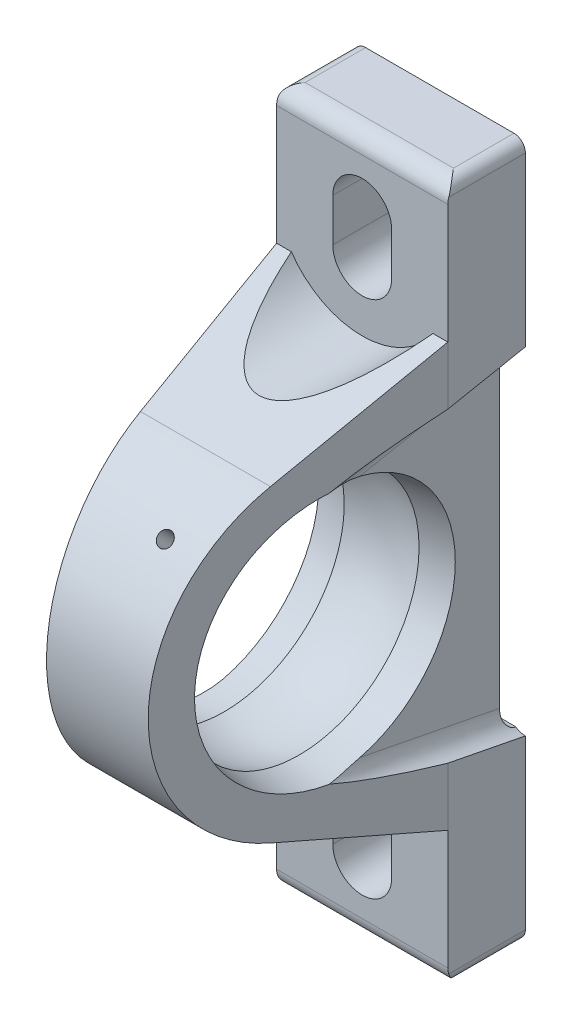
ISO-10303-21;
HEADER;
FILE_DESCRIPTION(('STEP AP214'),'2;1');
FILE_NAME('part.step','',(''),(''),'','','');
FILE_SCHEMA(('AUTOMOTIVE_DESIGN { 1 0 10303 214 1 1 1 1 }'));
ENDSEC;
DATA;
#1=APPLICATION_CONTEXT('core data for automotive mechanical design processes');
#2=APPLICATION_PROTOCOL_DEFINITION('international standard','automotive_design',2000,#1);
#3=PRODUCT_CONTEXT('',#1,'mechanical');
#4=PRODUCT('Part','Part','',(#3));
#5=PRODUCT_RELATED_PRODUCT_CATEGORY('part','',(#4));
#6=PRODUCT_DEFINITION_FORMATION('','',#4);
#7=PRODUCT_DEFINITION_CONTEXT('part definition',#1,'design');
#8=PRODUCT_DEFINITION('design','',#6,#7);
#9=PRODUCT_DEFINITION_SHAPE('','',#8);
#10=(LENGTH_UNIT() NAMED_UNIT(*) SI_UNIT(.MILLI.,.METRE.));
#11=(NAMED_UNIT(*) PLANE_ANGLE_UNIT() SI_UNIT($,.RADIAN.));
#12=(NAMED_UNIT(*) SI_UNIT($,.STERADIAN.) SOLID_ANGLE_UNIT());
#13=UNCERTAINTY_MEASURE_WITH_UNIT(LENGTH_MEASURE(1.E-05),#10,'distance_accuracy_value','');
#14=(GEOMETRIC_REPRESENTATION_CONTEXT(3) GLOBAL_UNCERTAINTY_ASSIGNED_CONTEXT((#13)) GLOBAL_UNIT_ASSIGNED_CONTEXT((#10,
#11,#12)) REPRESENTATION_CONTEXT('',''));
#15=CARTESIAN_POINT('',(0.,0.,0.));
#16=DIRECTION('',(0.,0.,1.));
#17=DIRECTION('',(1.,0.,0.));
#18=AXIS2_PLACEMENT_3D('',#15,#16,#17);
#19=CARTESIAN_POINT('',(-16.,81.7999999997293,-1.70708343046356E-10));
#20=DIRECTION('',(-1.,0.,0.));
#21=DIRECTION('',(0.,1.,0.));
#22=AXIS2_PLACEMENT_3D('',#19,#20,#21);
#23=CIRCLE('',#22,1.60000000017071);
#24=DIRECTION('',(1.,0.,0.));
#25=VECTOR('',#24,1.);
#26=SURFACE_OF_LINEAR_EXTRUSION('',#23,#25);
#27=CARTESIAN_POINT('',(-13.0737873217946,81.8,1.6));
#28=CARTESIAN_POINT('',(-13.0980271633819,81.8511252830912,1.59999911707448));
#29=CARTESIAN_POINT('',(-13.1233830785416,81.901684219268,1.59755033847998));
#30=CARTESIAN_POINT('',(-13.1759626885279,82.0013114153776,1.58807262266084));
#31=CARTESIAN_POINT('',(-13.2031841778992,82.0503813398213,1.58104901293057));
#32=CARTESIAN_POINT('',(-13.2590507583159,82.1465556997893,1.56278085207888));
#33=CARTESIAN_POINT('',(-13.2876881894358,82.1936686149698,1.55155723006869));
#34=CARTESIAN_POINT('',(-13.3461755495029,82.2859979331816,1.52515965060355));
#35=CARTESIAN_POINT('',(-13.3760258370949,82.3312137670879,1.50998451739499));
#36=CARTESIAN_POINT('',(-13.466593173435,82.4633488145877,1.45905944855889));
#37=CARTESIAN_POINT('',(-13.528645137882,82.547294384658,1.41780251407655));
#38=CARTESIAN_POINT('',(-13.6535423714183,82.706566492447,1.32167632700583));
#39=CARTESIAN_POINT('',(-13.7163889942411,82.7818752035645,1.26677963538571));
#40=CARTESIAN_POINT('',(-13.8292110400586,82.9117027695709,1.15337873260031));
#41=CARTESIAN_POINT('',(-13.8796164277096,82.9676103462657,1.09691620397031));
#42=CARTESIAN_POINT('',(-13.9511639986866,83.0459942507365,1.00454997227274));
#43=CARTESIAN_POINT('',(-13.9743252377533,83.0711974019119,0.972501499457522));
#44=CARTESIAN_POINT('',(-14.0187011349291,83.1196288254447,0.905694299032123));
#45=CARTESIAN_POINT('',(-14.0399167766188,83.1428580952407,0.870936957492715));
#46=CARTESIAN_POINT('',(-14.0853054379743,83.1933920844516,0.78830373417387));
#47=CARTESIAN_POINT('',(-14.1086144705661,83.2199879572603,0.739500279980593));
#48=CARTESIAN_POINT('',(-14.1487030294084,83.26870423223,0.63725587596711));
#49=CARTESIAN_POINT('',(-14.1654993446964,83.2908360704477,0.583827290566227));
#50=CARTESIAN_POINT('',(-14.1885164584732,83.3267315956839,0.481236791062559));
#51=CARTESIAN_POINT('',(-14.1959350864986,83.3412491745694,0.432614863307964));
#52=CARTESIAN_POINT('',(-14.2034512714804,83.3656625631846,0.333609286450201));
#53=CARTESIAN_POINT('',(-14.2035459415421,83.3755565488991,0.283224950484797));
#54=CARTESIAN_POINT('',(-14.1972009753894,83.3887284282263,0.19367089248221));
#55=CARTESIAN_POINT('',(-14.1922260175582,83.3929938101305,0.154527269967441));
#56=CARTESIAN_POINT('',(-14.1783340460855,83.398637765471,0.0767471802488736));
#57=CARTESIAN_POINT('',(-14.1694190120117,83.4000177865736,0.0381104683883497));
#58=CARTESIAN_POINT('',(-14.1587644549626,83.3999999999,0.));
#59=B_SPLINE_CURVE_WITH_KNOTS('',3,(#27,#28,#29,#30,#31,#32,#33,#34,#35,#36,#37,#38,#39,#40,#41,
#42,#43,#44,#45,#46,#47,#48,#49,#50,#51,#52,#53,#54,#55,#56,#57,#58),.UNSPECIFIED.,.F.,.F.,(4,2,
2,2,2,2,2,2,2,2,2,2,2,2,2,4),(0.,0.169626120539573,0.339055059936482,0.507650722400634,
0.676296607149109,1.01170404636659,1.34779176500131,1.62917370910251,1.76971581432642,
1.91018647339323,2.09043802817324,2.27022177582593,2.42337957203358,2.57659773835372,
2.69535946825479,2.81406159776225),.UNSPECIFIED.);
#60=CARTESIAN_POINT('',(-13.0737873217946,81.8,1.6));
#61=VERTEX_POINT('',#60);
#62=CARTESIAN_POINT('',(-14.1587644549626,83.3999999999,0.));
#63=VERTEX_POINT('',#62);
#64=EDGE_CURVE('E10',#61,#63,#59,.T.);
#65=ORIENTED_EDGE('',*,*,#64,.T.);
#66=DIRECTION('',(1.,0.,0.));
#67=VECTOR('',#66,1.);
#68=CARTESIAN_POINT('',(-16.,83.3999999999,0.));
#69=LINE('',#68,#67);
#70=CARTESIAN_POINT('',(14.1587644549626,83.3999999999,0.));
#71=VERTEX_POINT('',#70);
#72=EDGE_CURVE('E33',#63,#71,#69,.T.);
#73=ORIENTED_EDGE('',*,*,#72,.T.);
#74=CARTESIAN_POINT('',(14.1587644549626,83.3999999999,0.));
#75=CARTESIAN_POINT('',(14.1664438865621,83.4000048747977,0.0275331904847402));
#76=CARTESIAN_POINT('',(14.1732330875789,83.3992894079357,0.0553311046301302));
#77=CARTESIAN_POINT('',(14.184834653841,83.3963702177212,0.111280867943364));
#78=CARTESIAN_POINT('',(14.1896453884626,83.3941652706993,0.139432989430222));
#79=CARTESIAN_POINT('',(14.1970488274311,83.388244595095,0.195630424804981));
#80=CARTESIAN_POINT('',(14.1996599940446,83.384541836,0.223674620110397));
#81=CARTESIAN_POINT('',(14.2026216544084,83.3756294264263,0.279632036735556));
#82=CARTESIAN_POINT('',(14.2029730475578,83.3704203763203,0.307545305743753));
#83=CARTESIAN_POINT('',(14.2013963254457,83.3585109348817,0.36311769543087));
#84=CARTESIAN_POINT('',(14.1994580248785,83.3518039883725,0.390775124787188));
#85=CARTESIAN_POINT('',(14.1933743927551,83.3369966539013,0.445472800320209));
#86=CARTESIAN_POINT('',(14.1892280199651,83.3288956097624,0.472512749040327));
#87=CARTESIAN_POINT('',(14.1737102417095,83.302655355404,0.552414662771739));
#88=CARTESIAN_POINT('',(14.1592599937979,83.2825779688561,0.604063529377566));
#89=CARTESIAN_POINT('',(14.1181936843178,83.230856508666,0.719657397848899));
#90=CARTESIAN_POINT('',(14.0891281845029,83.1975875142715,0.781964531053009));
#91=CARTESIAN_POINT('',(14.0240080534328,83.12521321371,0.899212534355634));
#92=CARTESIAN_POINT('',(13.9879289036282,83.0860875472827,0.954126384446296));
#93=CARTESIAN_POINT('',(13.9200458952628,83.011967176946,1.04585613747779));
#94=CARTESIAN_POINT('',(13.889004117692,82.9779081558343,1.08401802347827));
#95=CARTESIAN_POINT('',(13.825432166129,82.9069996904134,1.15633822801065));
#96=CARTESIAN_POINT('',(13.7929012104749,82.8701487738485,1.19049440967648));
#97=CARTESIAN_POINT('',(13.7270811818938,82.7937805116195,1.25494949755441));
#98=CARTESIAN_POINT('',(13.6937915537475,82.7542611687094,1.28524546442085));
#99=CARTESIAN_POINT('',(13.6270486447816,82.6726675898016,1.34198336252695));
#100=CARTESIAN_POINT('',(13.5935953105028,82.6305924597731,1.36842393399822));
#101=CARTESIAN_POINT('',(13.4916515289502,82.4979390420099,1.44340873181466));
#102=CARTESIAN_POINT('',(13.4236585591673,82.4032782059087,1.48562818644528));
#103=CARTESIAN_POINT('',(13.2930117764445,82.2046437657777,1.5514911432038));
#104=CARTESIAN_POINT('',(13.2303376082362,82.1007091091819,1.57520860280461));
#105=CARTESIAN_POINT('',(13.1548517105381,81.9616214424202,1.59213590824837));
#106=CARTESIAN_POINT('',(13.138053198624,81.9296670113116,1.59506425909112));
#107=CARTESIAN_POINT('',(13.1052827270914,81.8652194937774,1.59899573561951));
#108=CARTESIAN_POINT('',(13.0893108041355,81.8327263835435,1.59999877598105));
#109=CARTESIAN_POINT('',(13.0737873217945,81.8000000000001,1.6));
#110=B_SPLINE_CURVE_WITH_KNOTS('',3,(#74,#75,#76,#77,#78,#79,#80,#81,#82,#83,#84,#85,#86,#87,
#88,#89,#90,#91,#92,#93,#94,#95,#96,#97,#98,#99,#100,#101,#102,#103,#104,#105,#106,#107,#108,
#109),.UNSPECIFIED.,.F.,.F.,(4,2,2,2,2,2,2,2,2,2,2,2,2,2,2,2,2,4),(0.,0.0857521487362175,
0.171574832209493,0.256669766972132,0.341730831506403,0.42717170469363,0.512652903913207,
0.683600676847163,0.911514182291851,1.14023924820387,1.31951453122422,1.49888501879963,
1.67839128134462,1.85796070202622,2.22811685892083,2.59678571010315,2.70539368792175,
2.81400647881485),.UNSPECIFIED.);
#111=CARTESIAN_POINT('',(13.0737873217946,81.8,1.6));
#112=VERTEX_POINT('',#111);
#113=EDGE_CURVE('E365',#71,#112,#110,.T.);
#114=ORIENTED_EDGE('',*,*,#113,.T.);
#115=DIRECTION('',(1.,0.,0.));
#116=VECTOR('',#115,1.);
#117=CARTESIAN_POINT('',(-16.,81.8,1.6));
#118=LINE('',#117,#116);
#119=EDGE_CURVE('E1161',#61,#112,#118,.T.);
#120=ORIENTED_EDGE('',*,*,#119,.F.);
#121=EDGE_LOOP('',(#65,#73,#114,#120));
#122=FACE_BOUND('',#121,.T.);
#123=ADVANCED_FACE('F16',(#122),#26,.T.);
#124=CARTESIAN_POINT('',(-16.,12.9871019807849,14.5));
#125=DIRECTION('',(0.,-0.939692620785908,0.342020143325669));
#126=DIRECTION('',(0.,-0.342020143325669,-0.939692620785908));
#127=AXIS2_PLACEMENT_3D('',#124,#125,#126);
#128=PLANE('',#127);
#129=CARTESIAN_POINT('',(0.,20.,33.7677789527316));
#130=CARTESIAN_POINT('',(16.,20.,33.7677789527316));
#131=CARTESIAN_POINT('',(16.,4.,-10.1918597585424));
#132=CARTESIAN_POINT('',(16.,-12.,-54.1514984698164));
#133=CARTESIAN_POINT('',(0.,-12.,-54.1514984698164));
#134=CARTESIAN_POINT('',(-16.,-12.,-54.1514984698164));
#135=CARTESIAN_POINT('',(-16.,4.,-10.1918597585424));
#136=CARTESIAN_POINT('',(-16.,20.,33.7677789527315));
#137=CARTESIAN_POINT('',(0.,20.,33.7677789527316));
#138=(BOUNDED_CURVE() B_SPLINE_CURVE(2,(#129,#130,#131,#132,#133,#134,#135,#136,#137),
.UNSPECIFIED.,.T.,.F.) B_SPLINE_CURVE_WITH_KNOTS((3,2,2,2,3),(0.,1.5707963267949,
3.14159265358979,4.71238898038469,6.28318530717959),
.UNSPECIFIED.) CURVE() GEOMETRIC_REPRESENTATION_ITEM() RATIONAL_B_SPLINE_CURVE((1.,
0.707106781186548,1.,0.707106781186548,1.,0.707106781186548,1.,0.707106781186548,1.)) REPRESENTATION_ITEM(''));
#139=CARTESIAN_POINT('',(-13.2375223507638,12.9871019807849,14.5));
#140=VERTEX_POINT('',#139);
#141=CARTESIAN_POINT('',(13.2375223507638,12.9871019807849,14.5));
#142=VERTEX_POINT('',#141);
#143=EDGE_CURVE('E339',#140,#142,#138,.T.);
#144=ORIENTED_EDGE('',*,*,#143,.T.);
#145=DIRECTION('',(1.,0.,0.));
#146=VECTOR('',#145,1.);
#147=CARTESIAN_POINT('',(-16.,12.9871019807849,14.5));
#148=LINE('',#147,#146);
#149=CARTESIAN_POINT('',(16.,12.9871019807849,14.5));
#150=VERTEX_POINT('',#149);
#151=EDGE_CURVE('E336',#142,#150,#148,.T.);
#152=ORIENTED_EDGE('',*,*,#151,.T.);
#153=DIRECTION('',(-0.122465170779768,0.339445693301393,0.932619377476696));
#154=VECTOR('',#153,1.);
#155=CARTESIAN_POINT('',(13.0956533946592,21.0372924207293,36.6177164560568));
#156=LINE('',#155,#154);
#157=CARTESIAN_POINT('',(12.1525228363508,23.6514365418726,43.800018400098));
#158=VERTEX_POINT('',#157);
#159=EDGE_CURVE('E321',#150,#158,#156,.T.);
#160=ORIENTED_EDGE('',*,*,#159,.T.);
#161=DIRECTION('',(1.,0.,0.));
#162=VECTOR('',#161,1.);
#163=CARTESIAN_POINT('',(-16.,23.6514365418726,43.800018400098));
#164=LINE('',#163,#162);
#165=CARTESIAN_POINT('',(-12.1525228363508,23.6514365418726,43.800018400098));
#166=VERTEX_POINT('',#165);
#167=EDGE_CURVE('E580',#166,#158,#164,.T.);
#168=ORIENTED_EDGE('',*,*,#167,.F.);
#169=DIRECTION('',(-0.122465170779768,-0.339445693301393,-0.932619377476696));
#170=VECTOR('',#169,1.);
#171=CARTESIAN_POINT('',(-13.3356168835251,20.3721680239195,34.7903021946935));
#172=LINE('',#171,#170);
#173=CARTESIAN_POINT('',(-16.,12.9871019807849,14.5));
#174=VERTEX_POINT('',#173);
#175=EDGE_CURVE('E318',#166,#174,#172,.T.);
#176=ORIENTED_EDGE('',*,*,#175,.T.);
#177=DIRECTION('',(1.,0.,0.));
#178=VECTOR('',#177,1.);
#179=CARTESIAN_POINT('',(-16.,12.9871019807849,14.5));
#180=LINE('',#179,#178);
#181=EDGE_CURVE('E322',#174,#140,#180,.T.);
#182=ORIENTED_EDGE('',*,*,#181,.T.);
#183=EDGE_LOOP('',(#144,#152,#160,#168,#176,#182));
#184=FACE_BOUND('',#183,.T.);
#185=ADVANCED_FACE('F355',(#184),#128,.T.);
#186=CARTESIAN_POINT('',(-16.,-12.5,0.));
#187=DIRECTION('',(0.,-1.,0.));
#188=DIRECTION('',(1.,0.,0.));
#189=AXIS2_PLACEMENT_3D('',#186,#187,#188);
#190=PLANE('',#189);
#191=DIRECTION('',(0.,0.,-1.));
#192=VECTOR('',#191,1.);
#193=CARTESIAN_POINT('',(-13.86666667,-12.5,5.65));
#194=LINE('',#193,#192);
#195=CARTESIAN_POINT('',(-13.86666667,-12.5,11.3));
#196=VERTEX_POINT('',#195);
#197=CARTESIAN_POINT('',(-13.86666667,-12.5,0.));
#198=VERTEX_POINT('',#197);
#199=EDGE_CURVE('E335',#196,#198,#194,.T.);
#200=ORIENTED_EDGE('',*,*,#199,.T.);
#201=DIRECTION('',(1.,0.,0.));
#202=VECTOR('',#201,1.);
#203=CARTESIAN_POINT('',(-16.,-12.5,0.));
#204=LINE('',#203,#202);
#205=CARTESIAN_POINT('',(13.86666667,-12.5,0.));
#206=VERTEX_POINT('',#205);
#207=EDGE_CURVE('E311',#198,#206,#204,.T.);
#208=ORIENTED_EDGE('',*,*,#207,.T.);
#209=DIRECTION('',(0.,0.,-1.));
#210=VECTOR('',#209,1.);
#211=CARTESIAN_POINT('',(13.86666667,-12.5,5.65));
#212=LINE('',#211,#210);
#213=CARTESIAN_POINT('',(13.86666667,-12.5,11.3));
#214=VERTEX_POINT('',#213);
#215=EDGE_CURVE('E735',#214,#206,#212,.T.);
#216=ORIENTED_EDGE('',*,*,#215,.F.);
#217=DIRECTION('',(1.,0.,0.));
#218=VECTOR('',#217,1.);
#219=CARTESIAN_POINT('',(-16.,-12.5,11.3));
#220=LINE('',#219,#218);
#221=EDGE_CURVE('E728',#196,#214,#220,.T.);
#222=ORIENTED_EDGE('',*,*,#221,.F.);
#223=EDGE_LOOP('',(#200,#208,#216,#222));
#224=FACE_BOUND('',#223,.T.);
#225=ADVANCED_FACE('F1022',(#224),#190,.T.);
#226=CARTESIAN_POINT('',(-16.,21.6,0.));
#227=DIRECTION('',(0.,0.,-1.));
#228=DIRECTION('',(-1.,0.,0.));
#229=AXIS2_PLACEMENT_3D('',#226,#227,#228);
#230=PLANE('',#229);
#231=CARTESIAN_POINT('',(16.,27.6399069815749,0.));
#232=CARTESIAN_POINT('',(12.75,27.6399069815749,0.));
#233=CARTESIAN_POINT('',(12.75,24.3286241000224,0.));
#234=CARTESIAN_POINT('',(12.75,21.0173412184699,0.));
#235=CARTESIAN_POINT('',(16.,21.0173412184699,0.));
#236=CARTESIAN_POINT('',(19.25,21.0173412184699,0.));
#237=CARTESIAN_POINT('',(19.25,24.3286241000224,0.));
#238=CARTESIAN_POINT('',(19.25,27.6399069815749,0.));
#239=CARTESIAN_POINT('',(16.,27.6399069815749,0.));
#240=(BOUNDED_CURVE() B_SPLINE_CURVE(2,(#231,#232,#233,#234,#235,#236,#237,#238,#239),
.UNSPECIFIED.,.T.,.F.) B_SPLINE_CURVE_WITH_KNOTS((3,2,2,2,3),(0.,1.5707963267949,
3.14159265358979,4.71238898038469,6.28318530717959),
.UNSPECIFIED.) CURVE() GEOMETRIC_REPRESENTATION_ITEM() RATIONAL_B_SPLINE_CURVE((1.,
0.707106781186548,1.,0.707106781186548,1.,0.707106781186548,1.,0.707106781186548,1.)) REPRESENTATION_ITEM(''));
#241=CARTESIAN_POINT('',(14.1587644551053,21.6,0.));
#242=VERTEX_POINT('',#241);
#243=CARTESIAN_POINT('',(16.,21.0173412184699,0.));
#244=VERTEX_POINT('',#243);
#245=EDGE_CURVE('E663',#242,#244,#240,.T.);
#246=ORIENTED_EDGE('',*,*,#245,.T.);
#247=DIRECTION('',(0.,-1.,0.));
#248=VECTOR('',#247,1.);
#249=CARTESIAN_POINT('',(16.,21.6,0.));
#250=LINE('',#249,#248);
#251=CARTESIAN_POINT('',(16.,-10.36666667,0.));
#252=VERTEX_POINT('',#251);
#253=EDGE_CURVE('E546',#244,#252,#250,.T.);
#254=ORIENTED_EDGE('',*,*,#253,.T.);
#255=CARTESIAN_POINT('',(13.86666667,-10.36666667,0.));
#256=DIRECTION('',(0.,0.,-1.));
#257=DIRECTION('',(-1.,0.,0.));
#258=AXIS2_PLACEMENT_3D('',#255,#256,#257);
#259=CIRCLE('',#258,2.13333333);
#260=EDGE_CURVE('E543',#252,#206,#259,.T.);
#261=ORIENTED_EDGE('',*,*,#260,.T.);
#262=ORIENTED_EDGE('',*,*,#207,.F.);
#263=CARTESIAN_POINT('',(-13.86666667,-10.36666667,0.));
#264=DIRECTION('',(0.,0.,-1.));
#265=DIRECTION('',(0.,1.,0.));
#266=AXIS2_PLACEMENT_3D('',#263,#264,#265);
#267=CIRCLE('',#266,2.13333333);
#268=CARTESIAN_POINT('',(-16.,-10.36666667,0.));
#269=VERTEX_POINT('',#268);
#270=EDGE_CURVE('E547',#198,#269,#267,.T.);
#271=ORIENTED_EDGE('',*,*,#270,.T.);
#272=DIRECTION('',(0.,-1.,0.));
#273=VECTOR('',#272,1.);
#274=CARTESIAN_POINT('',(-16.,21.6,0.));
#275=LINE('',#274,#273);
#276=CARTESIAN_POINT('',(-16.,21.0173412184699,0.));
#277=VERTEX_POINT('',#276);
#278=EDGE_CURVE('E565',#277,#269,#275,.T.);
#279=ORIENTED_EDGE('',*,*,#278,.F.);
#280=CARTESIAN_POINT('',(-16.,21.0173412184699,0.));
#281=CARTESIAN_POINT('',(-12.75,21.0173412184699,0.));
#282=CARTESIAN_POINT('',(-12.75,24.3286241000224,0.));
#283=CARTESIAN_POINT('',(-12.75,27.6399069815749,0.));
#284=CARTESIAN_POINT('',(-16.,27.6399069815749,0.));
#285=CARTESIAN_POINT('',(-19.25,27.6399069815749,0.));
#286=CARTESIAN_POINT('',(-19.25,24.3286241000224,0.));
#287=CARTESIAN_POINT('',(-19.25,21.0173412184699,0.));
#288=CARTESIAN_POINT('',(-16.,21.0173412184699,0.));
#289=(BOUNDED_CURVE() B_SPLINE_CURVE(2,(#280,#281,#282,#283,#284,#285,#286,#287,#288),
.UNSPECIFIED.,.T.,.F.) B_SPLINE_CURVE_WITH_KNOTS((3,2,2,2,3),(0.,1.5707963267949,
3.14159265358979,4.71238898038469,6.28318530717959),
.UNSPECIFIED.) CURVE() GEOMETRIC_REPRESENTATION_ITEM() RATIONAL_B_SPLINE_CURVE((1.,
0.707106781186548,1.,0.707106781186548,1.,0.707106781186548,1.,0.707106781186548,1.)) REPRESENTATION_ITEM(''));
#290=CARTESIAN_POINT('',(-14.1587644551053,21.6,0.));
#291=VERTEX_POINT('',#290);
#292=EDGE_CURVE('E631',#277,#291,#289,.T.);
#293=ORIENTED_EDGE('',*,*,#292,.T.);
#294=DIRECTION('',(1.,0.,0.));
#295=VECTOR('',#294,1.);
#296=CARTESIAN_POINT('',(-16.,21.6,0.));
#297=LINE('',#296,#295);
#298=EDGE_CURVE('E520',#291,#242,#297,.T.);
#299=ORIENTED_EDGE('',*,*,#298,.T.);
#300=EDGE_LOOP('',(#246,#254,#261,#262,#271,#279,#293,#299));
#301=FACE_BOUND('',#300,.T.);
#302=CARTESIAN_POINT('',(0.,8.,0.));
#303=DIRECTION('',(0.,0.,1.));
#304=DIRECTION('',(0.,1.,0.));
#305=AXIS2_PLACEMENT_3D('',#302,#303,#304);
#306=CIRCLE('',#305,5.5);
#307=CARTESIAN_POINT('',(5.5,8.,0.));
#308=VERTEX_POINT('',#307);
#309=CARTESIAN_POINT('',(-5.5,8.,0.));
#310=VERTEX_POINT('',#309);
#311=EDGE_CURVE('E518',#308,#310,#306,.T.);
#312=ORIENTED_EDGE('',*,*,#311,.T.);
#313=DIRECTION('',(0.,-1.,0.));
#314=VECTOR('',#313,1.);
#315=CARTESIAN_POINT('',(-5.5,10.8,0.));
#316=LINE('',#315,#314);
#317=CARTESIAN_POINT('',(-5.5,0.,0.));
#318=VERTEX_POINT('',#317);
#319=EDGE_CURVE('E521',#310,#318,#316,.T.);
#320=ORIENTED_EDGE('',*,*,#319,.T.);
#321=CARTESIAN_POINT('',(0.,0.,0.));
#322=DIRECTION('',(0.,0.,1.));
#323=DIRECTION('',(0.,1.,0.));
#324=AXIS2_PLACEMENT_3D('',#321,#322,#323);
#325=CIRCLE('',#324,5.5);
#326=CARTESIAN_POINT('',(5.5,0.,0.));
#327=VERTEX_POINT('',#326);
#328=EDGE_CURVE('E567',#318,#327,#325,.T.);
#329=ORIENTED_EDGE('',*,*,#328,.T.);
#330=DIRECTION('',(0.,1.,0.));
#331=VECTOR('',#330,1.);
#332=CARTESIAN_POINT('',(5.5,14.8,0.));
#333=LINE('',#332,#331);
#334=EDGE_CURVE('E224',#327,#308,#333,.T.);
#335=ORIENTED_EDGE('',*,*,#334,.T.);
#336=EDGE_LOOP('',(#312,#320,#329,#335));
#337=FACE_BOUND('',#336,.T.);
#338=ADVANCED_FACE('F918',(#301,#337),#230,.T.);
#339=CARTESIAN_POINT('',(-16.,23.2000000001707,-2.70707678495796E-10));
#340=DIRECTION('',(-1.,0.,0.));
#341=DIRECTION('',(0.,1.,0.));
#342=AXIS2_PLACEMENT_3D('',#339,#340,#341);
#343=CIRCLE('',#342,1.60000000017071);
#344=DIRECTION('',(1.,0.,0.));
#345=VECTOR('',#344,1.);
#346=SURFACE_OF_LINEAR_EXTRUSION('',#343,#345);
#347=CARTESIAN_POINT('',(13.0737873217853,23.2,1.5999999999));
#348=CARTESIAN_POINT('',(13.0980271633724,23.1488747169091,1.59999911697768));
#349=CARTESIAN_POINT('',(13.1233830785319,23.0983157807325,1.59755033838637));
#350=CARTESIAN_POINT('',(13.175962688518,22.9986885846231,1.58807262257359));
#351=CARTESIAN_POINT('',(13.2031841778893,22.9496186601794,1.58104901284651));
#352=CARTESIAN_POINT('',(13.259050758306,22.8534443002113,1.56278085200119));
#353=CARTESIAN_POINT('',(13.287688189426,22.8063313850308,1.5515572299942));
#354=CARTESIAN_POINT('',(13.3461755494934,22.7140020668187,1.5251596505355));
#355=CARTESIAN_POINT('',(13.3760258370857,22.6687862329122,1.50998451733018));
#356=CARTESIAN_POINT('',(13.466593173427,22.5366511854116,1.45905944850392));
#357=CARTESIAN_POINT('',(13.5286451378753,22.4527056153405,1.41780251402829));
#358=CARTESIAN_POINT('',(13.6535423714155,22.2934335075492,1.32167632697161));
#359=CARTESIAN_POINT('',(13.716388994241,22.2181247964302,1.26677963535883));
#360=CARTESIAN_POINT('',(13.8292110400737,22.0882972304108,1.15337873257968));
#361=CARTESIAN_POINT('',(13.8796164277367,22.0323896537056,1.09691620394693));
#362=CARTESIAN_POINT('',(13.9511639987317,21.9540057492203,1.00454997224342));
#363=CARTESIAN_POINT('',(13.9743252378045,21.9288025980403,0.972501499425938));
#364=CARTESIAN_POINT('',(14.0187011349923,21.8803711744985,0.905694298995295));
#365=CARTESIAN_POINT('',(14.039916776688,21.8571419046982,0.870936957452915));
#366=CARTESIAN_POINT('',(14.0853054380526,21.8066079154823,0.788303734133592));
#367=CARTESIAN_POINT('',(14.1086144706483,21.7800120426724,0.739500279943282));
#368=CARTESIAN_POINT('',(14.1487030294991,21.7312957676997,0.63725587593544));
#369=CARTESIAN_POINT('',(14.1654993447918,21.7091639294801,0.583827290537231));
#370=CARTESIAN_POINT('',(14.1885164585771,21.6732684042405,0.481236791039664));
#371=CARTESIAN_POINT('',(14.1959350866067,21.6587508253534,0.432614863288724));
#372=CARTESIAN_POINT('',(14.203451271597,21.6343374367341,0.333609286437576));
#373=CARTESIAN_POINT('',(14.2035459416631,21.6244434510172,0.283224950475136));
#374=CARTESIAN_POINT('',(14.197200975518,21.6112715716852,0.193670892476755));
#375=CARTESIAN_POINT('',(14.19222601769,21.6070061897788,0.154527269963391));
#376=CARTESIAN_POINT('',(14.1783340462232,21.6013622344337,0.076747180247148));
#377=CARTESIAN_POINT('',(14.169419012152,21.5999822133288,0.0381104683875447));
#378=CARTESIAN_POINT('',(14.1587644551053,21.6,0.));
#379=B_SPLINE_CURVE_WITH_KNOTS('',3,(#347,#348,#349,#350,#351,#352,#353,#354,#355,#356,#357,
#358,#359,#360,#361,#362,#363,#364,#365,#366,#367,#368,#369,#370,#371,#372,#373,#374,#375,#376,
#377,#378),.UNSPECIFIED.,.F.,.F.,(4,2,2,2,2,2,2,2,2,2,2,2,2,2,2,4),(0.,0.169626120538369,
0.339055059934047,0.507650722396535,0.676296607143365,1.0117040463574,1.34779176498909,
1.62917370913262,1.76971581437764,1.91018647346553,2.09043802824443,2.27022177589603,
2.42337957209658,2.57659773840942,2.69535946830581,2.81406159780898),.UNSPECIFIED.);
#380=CARTESIAN_POINT('',(13.0737873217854,23.1999999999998,1.5999999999));
#381=VERTEX_POINT('',#380);
#382=EDGE_CURVE('E372',#381,#242,#379,.T.);
#383=ORIENTED_EDGE('',*,*,#382,.T.);
#384=ORIENTED_EDGE('',*,*,#298,.F.);
#385=CARTESIAN_POINT('',(-14.1587644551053,21.6,0.));
#386=CARTESIAN_POINT('',(-14.1664438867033,21.599995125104,0.0275331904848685));
#387=CARTESIAN_POINT('',(-14.1732330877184,21.6007105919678,0.0553311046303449));
#388=CARTESIAN_POINT('',(-14.1848346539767,21.6036297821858,0.111280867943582));
#389=CARTESIAN_POINT('',(-14.1896453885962,21.6058347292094,0.139432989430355));
#390=CARTESIAN_POINT('',(-14.1970488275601,21.6117554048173,0.195630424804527));
#391=CARTESIAN_POINT('',(-14.1996599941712,21.615458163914,0.223674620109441));
#392=CARTESIAN_POINT('',(-14.2026216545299,21.624370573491,0.279632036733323));
#393=CARTESIAN_POINT('',(-14.2029730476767,21.6295796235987,0.307545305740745));
#394=CARTESIAN_POINT('',(-14.2013963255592,21.6414890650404,0.363117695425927));
#395=CARTESIAN_POINT('',(-14.1994580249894,21.6481960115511,0.390775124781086));
#396=CARTESIAN_POINT('',(-14.1933743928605,21.6630033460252,0.445472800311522));
#397=CARTESIAN_POINT('',(-14.1892280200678,21.6711043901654,0.472512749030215));
#398=CARTESIAN_POINT('',(-14.1737102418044,21.6973446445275,0.55241466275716));
#399=CARTESIAN_POINT('',(-14.1592599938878,21.7174220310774,0.604063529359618));
#400=CARTESIAN_POINT('',(-14.1181936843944,21.7691434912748,0.719657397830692));
#401=CARTESIAN_POINT('',(-14.0891281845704,21.8024124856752,0.78196453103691));
#402=CARTESIAN_POINT('',(-14.0240080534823,21.8747867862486,0.899212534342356));
#403=CARTESIAN_POINT('',(-13.9879289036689,21.913912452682,0.954126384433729));
#404=CARTESIAN_POINT('',(-13.9200458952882,21.9880328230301,1.04585613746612));
#405=CARTESIAN_POINT('',(-13.8890041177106,22.0220918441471,1.08401802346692));
#406=CARTESIAN_POINT('',(-13.8254321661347,22.0930003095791,1.15633822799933));
#407=CARTESIAN_POINT('',(-13.7929012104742,22.1298512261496,1.19049440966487));
#408=CARTESIAN_POINT('',(-13.7270811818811,22.2062194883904,1.25494949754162));
#409=CARTESIAN_POINT('',(-13.6937915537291,22.2457388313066,1.28524546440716));
#410=CARTESIAN_POINT('',(-13.6270486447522,22.3273324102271,1.34198336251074));
#411=CARTESIAN_POINT('',(-13.5935953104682,22.369407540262,1.3684239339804));
#412=CARTESIAN_POINT('',(-13.4916515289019,22.5020609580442,1.44340873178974));
#413=CARTESIAN_POINT('',(-13.4236585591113,22.5967217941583,1.48562818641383));
#414=CARTESIAN_POINT('',(-13.2930117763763,22.7953562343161,1.551491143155));
#415=CARTESIAN_POINT('',(-13.2303376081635,22.8992908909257,1.57520860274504));
#416=CARTESIAN_POINT('',(-13.1548517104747,23.0383785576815,1.59213590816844));
#417=CARTESIAN_POINT('',(-13.1380531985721,23.0703329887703,1.5950642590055));
#418=CARTESIAN_POINT('',(-13.1052827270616,23.1347805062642,1.59899573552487));
#419=CARTESIAN_POINT('',(-13.0893108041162,23.1672736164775,1.59999877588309));
#420=CARTESIAN_POINT('',(-13.0737873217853,23.1999999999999,1.5999999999));
#421=B_SPLINE_CURVE_WITH_KNOTS('',3,(#385,#386,#387,#388,#389,#390,#391,#392,#393,#394,#395,
#396,#397,#398,#399,#400,#401,#402,#403,#404,#405,#406,#407,#408,#409,#410,#411,#412,#413,#414,
#415,#416,#417,#418,#419,#420),.UNSPECIFIED.,.F.,.F.,(4,2,2,2,2,2,2,2,2,2,2,2,2,2,2,2,2,4),(0.,
0.0857521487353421,0.171574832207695,0.256669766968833,0.341730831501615,0.427171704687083,
0.512652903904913,0.683600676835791,0.911514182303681,1.14023924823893,1.31951453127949,
1.49888501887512,1.67839128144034,1.85796070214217,2.22811685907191,2.59678571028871,
2.70539368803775,2.81400647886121),.UNSPECIFIED.);
#422=CARTESIAN_POINT('',(-13.0737873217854,23.1999999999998,1.5999999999));
#423=VERTEX_POINT('',#422);
#424=EDGE_CURVE('E408',#291,#423,#421,.T.);
#425=ORIENTED_EDGE('',*,*,#424,.T.);
#426=DIRECTION('',(1.,0.,0.));
#427=VECTOR('',#426,1.);
#428=CARTESIAN_POINT('',(-16.,23.2,1.5999999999));
#429=LINE('',#428,#427);
#430=EDGE_CURVE('E616',#423,#381,#429,.T.);
#431=ORIENTED_EDGE('',*,*,#430,.T.);
#432=EDGE_LOOP('',(#383,#384,#425,#431));
#433=FACE_BOUND('',#432,.T.);
#434=ADVANCED_FACE('F745',(#433),#346,.T.);
#435=CARTESIAN_POINT('',(-16.,52.5,33.3));
#436=DIRECTION('',(1.,0.,0.));
#437=DIRECTION('',(0.,0.,-1.));
#438=AXIS2_PLACEMENT_3D('',#435,#436,#437);
#439=CYLINDRICAL_SURFACE('',#438,30.7);
#440=CARTESIAN_POINT('',(-9.49999999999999,52.5,64.));
#441=CARTESIAN_POINT('',(-9.5,21.8,64.));
#442=CARTESIAN_POINT('',(-13.5313131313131,21.8,33.3));
#443=CARTESIAN_POINT('',(-17.5626262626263,21.8,2.59999999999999));
#444=CARTESIAN_POINT('',(-17.5626262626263,52.5,2.59999999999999));
#445=CARTESIAN_POINT('',(-17.5626262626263,83.2,2.59999999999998));
#446=CARTESIAN_POINT('',(-13.5313131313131,83.2,33.3));
#447=CARTESIAN_POINT('',(-9.49999999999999,83.2,64.));
#448=CARTESIAN_POINT('',(-9.49999999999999,52.5,64.));
#449=(BOUNDED_CURVE() B_SPLINE_CURVE(2,(#440,#441,#442,#443,#444,#445,#446,#447,#448),
.UNSPECIFIED.,.T.,.F.) B_SPLINE_CURVE_WITH_KNOTS((3,2,2,2,3),(0.,1.5707963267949,
3.14159265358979,4.71238898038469,6.28318530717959),
.UNSPECIFIED.) CURVE() GEOMETRIC_REPRESENTATION_ITEM() RATIONAL_B_SPLINE_CURVE((1.,
0.707106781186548,1.,0.707106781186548,1.,0.707106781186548,1.,0.707106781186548,1.)) REPRESENTATION_ITEM(''));
#450=CARTESIAN_POINT('',(-12.1525228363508,81.3485634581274,43.800018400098));
#451=VERTEX_POINT('',#450);
#452=EDGE_CURVE('E583',#451,#166,#449,.T.);
#453=ORIENTED_EDGE('',*,*,#452,.T.);
#454=ORIENTED_EDGE('',*,*,#167,.T.);
#455=CARTESIAN_POINT('',(9.49999999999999,52.5,64.));
#456=CARTESIAN_POINT('',(9.49999999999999,83.2,64.));
#457=CARTESIAN_POINT('',(13.5313131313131,83.2,33.3));
#458=CARTESIAN_POINT('',(17.5626262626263,83.2,2.59999999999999));
#459=CARTESIAN_POINT('',(17.5626262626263,52.5,2.59999999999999));
#460=CARTESIAN_POINT('',(17.5626262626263,21.8,2.59999999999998));
#461=CARTESIAN_POINT('',(13.5313131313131,21.8,33.3));
#462=CARTESIAN_POINT('',(9.49999999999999,21.8,64.));
#463=CARTESIAN_POINT('',(9.49999999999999,52.5,64.));
#464=(BOUNDED_CURVE() B_SPLINE_CURVE(2,(#455,#456,#457,#458,#459,#460,#461,#462,#463),
.UNSPECIFIED.,.T.,.F.) B_SPLINE_CURVE_WITH_KNOTS((3,2,2,2,3),(0.,1.5707963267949,
3.14159265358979,4.71238898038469,6.28318530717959),
.UNSPECIFIED.) CURVE() GEOMETRIC_REPRESENTATION_ITEM() RATIONAL_B_SPLINE_CURVE((1.,
0.707106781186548,1.,0.707106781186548,1.,0.707106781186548,1.,0.707106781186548,1.)) REPRESENTATION_ITEM(''));
#465=CARTESIAN_POINT('',(12.1525228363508,81.3485634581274,43.800018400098));
#466=VERTEX_POINT('',#465);
#467=EDGE_CURVE('E584',#158,#466,#464,.T.);
#468=ORIENTED_EDGE('',*,*,#467,.T.);
#469=DIRECTION('',(1.,0.,0.));
#470=VECTOR('',#469,1.);
#471=CARTESIAN_POINT('',(-16.,81.3485634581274,43.800018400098));
#472=LINE('',#471,#470);
#473=EDGE_CURVE('E328',#451,#466,#472,.T.);
#474=ORIENTED_EDGE('',*,*,#473,.F.);
#475=EDGE_LOOP('',(#453,#454,#468,#474));
#476=FACE_BOUND('',#475,.T.);
#477=CARTESIAN_POINT('',(5.075,74.208178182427,55.008178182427));
#478=CARTESIAN_POINT('',(5.07499559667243,74.1536354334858,55.0627202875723));
#479=CARTESIAN_POINT('',(5.06847355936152,74.0987882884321,55.1171513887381));
#480=CARTESIAN_POINT('',(5.04906740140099,74.0174346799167,55.1972938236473));
#481=CARTESIAN_POINT('',(5.04097795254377,73.9904350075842,55.2237908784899));
#482=CARTESIAN_POINT('',(5.0216376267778,73.9368962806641,55.2761433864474));
#483=CARTESIAN_POINT('',(5.01038419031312,73.9103576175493,55.3019983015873));
#484=CARTESIAN_POINT('',(4.97203396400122,73.831862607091,55.3782003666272));
#485=CARTESIAN_POINT('',(4.94031536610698,73.7808943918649,55.4273155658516));
#486=CARTESIAN_POINT('',(4.86544352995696,73.6832154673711,55.5208453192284));
#487=CARTESIAN_POINT('',(4.82228978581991,73.6365049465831,55.5652596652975));
#488=CARTESIAN_POINT('',(4.74994267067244,73.5707029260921,55.6274807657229));
#489=CARTESIAN_POINT('',(4.72452930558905,73.5494610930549,55.6475049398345));
#490=CARTESIAN_POINT('',(4.67136399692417,73.5085771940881,55.6859435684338));
#491=CARTESIAN_POINT('',(4.64361433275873,73.4889336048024,55.7043595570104));
#492=CARTESIAN_POINT('',(4.55708188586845,73.432590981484,55.7570541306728));
#493=CARTESIAN_POINT('',(4.49500009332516,73.3984659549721,55.7887926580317));
#494=CARTESIAN_POINT('',(4.36390090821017,73.3382396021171,55.8446106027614));
#495=CARTESIAN_POINT('',(4.29488086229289,73.3121413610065,55.8686870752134));
#496=CARTESIAN_POINT('',(4.15184863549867,73.2687878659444,55.9085895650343));
#497=CARTESIAN_POINT('',(4.0778365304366,73.25153247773,55.92441570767));
#498=CARTESIAN_POINT('',(3.92698265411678,73.2264331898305,55.9474117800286));
#499=CARTESIAN_POINT('',(3.85014282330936,73.2185829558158,55.954587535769));
#500=CARTESIAN_POINT('',(3.69576869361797,73.2125233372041,55.9601278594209));
#501=CARTESIAN_POINT('',(3.61823439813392,73.2143139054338,55.9584924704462));
#502=CARTESIAN_POINT('',(3.46472940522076,73.227475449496,55.9464531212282));
#503=CARTESIAN_POINT('',(3.38875761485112,73.2388394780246,55.9360555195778));
#504=CARTESIAN_POINT('',(3.24048377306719,73.2707673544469,55.906762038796));
#505=CARTESIAN_POINT('',(3.16818176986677,73.291331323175,55.8878660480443));
#506=CARTESIAN_POINT('',(3.02922915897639,73.3410382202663,55.8420110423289));
#507=CARTESIAN_POINT('',(2.96258083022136,73.370184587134,55.8150487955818));
#508=CARTESIAN_POINT('',(2.86838413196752,73.4195838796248,55.7691235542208));
#509=CARTESIAN_POINT('',(2.83794338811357,73.4370002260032,55.7528984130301));
#510=CARTESIAN_POINT('',(2.77913919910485,73.4736158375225,55.718699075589));
#511=CARTESIAN_POINT('',(2.75077778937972,73.4928168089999,55.7007232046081));
#512=CARTESIAN_POINT('',(2.66916013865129,73.5528675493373,55.6443454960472));
#513=CARTESIAN_POINT('',(2.61934323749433,73.5961794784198,55.6034802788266));
#514=CARTESIAN_POINT('',(2.53042476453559,73.6879845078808,55.5162847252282));
#515=CARTESIAN_POINT('',(2.49132275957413,73.736477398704,55.4699546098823));
#516=CARTESIAN_POINT('',(2.44151639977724,73.8119912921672,55.3972907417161));
#517=CARTESIAN_POINT('',(2.42637587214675,73.8376575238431,55.3725096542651));
#518=CARTESIAN_POINT('',(2.39916556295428,73.88970001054,55.3220809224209));
#519=CARTESIAN_POINT('',(2.3870932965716,73.9160756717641,55.2964339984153));
#520=CARTESIAN_POINT('',(2.35564363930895,73.9959349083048,55.2184915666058));
#521=CARTESIAN_POINT('',(2.34094543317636,74.0502844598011,55.165065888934));
#522=CARTESIAN_POINT('',(2.33016932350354,74.1220320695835,55.0939974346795));
#523=CARTESIAN_POINT('',(2.32823251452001,74.139258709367,55.0768931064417));
#524=CARTESIAN_POINT('',(2.32564715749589,74.1737199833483,55.0425953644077));
#525=CARTESIAN_POINT('',(2.32499860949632,74.1909546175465,55.0254019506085));
#526=CARTESIAN_POINT('',(2.32500440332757,74.2627202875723,54.9536354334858));
#527=CARTESIAN_POINT('',(2.33152644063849,74.317151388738,54.8987882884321));
#528=CARTESIAN_POINT('',(2.35093259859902,74.3972938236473,54.8174346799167));
#529=CARTESIAN_POINT('',(2.35902204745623,74.4237908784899,54.7904350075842));
#530=CARTESIAN_POINT('',(2.3783623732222,74.4761433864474,54.7368962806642));
#531=CARTESIAN_POINT('',(2.38961580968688,74.5019983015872,54.7103576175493));
#532=CARTESIAN_POINT('',(2.42796603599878,74.5782003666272,54.631862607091));
#533=CARTESIAN_POINT('',(2.45968463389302,74.6273155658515,54.580894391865));
#534=CARTESIAN_POINT('',(2.53455647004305,74.7208453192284,54.4832154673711));
#535=CARTESIAN_POINT('',(2.5777102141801,74.7652596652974,54.4365049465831));
#536=CARTESIAN_POINT('',(2.65005732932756,74.8274807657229,54.3707029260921));
#537=CARTESIAN_POINT('',(2.67547069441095,74.8475049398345,54.3494610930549));
#538=CARTESIAN_POINT('',(2.72863600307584,74.8859435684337,54.3085771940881));
#539=CARTESIAN_POINT('',(2.75638566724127,74.9043595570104,54.2889336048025));
#540=CARTESIAN_POINT('',(2.84291811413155,74.9570541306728,54.232590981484));
#541=CARTESIAN_POINT('',(2.90499990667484,74.9887926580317,54.1984659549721));
#542=CARTESIAN_POINT('',(3.03609909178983,75.0446106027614,54.1382396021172));
#543=CARTESIAN_POINT('',(3.10511913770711,75.0686870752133,54.1121413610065));
#544=CARTESIAN_POINT('',(3.24815136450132,75.1085895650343,54.0687878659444));
#545=CARTESIAN_POINT('',(3.32216346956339,75.12441570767,54.05153247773));
#546=CARTESIAN_POINT('',(3.47301734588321,75.1474117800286,54.0264331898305));
#547=CARTESIAN_POINT('',(3.54985717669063,75.154587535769,54.0185829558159));
#548=CARTESIAN_POINT('',(3.70423130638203,75.1601278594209,54.0125233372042));
#549=CARTESIAN_POINT('',(3.78176560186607,75.1584924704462,54.0143139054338));
#550=CARTESIAN_POINT('',(3.93527059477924,75.1464531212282,54.027475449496));
#551=CARTESIAN_POINT('',(4.01124238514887,75.1360555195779,54.0388394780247));
#552=CARTESIAN_POINT('',(4.1595162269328,75.106762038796,54.0707673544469));
#553=CARTESIAN_POINT('',(4.23181823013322,75.0878660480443,54.091331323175));
#554=CARTESIAN_POINT('',(4.37077084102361,75.0420110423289,54.1410382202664));
#555=CARTESIAN_POINT('',(4.43741916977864,75.0150487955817,54.170184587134));
#556=CARTESIAN_POINT('',(4.53161586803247,74.9691235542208,54.2195838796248));
#557=CARTESIAN_POINT('',(4.56205661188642,74.9528984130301,54.2370002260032));
#558=CARTESIAN_POINT('',(4.62086080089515,74.918699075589,54.2736158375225));
#559=CARTESIAN_POINT('',(4.64922221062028,74.9007232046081,54.292816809));
#560=CARTESIAN_POINT('',(4.73083986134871,74.8443454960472,54.3528675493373));
#561=CARTESIAN_POINT('',(4.78065676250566,74.8034802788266,54.3961794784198));
#562=CARTESIAN_POINT('',(4.8695752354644,74.7162847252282,54.4879845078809));
#563=CARTESIAN_POINT('',(4.90867724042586,74.6699546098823,54.536477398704));
#564=CARTESIAN_POINT('',(4.95848360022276,74.5972907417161,54.6119912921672));
#565=CARTESIAN_POINT('',(4.97362412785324,74.5725096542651,54.6376575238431));
#566=CARTESIAN_POINT('',(5.00083443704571,74.5220809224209,54.68970001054));
#567=CARTESIAN_POINT('',(5.01290670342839,74.4964339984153,54.7160756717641));
#568=CARTESIAN_POINT('',(5.04435636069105,74.4184915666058,54.7959349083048));
#569=CARTESIAN_POINT('',(5.05905456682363,74.365065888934,54.8502844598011));
#570=CARTESIAN_POINT('',(5.06983067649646,74.2939974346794,54.9220320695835));
#571=CARTESIAN_POINT('',(5.07176748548,74.2768931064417,54.939258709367));
#572=CARTESIAN_POINT('',(5.07435284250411,74.2425953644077,54.9737199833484));
#573=CARTESIAN_POINT('',(5.07500139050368,74.2254019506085,54.9909546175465));
#574=CARTESIAN_POINT('',(5.075,74.208178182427,55.008178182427));
#575=B_SPLINE_CURVE_WITH_KNOTS('',3,(#477,#478,#479,#480,#481,#482,#483,#484,#485,#486,#487,
#488,#489,#490,#491,#492,#493,#494,#495,#496,#497,#498,#499,#500,#501,#502,#503,#504,#505,#506,
#507,#508,#509,#510,#511,#512,#513,#514,#515,#516,#517,#518,#519,#520,#521,#522,#523,#524,#525,
#526,#527,#528,#529,#530,#531,#532,#533,#534,#535,#536,#537,#538,#539,#540,#541,#542,#543,#544,
#545,#546,#547,#548,#549,#550,#551,#552,#553,#554,#555,#556,#557,#558,#559,#560,#561,#562,#563,
#564,#565,#566,#567,#568,#569,#570,#571,#572,#573,#574),.UNSPECIFIED.,.T.,.F.,(4,2,2,2,2,2,2,2,
2,2,2,2,2,2,2,2,2,2,2,2,2,2,2,2,2,2,2,2,2,2,2,2,2,2,2,2,2,2,2,2,2,2,2,2,2,2,2,2,4),(0.,
0.231290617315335,0.347239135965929,0.463281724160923,0.694806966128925,0.926342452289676,
1.0423345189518,1.15821470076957,1.38990133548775,1.62167691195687,1.85344896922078,
2.08506484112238,2.3166795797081,2.54812638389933,2.77957622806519,3.01111892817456,
3.12692792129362,3.24284880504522,3.47459129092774,3.70632440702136,3.82247035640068,
3.93852194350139,4.17001665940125,4.2430547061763,4.31609275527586,4.54738337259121,
4.66333189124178,4.77937447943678,5.01089972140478,5.24243520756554,5.35842727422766,
5.47430745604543,5.70599409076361,5.93776966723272,6.16954172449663,6.40115759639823,
6.63277233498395,6.86421913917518,7.09566898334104,7.32721168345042,7.44302067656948,
7.55894156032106,7.79068404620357,8.0224171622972,8.13856311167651,8.25461469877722,
8.48610941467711,8.55914746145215,8.63218551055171),.UNSPECIFIED.);
#576=CARTESIAN_POINT('',(5.075,74.208178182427,55.008178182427));
#577=VERTEX_POINT('',#576);
#578=EDGE_CURVE('E589',#577,#577,#575,.T.);
#579=ORIENTED_EDGE('',*,*,#578,.T.);
#580=EDGE_LOOP('',(#579));
#581=FACE_BOUND('',#580,.T.);
#582=ADVANCED_FACE('F740',(#476,#581),#439,.T.);
#583=CARTESIAN_POINT('',(-16.,81.3485634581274,43.800018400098));
#584=DIRECTION('',(0.,0.939692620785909,0.342020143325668));
#585=DIRECTION('',(0.,-0.342020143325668,0.939692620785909));
#586=AXIS2_PLACEMENT_3D('',#583,#584,#585);
#587=PLANE('',#586);
#588=CARTESIAN_POINT('',(0.,85.,33.7677789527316));
#589=CARTESIAN_POINT('',(-16.,85.,33.7677789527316));
#590=CARTESIAN_POINT('',(-16.,101.,-10.1918597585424));
#591=CARTESIAN_POINT('',(-16.,117.,-54.1514984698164));
#592=CARTESIAN_POINT('',(0.,117.,-54.1514984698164));
#593=CARTESIAN_POINT('',(16.,117.,-54.1514984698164));
#594=CARTESIAN_POINT('',(16.,101.,-10.1918597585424));
#595=CARTESIAN_POINT('',(16.,85.,33.7677789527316));
#596=CARTESIAN_POINT('',(0.,85.,33.7677789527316));
#597=(BOUNDED_CURVE() B_SPLINE_CURVE(2,(#588,#589,#590,#591,#592,#593,#594,#595,#596),
.UNSPECIFIED.,.T.,.F.) B_SPLINE_CURVE_WITH_KNOTS((3,2,2,2,3),(0.,1.5707963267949,
3.14159265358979,4.71238898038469,6.28318530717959),
.UNSPECIFIED.) CURVE() GEOMETRIC_REPRESENTATION_ITEM() RATIONAL_B_SPLINE_CURVE((1.,
0.707106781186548,1.,0.707106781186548,1.,0.707106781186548,1.,0.707106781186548,1.)) REPRESENTATION_ITEM(''));
#598=CARTESIAN_POINT('',(13.2375223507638,92.0128980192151,14.5));
#599=VERTEX_POINT('',#598);
#600=CARTESIAN_POINT('',(-13.2375223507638,92.0128980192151,14.5));
#601=VERTEX_POINT('',#600);
#602=EDGE_CURVE('E576',#599,#601,#597,.T.);
#603=ORIENTED_EDGE('',*,*,#602,.T.);
#604=DIRECTION('',(1.,0.,0.));
#605=VECTOR('',#604,1.);
#606=CARTESIAN_POINT('',(-16.,92.0128980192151,14.5));
#607=LINE('',#606,#605);
#608=CARTESIAN_POINT('',(-16.,92.0128980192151,14.5));
#609=VERTEX_POINT('',#608);
#610=EDGE_CURVE('E562',#609,#601,#607,.T.);
#611=ORIENTED_EDGE('',*,*,#610,.F.);
#612=DIRECTION('',(0.122465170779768,-0.339445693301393,0.932619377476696));
#613=VECTOR('',#612,1.);
#614=CARTESIAN_POINT('',(-11.4407299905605,79.3756350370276,49.2205946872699));
#615=LINE('',#614,#613);
#616=EDGE_CURVE('E331',#609,#451,#615,.T.);
#617=ORIENTED_EDGE('',*,*,#616,.T.);
#618=ORIENTED_EDGE('',*,*,#473,.T.);
#619=DIRECTION('',(0.122465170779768,0.339445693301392,-0.932619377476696));
#620=VECTOR('',#619,1.);
#621=CARTESIAN_POINT('',(11.2007665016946,78.7105106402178,51.0480089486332));
#622=LINE('',#621,#620);
#623=CARTESIAN_POINT('',(16.,92.0128980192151,14.5));
#624=VERTEX_POINT('',#623);
#625=EDGE_CURVE('E332',#466,#624,#622,.T.);
#626=ORIENTED_EDGE('',*,*,#625,.T.);
#627=DIRECTION('',(1.,0.,0.));
#628=VECTOR('',#627,1.);
#629=CARTESIAN_POINT('',(-16.,92.0128980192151,14.5));
#630=LINE('',#629,#628);
#631=EDGE_CURVE('E513',#599,#624,#630,.T.);
#632=ORIENTED_EDGE('',*,*,#631,.F.);
#633=EDGE_LOOP('',(#603,#611,#617,#618,#626,#632));
#634=FACE_BOUND('',#633,.T.);
#635=ADVANCED_FACE('F744',(#634),#587,.T.);
#636=CARTESIAN_POINT('',(-16.,-9.3,14.5));
#637=DIRECTION('',(0.,0.,1.));
#638=DIRECTION('',(0.,-1.,0.));
#639=AXIS2_PLACEMENT_3D('',#636,#637,#638);
#640=PLANE('',#639);
#641=DIRECTION('',(0.,1.,0.));
#642=VECTOR('',#641,1.);
#643=CARTESIAN_POINT('',(16.,-9.3,14.5));
#644=LINE('',#643,#642);
#645=CARTESIAN_POINT('',(16.,-9.3,14.5));
#646=VERTEX_POINT('',#645);
#647=EDGE_CURVE('E507',#646,#150,#644,.T.);
#648=ORIENTED_EDGE('',*,*,#647,.T.);
#649=ORIENTED_EDGE('',*,*,#151,.F.);
#650=CARTESIAN_POINT('',(0.,4.,14.5));
#651=DIRECTION('',(0.,0.,-1.));
#652=DIRECTION('',(1.,0.,0.));
#653=AXIS2_PLACEMENT_3D('',#650,#651,#652);
#654=CIRCLE('',#653,16.);
#655=EDGE_CURVE('E559',#140,#142,#654,.T.);
#656=ORIENTED_EDGE('',*,*,#655,.F.);
#657=ORIENTED_EDGE('',*,*,#181,.F.);
#658=DIRECTION('',(0.,1.,0.));
#659=VECTOR('',#658,1.);
#660=CARTESIAN_POINT('',(-16.,-9.3,14.5));
#661=LINE('',#660,#659);
#662=CARTESIAN_POINT('',(-16.,-9.3,14.5));
#663=VERTEX_POINT('',#662);
#664=EDGE_CURVE('E605',#663,#174,#661,.T.);
#665=ORIENTED_EDGE('',*,*,#664,.F.);
#666=DIRECTION('',(1.,0.,0.));
#667=VECTOR('',#666,1.);
#668=CARTESIAN_POINT('',(-16.,-9.3,14.5));
#669=LINE('',#668,#667);
#670=EDGE_CURVE('E502',#663,#646,#669,.T.);
#671=ORIENTED_EDGE('',*,*,#670,.T.);
#672=EDGE_LOOP('',(#648,#649,#656,#657,#665,#671));
#673=FACE_BOUND('',#672,.T.);
#674=CARTESIAN_POINT('',(0.,8.,14.5));
#675=DIRECTION('',(0.,0.,-1.));
#676=DIRECTION('',(0.,1.,0.));
#677=AXIS2_PLACEMENT_3D('',#674,#675,#676);
#678=CIRCLE('',#677,5.5);
#679=CARTESIAN_POINT('',(-5.5,8.,14.5));
#680=VERTEX_POINT('',#679);
#681=CARTESIAN_POINT('',(5.5,8.,14.5));
#682=VERTEX_POINT('',#681);
#683=EDGE_CURVE('E508',#680,#682,#678,.T.);
#684=ORIENTED_EDGE('',*,*,#683,.T.);
#685=DIRECTION('',(0.,-1.,0.));
#686=VECTOR('',#685,1.);
#687=CARTESIAN_POINT('',(5.5,-0.649999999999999,14.5));
#688=LINE('',#687,#686);
#689=CARTESIAN_POINT('',(5.5,0.,14.5));
#690=VERTEX_POINT('',#689);
#691=EDGE_CURVE('E496',#682,#690,#688,.T.);
#692=ORIENTED_EDGE('',*,*,#691,.T.);
#693=CARTESIAN_POINT('',(0.,0.,14.5));
#694=DIRECTION('',(0.,0.,-1.));
#695=DIRECTION('',(0.,1.,0.));
#696=AXIS2_PLACEMENT_3D('',#693,#694,#695);
#697=CIRCLE('',#696,5.5);
#698=CARTESIAN_POINT('',(-5.5,0.,14.5));
#699=VERTEX_POINT('',#698);
#700=EDGE_CURVE('E590',#690,#699,#697,.T.);
#701=ORIENTED_EDGE('',*,*,#700,.T.);
#702=DIRECTION('',(0.,1.,0.));
#703=VECTOR('',#702,1.);
#704=CARTESIAN_POINT('',(-5.5,-4.65,14.5));
#705=LINE('',#704,#703);
#706=EDGE_CURVE('E561',#699,#680,#705,.T.);
#707=ORIENTED_EDGE('',*,*,#706,.T.);
#708=EDGE_LOOP('',(#684,#692,#701,#707));
#709=FACE_BOUND('',#708,.T.);
#710=ADVANCED_FACE('F751',(#673,#709),#640,.T.);
#711=CARTESIAN_POINT('',(0.,4.,46.5));
#712=DIRECTION('',(0.,0.,-1.));
#713=DIRECTION('',(1.,0.,0.));
#714=AXIS2_PLACEMENT_3D('',#711,#712,#713);
#715=CIRCLE('',#714,16.);
#716=DIRECTION('',(0.,0.,1.));
#717=VECTOR('',#716,1.);
#718=SURFACE_OF_LINEAR_EXTRUSION('',#715,#717);
#719=ORIENTED_EDGE('',*,*,#143,.F.);
#720=ORIENTED_EDGE('',*,*,#655,.T.);
#721=EDGE_LOOP('',(#719,#720));
#722=FACE_BOUND('',#721,.T.);
#723=ADVANCED_FACE('F755',(#722),#718,.T.);
#724=CARTESIAN_POINT('',(-16.,92.0128980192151,14.5));
#725=DIRECTION('',(0.,0.,1.));
#726=DIRECTION('',(0.,-1.,0.));
#727=AXIS2_PLACEMENT_3D('',#724,#725,#726);
#728=PLANE('',#727);
#729=DIRECTION('',(0.,1.,0.));
#730=VECTOR('',#729,1.);
#731=CARTESIAN_POINT('',(-16.,92.0128980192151,14.5));
#732=LINE('',#731,#730);
#733=CARTESIAN_POINT('',(-16.,114.3,14.5));
#734=VERTEX_POINT('',#733);
#735=EDGE_CURVE('E552',#609,#734,#732,.T.);
#736=ORIENTED_EDGE('',*,*,#735,.F.);
#737=ORIENTED_EDGE('',*,*,#610,.T.);
#738=CARTESIAN_POINT('',(0.,101.,14.5));
#739=DIRECTION('',(0.,0.,-1.));
#740=DIRECTION('',(-1.,0.,0.));
#741=AXIS2_PLACEMENT_3D('',#738,#739,#740);
#742=CIRCLE('',#741,16.);
#743=EDGE_CURVE('E299',#599,#601,#742,.T.);
#744=ORIENTED_EDGE('',*,*,#743,.F.);
#745=ORIENTED_EDGE('',*,*,#631,.T.);
#746=DIRECTION('',(0.,1.,0.));
#747=VECTOR('',#746,1.);
#748=CARTESIAN_POINT('',(16.,92.0128980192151,14.5));
#749=LINE('',#748,#747);
#750=CARTESIAN_POINT('',(16.,114.3,14.5));
#751=VERTEX_POINT('',#750);
#752=EDGE_CURVE('E510',#624,#751,#749,.T.);
#753=ORIENTED_EDGE('',*,*,#752,.T.);
#754=DIRECTION('',(1.,0.,0.));
#755=VECTOR('',#754,1.);
#756=CARTESIAN_POINT('',(-16.,114.3,14.5));
#757=LINE('',#756,#755);
#758=EDGE_CURVE('E548',#734,#751,#757,.T.);
#759=ORIENTED_EDGE('',*,*,#758,.F.);
#760=EDGE_LOOP('',(#736,#737,#744,#745,#753,#759));
#761=FACE_BOUND('',#760,.T.);
#762=CARTESIAN_POINT('',(0.,97.,14.5));
#763=DIRECTION('',(0.,0.,-1.));
#764=DIRECTION('',(0.,-1.,0.));
#765=AXIS2_PLACEMENT_3D('',#762,#763,#764);
#766=CIRCLE('',#765,5.5);
#767=CARTESIAN_POINT('',(5.5,97.,14.5));
#768=VERTEX_POINT('',#767);
#769=CARTESIAN_POINT('',(-5.5,97.,14.5));
#770=VERTEX_POINT('',#769);
#771=EDGE_CURVE('E514',#768,#770,#766,.T.);
#772=ORIENTED_EDGE('',*,*,#771,.T.);
#773=DIRECTION('',(0.,1.,0.));
#774=VECTOR('',#773,1.);
#775=CARTESIAN_POINT('',(-5.5,94.5064490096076,14.5));
#776=LINE('',#775,#774);
#777=CARTESIAN_POINT('',(-5.5,105.,14.5));
#778=VERTEX_POINT('',#777);
#779=EDGE_CURVE('E517',#770,#778,#776,.T.);
#780=ORIENTED_EDGE('',*,*,#779,.T.);
#781=CARTESIAN_POINT('',(0.,105.,14.5));
#782=DIRECTION('',(0.,0.,-1.));
#783=DIRECTION('',(0.,-1.,0.));
#784=AXIS2_PLACEMENT_3D('',#781,#782,#783);
#785=CIRCLE('',#784,5.5);
#786=CARTESIAN_POINT('',(5.5,105.,14.5));
#787=VERTEX_POINT('',#786);
#788=EDGE_CURVE('E579',#778,#787,#785,.T.);
#789=ORIENTED_EDGE('',*,*,#788,.T.);
#790=DIRECTION('',(0.,-1.,0.));
#791=VECTOR('',#790,1.);
#792=CARTESIAN_POINT('',(5.5,98.5064490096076,14.5));
#793=LINE('',#792,#791);
#794=EDGE_CURVE('E571',#787,#768,#793,.T.);
#795=ORIENTED_EDGE('',*,*,#794,.T.);
#796=EDGE_LOOP('',(#772,#780,#789,#795));
#797=FACE_BOUND('',#796,.T.);
#798=ADVANCED_FACE('F671',(#761,#797),#728,.T.);
#799=CARTESIAN_POINT('',(0.,101.,46.5));
#800=DIRECTION('',(0.,0.,-1.));
#801=DIRECTION('',(-1.,0.,0.));
#802=AXIS2_PLACEMENT_3D('',#799,#800,#801);
#803=CIRCLE('',#802,16.);
#804=DIRECTION('',(0.,0.,1.));
#805=VECTOR('',#804,1.);
#806=SURFACE_OF_LINEAR_EXTRUSION('',#803,#805);
#807=ORIENTED_EDGE('',*,*,#602,.F.);
#808=ORIENTED_EDGE('',*,*,#743,.T.);
#809=EDGE_LOOP('',(#807,#808));
#810=FACE_BOUND('',#809,.T.);
#811=ADVANCED_FACE('F762',(#810),#806,.T.);
#812=CARTESIAN_POINT('',(-16.,117.5,11.3));
#813=DIRECTION('',(0.,1.,0.));
#814=DIRECTION('',(0.,0.,1.));
#815=AXIS2_PLACEMENT_3D('',#812,#813,#814);
#816=PLANE('',#815);
#817=DIRECTION('',(0.,0.,-1.));
#818=VECTOR('',#817,1.);
#819=CARTESIAN_POINT('',(13.86666667,117.5,5.65));
#820=LINE('',#819,#818);
#821=CARTESIAN_POINT('',(13.86666667,117.5,11.3));
#822=VERTEX_POINT('',#821);
#823=CARTESIAN_POINT('',(13.86666667,117.5,0.));
#824=VERTEX_POINT('',#823);
#825=EDGE_CURVE('E284',#822,#824,#820,.T.);
#826=ORIENTED_EDGE('',*,*,#825,.T.);
#827=DIRECTION('',(1.,0.,0.));
#828=VECTOR('',#827,1.);
#829=CARTESIAN_POINT('',(-16.,117.5,0.));
#830=LINE('',#829,#828);
#831=CARTESIAN_POINT('',(-13.86666667,117.5,0.));
#832=VERTEX_POINT('',#831);
#833=EDGE_CURVE('E290',#832,#824,#830,.T.);
#834=ORIENTED_EDGE('',*,*,#833,.F.);
#835=DIRECTION('',(0.,0.,-1.));
#836=VECTOR('',#835,1.);
#837=CARTESIAN_POINT('',(-13.86666667,117.5,5.65));
#838=LINE('',#837,#836);
#839=CARTESIAN_POINT('',(-13.86666667,117.5,11.3));
#840=VERTEX_POINT('',#839);
#841=EDGE_CURVE('E830',#840,#832,#838,.T.);
#842=ORIENTED_EDGE('',*,*,#841,.F.);
#843=DIRECTION('',(1.,0.,0.));
#844=VECTOR('',#843,1.);
#845=CARTESIAN_POINT('',(-16.,117.5,11.3));
#846=LINE('',#845,#844);
#847=EDGE_CURVE('E298',#840,#822,#846,.T.);
#848=ORIENTED_EDGE('',*,*,#847,.T.);
#849=EDGE_LOOP('',(#826,#834,#842,#848));
#850=FACE_BOUND('',#849,.T.);
#851=ADVANCED_FACE('F296',(#850),#816,.T.);
#852=CARTESIAN_POINT('',(-13.86666667,115.36666667,0.));
#853=DIRECTION('',(0.,0.,1.));
#854=DIRECTION('',(1.,0.,0.));
#855=AXIS2_PLACEMENT_3D('',#852,#853,#854);
#856=CYLINDRICAL_SURFACE('',#855,2.13333333);
#857=CARTESIAN_POINT('',(-13.86666667,117.5,11.3));
#858=CARTESIAN_POINT('',(-13.8666685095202,117.5,11.2999999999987));
#859=CARTESIAN_POINT('',(-13.8666703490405,117.499999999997,11.300000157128));
#860=CARTESIAN_POINT('',(-13.8666739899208,117.499999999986,11.3000007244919));
#861=CARTESIAN_POINT('',(-13.8666757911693,117.499999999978,11.3000011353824));
#862=CARTESIAN_POINT('',(-13.866681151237,117.499999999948,11.3000026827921));
#863=CARTESIAN_POINT('',(-13.8666846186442,117.499999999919,11.3000041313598));
#864=CARTESIAN_POINT('',(-13.8666914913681,117.49999999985,11.3000076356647));
#865=CARTESIAN_POINT('',(-13.8666948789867,117.499999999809,11.300009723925));
#866=CARTESIAN_POINT('',(-13.8667013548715,117.499999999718,11.3000142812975));
#867=CARTESIAN_POINT('',(-13.8667044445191,117.499999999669,11.3000167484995));
#868=CARTESIAN_POINT('',(-13.8667145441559,117.499999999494,11.3000254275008));
#869=CARTESIAN_POINT('',(-13.8667211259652,117.499999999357,11.3000321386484));
#870=CARTESIAN_POINT('',(-13.8667331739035,117.499999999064,11.300046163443));
#871=CARTESIAN_POINT('',(-13.8667386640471,117.499999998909,11.30005345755));
#872=CARTESIAN_POINT('',(-13.8667587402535,117.499999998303,11.3000811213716));
#873=CARTESIAN_POINT('',(-13.8667724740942,117.499999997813,11.3001020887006));
#874=CARTESIAN_POINT('',(-13.8667973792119,117.499999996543,11.3001432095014));
#875=CARTESIAN_POINT('',(-13.8668086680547,117.49999999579,11.3001632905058));
#876=CARTESIAN_POINT('',(-13.8668867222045,117.499999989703,11.3002909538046));
#877=CARTESIAN_POINT('',(-13.8669739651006,117.499999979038,11.3003845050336));
#878=CARTESIAN_POINT('',(-13.8672778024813,117.499999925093,11.3007271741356));
#879=CARTESIAN_POINT('',(-13.8674789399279,117.499999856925,11.300986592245));
#880=CARTESIAN_POINT('',(-13.8682141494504,117.499999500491,11.3019162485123));
#881=CARTESIAN_POINT('',(-13.8687635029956,117.499999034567,11.3025763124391));
#882=CARTESIAN_POINT('',(-13.8708264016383,117.499996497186,11.3050718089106));
#883=CARTESIAN_POINT('',(-13.872323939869,117.499993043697,11.3069178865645));
#884=CARTESIAN_POINT('',(-13.898214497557,117.499905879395,11.3388143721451));
#885=CARTESIAN_POINT('',(-13.922767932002,117.499402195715,11.3687587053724));
#886=CARTESIAN_POINT('',(-13.9720008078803,117.497542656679,11.4289698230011));
#887=CARTESIAN_POINT('',(-13.9966792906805,117.496178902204,11.4592370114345));
#888=CARTESIAN_POINT('',(-14.0692818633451,117.490898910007,11.5482651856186));
#889=CARTESIAN_POINT('',(-14.1171826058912,117.485788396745,11.606982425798));
#890=CARTESIAN_POINT('',(-14.2164472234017,117.471773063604,11.7288390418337));
#891=CARTESIAN_POINT('',(-14.2677892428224,117.462602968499,11.7919654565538));
#892=CARTESIAN_POINT('',(-14.3703561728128,117.440353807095,11.9183210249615));
#893=CARTESIAN_POINT('',(-14.4215781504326,117.427249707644,11.9815481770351));
#894=CARTESIAN_POINT('',(-14.5144292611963,117.399750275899,12.0964915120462));
#895=CARTESIAN_POINT('',(-14.5561610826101,117.38598741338,12.1482763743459));
#896=CARTESIAN_POINT('',(-14.6390153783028,117.355769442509,12.2513965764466));
#897=CARTESIAN_POINT('',(-14.6801387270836,117.339318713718,12.3027325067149));
#898=CARTESIAN_POINT('',(-14.801328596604,117.286358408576,12.4545750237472));
#899=CARTESIAN_POINT('',(-14.8804769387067,117.245870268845,12.5544750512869));
#900=CARTESIAN_POINT('',(-15.0142605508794,117.166236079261,12.7251310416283));
#901=CARTESIAN_POINT('',(-15.0697329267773,117.129692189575,12.7964575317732));
#902=CARTESIAN_POINT('',(-15.1785051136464,117.050335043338,12.9377562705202));
#903=CARTESIAN_POINT('',(-15.2317966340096,117.007500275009,13.0077229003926));
#904=CARTESIAN_POINT('',(-15.3371498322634,116.913896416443,13.1479408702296));
#905=CARTESIAN_POINT('',(-15.3891110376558,116.862910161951,13.218123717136));
#906=CARTESIAN_POINT('',(-15.4890230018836,116.753940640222,13.355691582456));
#907=CARTESIAN_POINT('',(-15.5369783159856,116.695965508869,13.4230797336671));
#908=CARTESIAN_POINT('',(-15.6489774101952,116.544375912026,13.5847481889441));
#909=CARTESIAN_POINT('',(-15.7102791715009,116.446631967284,13.6771453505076));
#910=CARTESIAN_POINT('',(-15.81827247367,116.236256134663,13.8513459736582));
#911=CARTESIAN_POINT('',(-15.8650796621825,116.123752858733,13.9332300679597));
#912=CARTESIAN_POINT('',(-15.9323080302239,115.90903086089,14.0683285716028));
#913=CARTESIAN_POINT('',(-15.9561728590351,115.809439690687,14.1239779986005));
#914=CARTESIAN_POINT('',(-15.9894795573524,115.602725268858,14.2250852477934));
#915=CARTESIAN_POINT('',(-15.998913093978,115.495597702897,14.2705371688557));
#916=CARTESIAN_POINT('',(-16.0009148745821,115.276053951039,14.3497559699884));
#917=CARTESIAN_POINT('',(-15.9933716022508,115.16360757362,14.3834438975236));
#918=CARTESIAN_POINT('',(-15.9596588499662,114.938377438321,14.437813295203));
#919=CARTESIAN_POINT('',(-15.9335017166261,114.825593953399,14.4585033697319));
#920=CARTESIAN_POINT('',(-15.8666656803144,114.61720535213,14.4857731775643));
#921=CARTESIAN_POINT('',(-15.8280074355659,114.521118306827,14.493704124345));
#922=CARTESIAN_POINT('',(-15.7370038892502,114.335332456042,14.501155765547));
#923=CARTESIAN_POINT('',(-15.6846571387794,114.245634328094,14.5006755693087));
#924=CARTESIAN_POINT('',(-15.5668243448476,114.073764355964,14.4931702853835));
#925=CARTESIAN_POINT('',(-15.501158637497,113.99172063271,14.4860503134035));
#926=CARTESIAN_POINT('',(-15.3588014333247,113.838399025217,14.4674750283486));
#927=CARTESIAN_POINT('',(-15.2821050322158,113.767125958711,14.4560177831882));
#928=CARTESIAN_POINT('',(-15.1108650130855,113.629908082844,14.4299126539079));
#929=CARTESIAN_POINT('',(-15.0152956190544,113.565280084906,14.4150571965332));
#930=CARTESIAN_POINT('',(-14.8148819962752,113.452183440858,14.3861989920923));
#931=CARTESIAN_POINT('',(-14.7100348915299,113.403719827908,14.3721965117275));
#932=CARTESIAN_POINT('',(-14.4882230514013,113.322311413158,14.3473007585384));
#933=CARTESIAN_POINT('',(-14.3709175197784,113.290230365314,14.3365905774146));
#934=CARTESIAN_POINT('',(-14.1321868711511,113.24644991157,14.3216857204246));
#935=CARTESIAN_POINT('',(-14.0107640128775,113.234739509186,14.3174875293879));
#936=CARTESIAN_POINT('',(-13.7737297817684,113.232229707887,14.3165973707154));
#937=CARTESIAN_POINT('',(-13.6581293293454,113.240420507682,14.3195429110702));
#938=CARTESIAN_POINT('',(-13.4300834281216,113.275299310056,14.3315541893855));
#939=CARTESIAN_POINT('',(-13.3176385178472,113.301990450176,14.3406209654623));
#940=CARTESIAN_POINT('',(-13.0997575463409,113.372678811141,14.3629109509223));
#941=CARTESIAN_POINT('',(-12.9942747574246,113.41654311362,14.3761020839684));
#942=CARTESIAN_POINT('',(-12.7917704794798,113.520408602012,14.404049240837));
#943=CARTESIAN_POINT('',(-12.694752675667,113.580416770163,14.418805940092));
#944=CARTESIAN_POINT('',(-12.5061966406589,113.719038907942,14.4476602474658));
#945=CARTESIAN_POINT('',(-12.4152713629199,113.798507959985,14.461674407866));
#946=CARTESIAN_POINT('',(-12.2478009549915,113.972066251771,14.4843521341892));
#947=CARTESIAN_POINT('',(-12.1712518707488,114.066151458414,14.493017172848));
#948=CARTESIAN_POINT('',(-12.0370988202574,114.263236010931,14.5012598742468));
#949=CARTESIAN_POINT('',(-11.9789907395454,114.365878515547,14.501105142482));
#950=CARTESIAN_POINT('',(-11.8806942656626,114.578798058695,14.4896067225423));
#951=CARTESIAN_POINT('',(-11.8404882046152,114.689067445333,14.478274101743));
#952=CARTESIAN_POINT('',(-11.7821827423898,114.901006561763,14.4446911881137));
#953=CARTESIAN_POINT('',(-11.76220928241,115.002367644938,14.4237084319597));
#954=CARTESIAN_POINT('',(-11.7370952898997,115.204235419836,14.3713562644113));
#955=CARTESIAN_POINT('',(-11.7319574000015,115.304741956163,14.3399850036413));
#956=CARTESIAN_POINT('',(-11.7353144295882,115.500461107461,14.2680996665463));
#957=CARTESIAN_POINT('',(-11.7436122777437,115.595729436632,14.2277251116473));
#958=CARTESIAN_POINT('',(-11.7717534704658,115.780405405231,14.1388228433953));
#959=CARTESIAN_POINT('',(-11.7915891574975,115.869816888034,14.0903005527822));
#960=CARTESIAN_POINT('',(-11.8515572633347,116.078540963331,13.9640866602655));
#961=CARTESIAN_POINT('',(-11.8967458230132,116.19423398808,13.8828093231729));
#962=CARTESIAN_POINT('',(-12.0023523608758,116.410752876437,13.70919255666));
#963=CARTESIAN_POINT('',(-12.0629009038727,116.511438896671,13.6167620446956));
#964=CARTESIAN_POINT('',(-12.1753942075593,116.669402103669,13.4528532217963));
#965=CARTESIAN_POINT('',(-12.2245789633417,116.730705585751,13.3832735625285));
#966=CARTESIAN_POINT('',(-12.3273838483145,116.845746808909,13.241017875));
#967=CARTESIAN_POINT('',(-12.3810094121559,116.899475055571,13.1683381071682));
#968=CARTESIAN_POINT('',(-12.4899279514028,116.997896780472,13.0230209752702));
#969=CARTESIAN_POINT('',(-12.5451092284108,117.042828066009,12.9504597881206));
#970=CARTESIAN_POINT('',(-12.6578631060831,117.125868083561,12.8038425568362));
#971=CARTESIAN_POINT('',(-12.7154264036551,117.164000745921,12.7297928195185));
#972=CARTESIAN_POINT('',(-12.8514505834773,117.245117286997,12.556254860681));
#973=CARTESIAN_POINT('',(-12.9306787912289,117.28571767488,12.4562440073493));
#974=CARTESIAN_POINT('',(-13.0520000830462,117.338827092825,12.3042253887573));
#975=CARTESIAN_POINT('',(-13.0931706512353,117.355324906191,12.252827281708));
#976=CARTESIAN_POINT('',(-13.1761218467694,117.385629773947,12.1495810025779));
#977=CARTESIAN_POINT('',(-13.217903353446,117.399432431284,12.0977322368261));
#978=CARTESIAN_POINT('',(-13.3108834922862,117.42701705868,11.9826250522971));
#979=CARTESIAN_POINT('',(-13.362185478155,117.440163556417,11.9192975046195));
#980=CARTESIAN_POINT('',(-13.4649141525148,117.462484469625,11.7927402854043));
#981=CARTESIAN_POINT('',(-13.5163378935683,117.471684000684,11.7295126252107));
#982=CARTESIAN_POINT('',(-13.6157608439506,117.485744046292,11.6074606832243));
#983=CARTESIAN_POINT('',(-13.6637380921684,117.490870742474,11.5486494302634));
#984=CARTESIAN_POINT('',(-13.7364569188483,117.496167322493,11.4594785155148));
#985=CARTESIAN_POINT('',(-13.761174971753,117.497535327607,11.4291627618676));
#986=CARTESIAN_POINT('',(-13.81048684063,117.499400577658,11.3688550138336));
#987=CARTESIAN_POINT('',(-13.8350796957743,117.499905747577,11.3388626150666));
#988=CARTESIAN_POINT('',(-13.861009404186,117.499993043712,11.306917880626));
#989=CARTESIAN_POINT('',(-13.8625069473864,117.499996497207,11.3050717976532));
#990=CARTESIAN_POINT('',(-13.8645698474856,117.499999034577,11.3025762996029));
#991=CARTESIAN_POINT('',(-13.8651191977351,117.499999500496,11.3019162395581));
#992=CARTESIAN_POINT('',(-13.8658544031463,117.499999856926,11.3009865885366));
#993=CARTESIAN_POINT('',(-13.8660555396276,117.499999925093,11.300727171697));
#994=CARTESIAN_POINT('',(-13.8663593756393,117.499999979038,11.3003845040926));
#995=CARTESIAN_POINT('',(-13.8664466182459,117.499999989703,11.3002909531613));
#996=CARTESIAN_POINT('',(-13.8665246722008,117.49999999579,11.3001632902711));
#997=CARTESIAN_POINT('',(-13.8665359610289,117.499999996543,11.3001432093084));
#998=CARTESIAN_POINT('',(-13.8665608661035,117.499999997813,11.3001020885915));
#999=CARTESIAN_POINT('',(-13.8665745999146,117.499999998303,11.300081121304));
#1000=CARTESIAN_POINT('',(-13.8665946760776,117.499999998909,11.3000534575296));
#1001=CARTESIAN_POINT('',(-13.8666001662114,117.499999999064,11.3000461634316));
#1002=CARTESIAN_POINT('',(-13.866612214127,117.499999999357,11.3000321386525));
#1003=CARTESIAN_POINT('',(-13.8666187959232,117.499999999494,11.3000254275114));
#1004=CARTESIAN_POINT('',(-13.8666288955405,117.499999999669,11.3000167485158));
#1005=CARTESIAN_POINT('',(-13.8666319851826,117.499999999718,11.3000142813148));
#1006=CARTESIAN_POINT('',(-13.866638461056,117.499999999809,11.3000097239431));
#1007=CARTESIAN_POINT('',(-13.8666418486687,117.49999999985,11.3000076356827));
#1008=CARTESIAN_POINT('',(-13.8666487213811,117.499999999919,11.3000041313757));
#1009=CARTESIAN_POINT('',(-13.8666521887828,117.499999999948,11.3000026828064));
#1010=CARTESIAN_POINT('',(-13.8666575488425,117.499999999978,11.3000011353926));
#1011=CARTESIAN_POINT('',(-13.8666593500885,117.499999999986,11.3000007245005));
#1012=CARTESIAN_POINT('',(-13.866662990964,117.499999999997,11.3000001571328));
#1013=CARTESIAN_POINT('',(-13.8666648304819,117.5,11.3000000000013));
#1014=CARTESIAN_POINT('',(-13.86666667,117.5,11.3));
#1015=B_SPLINE_CURVE_WITH_KNOTS('',3,(#857,#858,#859,#860,#861,#862,#863,#864,#865,#866,#867,
#868,#869,#870,#871,#872,#873,#874,#875,#876,#877,#878,#879,#880,#881,#882,#883,#884,#885,#886,
#887,#888,#889,#890,#891,#892,#893,#894,#895,#896,#897,#898,#899,#900,#901,#902,#903,#904,#905,
#906,#907,#908,#909,#910,#911,#912,#913,#914,#915,#916,#917,#918,#919,#920,#921,#922,#923,#924,
#925,#926,#927,#928,#929,#930,#931,#932,#933,#934,#935,#936,#937,#938,#939,#940,#941,#942,#943,
#944,#945,#946,#947,#948,#949,#950,#951,#952,#953,#954,#955,#956,#957,#958,#959,#960,#961,#962,
#963,#964,#965,#966,#967,#968,#969,#970,#971,#972,#973,#974,#975,#976,#977,#978,#979,#980,#981,
#982,#983,#984,#985,#986,#987,#988,#989,#990,#991,#992,#993,#994,#995,#996,#997,#998,#999,#1000,
#1001,#1002,#1003,#1004,#1005,#1006,#1007,#1008,#1009,#1010,#1011,#1012,#1013,#1014),
.UNSPECIFIED.,.T.,.F.,(4,2,2,2,2,2,2,2,2,2,2,2,2,2,2,2,2,2,2,2,2,2,2,2,2,2,2,2,2,2,2,2,2,2,2,2,
2,2,2,2,2,2,2,2,2,2,2,2,2,2,2,2,2,2,2,2,2,2,2,2,2,2,2,2,2,2,2,2,2,2,2,2,2,2,2,2,2,2,4),(0.,
5.5147373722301E-06,1.1043789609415E-05,2.2241505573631E-05,3.41452205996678E-05,
4.59907863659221E-05,7.4065007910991E-05,0.000101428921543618,0.000176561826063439,
0.000245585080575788,0.000626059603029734,0.00161294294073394,0.00418674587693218,
0.0113202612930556,0.127466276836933,0.244694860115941,0.472463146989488,0.718028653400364,
0.965191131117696,1.16888231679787,1.3722448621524,1.7728695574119,2.06507329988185,
2.35830056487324,2.66131830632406,2.96398664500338,3.40583239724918,3.84405612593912,
4.19234703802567,4.54083898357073,4.89162675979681,5.24218207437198,5.55234287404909,
5.86253651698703,6.1772319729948,6.49206777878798,6.83951795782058,7.18707622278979,
7.55144107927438,7.91560918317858,8.26168827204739,8.60782606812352,8.95133613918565,
9.2949950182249,9.65793765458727,10.0207803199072,10.372619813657,10.7241112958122,
11.0387956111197,11.3535359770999,11.6637015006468,11.9736614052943,12.4165395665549,
12.8633164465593,13.177819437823,13.4927131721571,13.7973200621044,14.1008326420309,
14.5019504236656,14.7055739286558,14.9095269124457,15.1570893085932,15.4030521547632,
15.6311861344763,15.7486029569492,15.864935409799,15.8720689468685,15.8746427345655,
15.8756296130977,15.8760100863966,15.8760791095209,15.8761542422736,15.8761816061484,
15.8762096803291,15.8762215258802,15.8762334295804,15.8762446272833,15.8762501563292,
15.8762556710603),.UNSPECIFIED.);
#1016=CARTESIAN_POINT('',(-16.,115.36666667,14.3169889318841));
#1017=VERTEX_POINT('',#1016);
#1018=EDGE_CURVE('E700',#840,#1017,#1015,.T.);
#1019=ORIENTED_EDGE('',*,*,#1018,.F.);
#1020=ORIENTED_EDGE('',*,*,#841,.T.);
#1021=CARTESIAN_POINT('',(-13.86666667,115.36666667,0.));
#1022=DIRECTION('',(0.,0.,-1.));
#1023=DIRECTION('',(1.,0.,0.));
#1024=AXIS2_PLACEMENT_3D('',#1021,#1022,#1023);
#1025=CIRCLE('',#1024,2.13333333);
#1026=CARTESIAN_POINT('',(-16.,115.36666667,0.));
#1027=VERTEX_POINT('',#1026);
#1028=EDGE_CURVE('E305',#1027,#832,#1025,.T.);
#1029=ORIENTED_EDGE('',*,*,#1028,.F.);
#1030=DIRECTION('',(0.,0.,-1.));
#1031=VECTOR('',#1030,1.);
#1032=CARTESIAN_POINT('',(-16.,115.36666667,7.25));
#1033=LINE('',#1032,#1031);
#1034=EDGE_CURVE('E555',#1017,#1027,#1033,.T.);
#1035=ORIENTED_EDGE('',*,*,#1034,.F.);
#1036=EDGE_LOOP('',(#1019,#1020,#1029,#1035));
#1037=FACE_BOUND('',#1036,.T.);
#1038=ADVANCED_FACE('F710',(#1037),#856,.T.);
#1039=CARTESIAN_POINT('',(13.86666667,-10.36666667,0.));
#1040=DIRECTION('',(0.,0.,1.));
#1041=DIRECTION('',(1.,0.,0.));
#1042=AXIS2_PLACEMENT_3D('',#1039,#1040,#1041);
#1043=CYLINDRICAL_SURFACE('',#1042,2.13333333);
#1044=CARTESIAN_POINT('',(13.86666667,-12.5,11.3));
#1045=CARTESIAN_POINT('',(13.8666685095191,-12.5,11.2999999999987));
#1046=CARTESIAN_POINT('',(13.8666703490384,-12.4999999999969,11.3000001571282));
#1047=CARTESIAN_POINT('',(13.8666739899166,-12.4999999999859,11.3000007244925));
#1048=CARTESIAN_POINT('',(13.8666757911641,-12.4999999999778,11.3000011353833));
#1049=CARTESIAN_POINT('',(13.8666811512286,-12.4999999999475,11.3000026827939));
#1050=CARTESIAN_POINT('',(13.8666846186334,-12.4999999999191,11.3000041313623));
#1051=CARTESIAN_POINT('',(13.8666914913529,-12.4999999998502,11.3000076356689));
#1052=CARTESIAN_POINT('',(13.8666948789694,-12.4999999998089,11.3000097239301));
#1053=CARTESIAN_POINT('',(13.8667013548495,-12.4999999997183,11.3000142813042));
#1054=CARTESIAN_POINT('',(13.8667044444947,-12.4999999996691,11.3000167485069));
#1055=CARTESIAN_POINT('',(13.8667145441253,-12.4999999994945,11.3000254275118));
#1056=CARTESIAN_POINT('',(13.8667211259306,-12.4999999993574,11.300032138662));
#1057=CARTESIAN_POINT('',(13.8667331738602,-12.4999999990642,11.3000461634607));
#1058=CARTESIAN_POINT('',(13.8667386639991,-12.4999999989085,11.3000534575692));
#1059=CARTESIAN_POINT('',(13.8667587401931,-12.4999999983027,11.3000811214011));
#1060=CARTESIAN_POINT('',(13.8667724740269,-12.4999999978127,11.3001020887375));
#1061=CARTESIAN_POINT('',(13.8667973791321,-12.4999999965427,11.3001432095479));
#1062=CARTESIAN_POINT('',(13.8668086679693,-12.4999999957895,11.3001632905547));
#1063=CARTESIAN_POINT('',(13.8668867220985,-12.499999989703,11.300290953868));
#1064=CARTESIAN_POINT('',(13.8669739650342,-12.4999999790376,11.3003845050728));
#1065=CARTESIAN_POINT('',(13.8672778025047,-12.4999999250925,11.3007271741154));
#1066=CARTESIAN_POINT('',(13.8674789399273,-12.4999998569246,11.3009865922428));
#1067=CARTESIAN_POINT('',(13.8682141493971,-12.4999995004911,11.3019162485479));
#1068=CARTESIAN_POINT('',(13.8687635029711,-12.4999990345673,11.3025763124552));
#1069=CARTESIAN_POINT('',(13.8708264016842,-12.4999964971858,11.3050718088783));
#1070=CARTESIAN_POINT('',(13.8723239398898,-12.4999930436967,11.3069178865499));
#1071=CARTESIAN_POINT('',(13.8982144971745,-12.4999058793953,11.3388143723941));
#1072=CARTESIAN_POINT('',(13.9227679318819,-12.4994021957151,11.3687587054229));
#1073=CARTESIAN_POINT('',(13.9720008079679,-12.4975426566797,11.4289698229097));
#1074=CARTESIAN_POINT('',(13.99667929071,-12.4961789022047,11.4592370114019));
#1075=CARTESIAN_POINT('',(14.0692818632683,-12.4908989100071,11.5482651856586));
#1076=CARTESIAN_POINT('',(14.1171826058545,-12.485788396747,11.6069824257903));
#1077=CARTESIAN_POINT('',(14.216447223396,-12.4717730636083,11.7288390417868));
#1078=CARTESIAN_POINT('',(14.2677892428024,-12.4626029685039,11.7919654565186));
#1079=CARTESIAN_POINT('',(14.3703561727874,-12.4403538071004,11.9183210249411));
#1080=CARTESIAN_POINT('',(14.4215781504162,-12.4272497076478,11.9815481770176));
#1081=CARTESIAN_POINT('',(14.5144292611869,-12.3997502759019,12.0964915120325));
#1082=CARTESIAN_POINT('',(14.5561610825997,-12.3859874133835,12.1482763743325));
#1083=CARTESIAN_POINT('',(14.6390153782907,-12.3557694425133,12.2513965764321));
#1084=CARTESIAN_POINT('',(14.6801387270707,-12.3393187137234,12.302732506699));
#1085=CARTESIAN_POINT('',(14.8013285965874,-12.2863584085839,12.4545750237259));
#1086=CARTESIAN_POINT('',(14.8804769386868,-12.2458702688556,12.5544750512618));
#1087=CARTESIAN_POINT('',(15.0142605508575,-12.1662360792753,12.7251310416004));
#1088=CARTESIAN_POINT('',(15.0697329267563,-12.1296921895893,12.7964575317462));
#1089=CARTESIAN_POINT('',(15.1785051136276,-12.0503350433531,12.9377562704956));
#1090=CARTESIAN_POINT('',(15.2317966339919,-12.0075002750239,13.0077229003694));
#1091=CARTESIAN_POINT('',(15.3371498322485,-11.9138964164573,13.1479408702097));
#1092=CARTESIAN_POINT('',(15.3891110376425,-11.8629101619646,13.2181237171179));
#1093=CARTESIAN_POINT('',(15.4890230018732,-11.7539406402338,13.3556915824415));
#1094=CARTESIAN_POINT('',(15.5369783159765,-11.6959655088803,13.4230797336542));
#1095=CARTESIAN_POINT('',(15.6489774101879,-11.544375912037,13.5847481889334));
#1096=CARTESIAN_POINT('',(15.7102791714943,-11.4466319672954,13.6771453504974));
#1097=CARTESIAN_POINT('',(15.8182724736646,-11.2362561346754,13.8513459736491));
#1098=CARTESIAN_POINT('',(15.8650796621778,-11.1237528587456,13.9332300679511));
#1099=CARTESIAN_POINT('',(15.9323080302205,-10.9090308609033,14.0683285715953));
#1100=CARTESIAN_POINT('',(15.9561728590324,-10.8094396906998,14.1239779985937));
#1101=CARTESIAN_POINT('',(15.989479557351,-10.602725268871,14.2250852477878));
#1102=CARTESIAN_POINT('',(15.9989130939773,-10.4955977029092,14.2705371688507));
#1103=CARTESIAN_POINT('',(16.0009148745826,-10.2760539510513,14.3497559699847));
#1104=CARTESIAN_POINT('',(15.9933716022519,-10.1636075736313,14.3834438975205));
#1105=CARTESIAN_POINT('',(15.9596588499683,-9.93837743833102,14.4378132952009));
#1106=CARTESIAN_POINT('',(15.9335017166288,-9.82559395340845,14.4585033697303));
#1107=CARTESIAN_POINT('',(15.8666656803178,-9.61720535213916,14.4857731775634));
#1108=CARTESIAN_POINT('',(15.8280074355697,-9.52111830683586,14.4937041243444));
#1109=CARTESIAN_POINT('',(15.7370038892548,-9.33533245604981,14.5011557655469));
#1110=CARTESIAN_POINT('',(15.6846571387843,-9.24563432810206,14.5006755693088));
#1111=CARTESIAN_POINT('',(15.5668243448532,-9.07376435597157,14.493170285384));
#1112=CARTESIAN_POINT('',(15.501158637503,-8.9917206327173,14.4860503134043));
#1113=CARTESIAN_POINT('',(15.3588014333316,-8.83839902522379,14.4674750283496));
#1114=CARTESIAN_POINT('',(15.2821050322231,-8.76712595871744,14.4560177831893));
#1115=CARTESIAN_POINT('',(15.1108650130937,-8.62990808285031,14.4299126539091));
#1116=CARTESIAN_POINT('',(15.015295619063,-8.56528008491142,14.4150571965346));
#1117=CARTESIAN_POINT('',(14.8148819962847,-8.45218344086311,14.3861989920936));
#1118=CARTESIAN_POINT('',(14.7100348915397,-8.40371982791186,14.3721965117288));
#1119=CARTESIAN_POINT('',(14.4882230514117,-8.32231141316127,14.3473007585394));
#1120=CARTESIAN_POINT('',(14.3709175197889,-8.29023036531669,14.3365905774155));
#1121=CARTESIAN_POINT('',(14.1321868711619,-8.24644991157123,14.3216857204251));
#1122=CARTESIAN_POINT('',(14.0107640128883,-8.23473950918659,14.3174875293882));
#1123=CARTESIAN_POINT('',(13.7737297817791,-8.23222970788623,14.3165973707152));
#1124=CARTESIAN_POINT('',(13.6581293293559,-8.24042050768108,14.3195429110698));
#1125=CARTESIAN_POINT('',(13.4300834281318,-8.2752993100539,14.3315541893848));
#1126=CARTESIAN_POINT('',(13.3176385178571,-8.30199045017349,14.3406209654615));
#1127=CARTESIAN_POINT('',(13.0997575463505,-8.37267881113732,14.3629109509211));
#1128=CARTESIAN_POINT('',(12.994274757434,-8.41654311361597,14.3761020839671));
#1129=CARTESIAN_POINT('',(12.7917704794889,-8.5204086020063,14.4040492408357));
#1130=CARTESIAN_POINT('',(12.6947526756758,-8.58041677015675,14.4188059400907));
#1131=CARTESIAN_POINT('',(12.5061966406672,-8.71903890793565,14.4476602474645));
#1132=CARTESIAN_POINT('',(12.4152713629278,-8.79850795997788,14.4616744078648));
#1133=CARTESIAN_POINT('',(12.2478009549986,-8.9720662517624,14.4843521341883));
#1134=CARTESIAN_POINT('',(12.1712518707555,-9.06615145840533,14.4930171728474));
#1135=CARTESIAN_POINT('',(12.037098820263,-9.26323601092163,14.5012598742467));
#1136=CARTESIAN_POINT('',(11.9789907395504,-9.36587851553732,14.5011051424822));
#1137=CARTESIAN_POINT('',(11.8806942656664,-9.57879805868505,14.4896067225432));
#1138=CARTESIAN_POINT('',(11.8404882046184,-9.6890674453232,14.4782741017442));
#1139=CARTESIAN_POINT('',(11.7821827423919,-9.90100656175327,14.4446911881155));
#1140=CARTESIAN_POINT('',(11.7622092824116,-10.0023676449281,14.4237084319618));
#1141=CARTESIAN_POINT('',(11.7370952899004,-10.2042354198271,14.371356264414));
#1142=CARTESIAN_POINT('',(11.7319574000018,-10.3047419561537,14.3399850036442));
#1143=CARTESIAN_POINT('',(11.7353144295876,-10.5004611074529,14.2680996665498));
#1144=CARTESIAN_POINT('',(11.7436122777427,-10.5957294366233,14.2277251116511));
#1145=CARTESIAN_POINT('',(11.7717534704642,-10.7804054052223,14.1388228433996));
#1146=CARTESIAN_POINT('',(11.7915891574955,-10.8698168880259,14.0903005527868));
#1147=CARTESIAN_POINT('',(11.8515572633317,-11.0785409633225,13.9640866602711));
#1148=CARTESIAN_POINT('',(11.8967458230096,-11.194233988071,13.8828093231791));
#1149=CARTESIAN_POINT('',(12.002352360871,-11.4107528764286,13.7091925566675));
#1150=CARTESIAN_POINT('',(12.0629009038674,-11.5114388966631,13.6167620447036));
#1151=CARTESIAN_POINT('',(12.1753942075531,-11.6694021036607,13.4528532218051));
#1152=CARTESIAN_POINT('',(12.2245789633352,-11.7307055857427,13.3832735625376));
#1153=CARTESIAN_POINT('',(12.3273838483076,-11.8457468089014,13.2410178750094));
#1154=CARTESIAN_POINT('',(12.3810094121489,-11.8994750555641,13.1683381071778));
#1155=CARTESIAN_POINT('',(12.4899279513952,-11.9978967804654,13.0230209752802));
#1156=CARTESIAN_POINT('',(12.5451092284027,-12.0428280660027,12.9504597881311));
#1157=CARTESIAN_POINT('',(12.6578631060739,-12.1258680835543,12.8038425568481));
#1158=CARTESIAN_POINT('',(12.7154264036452,-12.164000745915,12.7297928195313));
#1159=CARTESIAN_POINT('',(12.8514505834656,-12.2451172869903,12.5562548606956));
#1160=CARTESIAN_POINT('',(12.9306787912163,-12.2857176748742,12.4562440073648));
#1161=CARTESIAN_POINT('',(13.0520000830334,-12.3388270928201,12.3042253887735));
#1162=CARTESIAN_POINT('',(13.093170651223,-12.3553249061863,12.2528272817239));
#1163=CARTESIAN_POINT('',(13.1761218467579,-12.3856297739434,12.1495810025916));
#1164=CARTESIAN_POINT('',(13.2179033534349,-12.399432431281,12.0977322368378));
#1165=CARTESIAN_POINT('',(13.3108834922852,-12.42701705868,11.982625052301));
#1166=CARTESIAN_POINT('',(13.3621854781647,-12.4401635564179,11.9192975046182));
#1167=CARTESIAN_POINT('',(13.4649141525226,-12.4624844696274,11.7927402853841));
#1168=CARTESIAN_POINT('',(13.5163378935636,-12.4716840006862,11.7295126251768));
#1169=CARTESIAN_POINT('',(13.6157608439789,-12.4857440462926,11.6074606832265));
#1170=CARTESIAN_POINT('',(13.6637380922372,-12.4908707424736,11.5486494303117));
#1171=CARTESIAN_POINT('',(13.7364569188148,-12.4961673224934,11.4594785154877));
#1172=CARTESIAN_POINT('',(13.7611749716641,-12.4975353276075,11.4291627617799));
#1173=CARTESIAN_POINT('',(13.810486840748,-12.4994005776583,11.3688550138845));
#1174=CARTESIAN_POINT('',(13.8350796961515,-12.4999057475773,11.3388626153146));
#1175=CARTESIAN_POINT('',(13.8610094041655,-12.4999930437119,11.3069178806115));
#1176=CARTESIAN_POINT('',(13.8625069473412,-12.4999964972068,11.3050717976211));
#1177=CARTESIAN_POINT('',(13.8645698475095,-12.4999990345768,11.3025762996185));
#1178=CARTESIAN_POINT('',(13.8651191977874,-12.4999995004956,11.301916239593));
#1179=CARTESIAN_POINT('',(13.8658544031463,-12.4999998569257,11.3009865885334));
#1180=CARTESIAN_POINT('',(13.8660555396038,-12.499999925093,11.3007271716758));
#1181=CARTESIAN_POINT('',(13.8663593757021,-12.4999999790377,11.3003845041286));
#1182=CARTESIAN_POINT('',(13.866446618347,-12.499999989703,11.3002909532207));
#1183=CARTESIAN_POINT('',(13.8665246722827,-12.4999999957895,11.3001632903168));
#1184=CARTESIAN_POINT('',(13.8665359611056,-12.4999999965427,11.300143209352));
#1185=CARTESIAN_POINT('',(13.8665608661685,-12.4999999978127,11.3001020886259));
#1186=CARTESIAN_POINT('',(13.8665745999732,-12.4999999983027,11.3000811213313));
#1187=CARTESIAN_POINT('',(13.8665946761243,-12.4999999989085,11.3000534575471));
#1188=CARTESIAN_POINT('',(13.8666001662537,-12.4999999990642,11.3000461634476));
#1189=CARTESIAN_POINT('',(13.8666122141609,-12.4999999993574,11.3000321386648));
#1190=CARTESIAN_POINT('',(13.8666187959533,-12.4999999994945,11.3000254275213));
#1191=CARTESIAN_POINT('',(13.8666288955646,-12.4999999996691,11.3000167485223));
#1192=CARTESIAN_POINT('',(13.8666319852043,-12.4999999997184,11.3000142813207));
#1193=CARTESIAN_POINT('',(13.8666384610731,-12.4999999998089,11.3000097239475));
#1194=CARTESIAN_POINT('',(13.8666418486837,-12.4999999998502,11.3000076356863));
#1195=CARTESIAN_POINT('',(13.8666487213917,-12.4999999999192,11.3000041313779));
#1196=CARTESIAN_POINT('',(13.8666521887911,-12.4999999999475,11.3000026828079));
#1197=CARTESIAN_POINT('',(13.8666575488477,-12.4999999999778,11.3000011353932));
#1198=CARTESIAN_POINT('',(13.8666593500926,-12.4999999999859,11.3000007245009));
#1199=CARTESIAN_POINT('',(13.866662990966,-12.4999999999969,11.3000001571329));
#1200=CARTESIAN_POINT('',(13.8666648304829,-12.5,11.3000000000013));
#1201=CARTESIAN_POINT('',(13.86666667,-12.5,11.3));
#1202=B_SPLINE_CURVE_WITH_KNOTS('',3,(#1044,#1045,#1046,#1047,#1048,#1049,#1050,#1051,#1052,
#1053,#1054,#1055,#1056,#1057,#1058,#1059,#1060,#1061,#1062,#1063,#1064,#1065,#1066,#1067,#1068,
#1069,#1070,#1071,#1072,#1073,#1074,#1075,#1076,#1077,#1078,#1079,#1080,#1081,#1082,#1083,#1084,
#1085,#1086,#1087,#1088,#1089,#1090,#1091,#1092,#1093,#1094,#1095,#1096,#1097,#1098,#1099,#1100,
#1101,#1102,#1103,#1104,#1105,#1106,#1107,#1108,#1109,#1110,#1111,#1112,#1113,#1114,#1115,#1116,
#1117,#1118,#1119,#1120,#1121,#1122,#1123,#1124,#1125,#1126,#1127,#1128,#1129,#1130,#1131,#1132,
#1133,#1134,#1135,#1136,#1137,#1138,#1139,#1140,#1141,#1142,#1143,#1144,#1145,#1146,#1147,#1148,
#1149,#1150,#1151,#1152,#1153,#1154,#1155,#1156,#1157,#1158,#1159,#1160,#1161,#1162,#1163,#1164,
#1165,#1166,#1167,#1168,#1169,#1170,#1171,#1172,#1173,#1174,#1175,#1176,#1177,#1178,#1179,#1180,
#1181,#1182,#1183,#1184,#1185,#1186,#1187,#1188,#1189,#1190,#1191,#1192,#1193,#1194,#1195,#1196,
#1197,#1198,#1199,#1200,#1201),.UNSPECIFIED.,.T.,.F.,(4,2,2,2,2,2,2,2,2,2,2,2,2,2,2,2,2,2,2,2,2,
2,2,2,2,2,2,2,2,2,2,2,2,2,2,2,2,2,2,2,2,2,2,2,2,2,2,2,2,2,2,2,2,2,2,2,2,2,2,2,2,2,2,2,2,2,2,2,2,
2,2,2,2,2,2,2,2,2,4),(0.,5.51473433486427E-06,1.10437835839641E-05,2.22414939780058E-05,
3.41452048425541E-05,4.59907662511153E-05,7.40649849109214E-05,0.000101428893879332,
0.000176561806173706,0.000245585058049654,0.000626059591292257,0.00161294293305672,
0.00418674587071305,0.0113202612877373,0.127466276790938,0.244694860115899,0.472463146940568,
0.718028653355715,0.965191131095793,1.16888231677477,1.37224486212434,1.77286955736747,
2.06507329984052,2.35830056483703,2.6613183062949,2.96398664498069,3.40583239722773,
3.84405612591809,4.19234703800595,4.54083898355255,4.89162675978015,5.24218207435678,
5.55234287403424,5.86253651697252,6.17723197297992,6.49206777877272,6.83951795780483,
7.18707622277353,7.55144107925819,7.91560918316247,8.26168827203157,8.60782606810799,
8.95133613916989,9.29499501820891,9.65793765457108,10.0207803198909,10.3726198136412,
10.7241112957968,11.0387956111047,11.3535359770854,11.6637015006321,11.9736614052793,
12.4165395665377,12.8633164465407,13.1778194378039,13.4927131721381,13.797320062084,
14.100832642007,14.5019504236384,14.7055739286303,14.909526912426,15.1570893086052,
15.4030521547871,15.631186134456,15.7486029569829,15.8649354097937,15.8720689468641,
15.8746427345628,15.8756296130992,15.8760100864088,15.8760791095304,15.8761542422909,
15.876181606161,15.8762096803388,15.8762215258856,15.8762334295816,15.8762446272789,
15.8762501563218,15.8762556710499),.UNSPECIFIED.);
#1203=CARTESIAN_POINT('',(16.,-10.36666667,14.3169889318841));
#1204=VERTEX_POINT('',#1203);
#1205=EDGE_CURVE('E722',#214,#1204,#1202,.T.);
#1206=ORIENTED_EDGE('',*,*,#1205,.F.);
#1207=ORIENTED_EDGE('',*,*,#215,.T.);
#1208=ORIENTED_EDGE('',*,*,#260,.F.);
#1209=DIRECTION('',(0.,0.,-1.));
#1210=VECTOR('',#1209,1.);
#1211=CARTESIAN_POINT('',(16.,-10.36666667,7.25));
#1212=LINE('',#1211,#1210);
#1213=EDGE_CURVE('E574',#1204,#252,#1212,.T.);
#1214=ORIENTED_EDGE('',*,*,#1213,.F.);
#1215=EDGE_LOOP('',(#1206,#1207,#1208,#1214));
#1216=FACE_BOUND('',#1215,.T.);
#1217=ADVANCED_FACE('F715',(#1216),#1043,.T.);
#1218=CARTESIAN_POINT('',(-16.,-9.29999999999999,11.3));
#1219=DIRECTION('',(1.,0.,0.));
#1220=DIRECTION('',(0.,0.,-1.));
#1221=AXIS2_PLACEMENT_3D('',#1218,#1219,#1220);
#1222=CYLINDRICAL_SURFACE('',#1221,3.20000000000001);
#1223=CARTESIAN_POINT('',(-16.,-10.36666667,14.3169889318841));
#1224=CARTESIAN_POINT('',(-16.0000090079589,-10.4268096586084,14.2957408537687));
#1225=CARTESIAN_POINT('',(-15.997457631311,-10.486272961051,14.2726794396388));
#1226=CARTESIAN_POINT('',(-15.9876438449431,-10.6033076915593,14.2232503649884));
#1227=CARTESIAN_POINT('',(-15.9803886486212,-10.6608818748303,14.1968878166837));
#1228=CARTESIAN_POINT('',(-15.961669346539,-10.7732234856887,14.1413912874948));
#1229=CARTESIAN_POINT('',(-15.9502484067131,-10.8280133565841,14.1122879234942));
#1230=CARTESIAN_POINT('',(-15.923608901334,-10.9351285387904,14.0513919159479));
#1231=CARTESIAN_POINT('',(-15.9083885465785,-10.9874526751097,14.0195980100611));
#1232=CARTESIAN_POINT('',(-15.8499486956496,-11.1635806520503,13.905615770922));
#1233=CARTESIAN_POINT('',(-15.7981857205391,-11.280747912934,13.8173432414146));
#1234=CARTESIAN_POINT('',(-15.6795518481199,-11.4980394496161,13.6301032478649));
#1235=CARTESIAN_POINT('',(-15.6126140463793,-11.5980847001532,13.5310894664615));
#1236=CARTESIAN_POINT('',(-15.4399289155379,-11.8165409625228,13.2858052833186));
#1237=CARTESIAN_POINT('',(-15.3291843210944,-11.9270903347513,13.1360685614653));
#1238=CARTESIAN_POINT('',(-15.0947111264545,-12.1176354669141,12.8277033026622));
#1239=CARTESIAN_POINT('',(-14.9709645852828,-12.197588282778,12.6690626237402));
#1240=CARTESIAN_POINT('',(-14.7661063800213,-12.3030672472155,12.4102555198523));
#1241=CARTESIAN_POINT('',(-14.6874346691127,-12.3376215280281,12.3117111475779));
#1242=CARTESIAN_POINT('',(-14.528057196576,-12.396668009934,12.1132523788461));
#1243=CARTESIAN_POINT('',(-14.4473507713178,-12.4211568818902,12.0133375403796));
#1244=CARTESIAN_POINT('',(-14.2036481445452,-12.4798199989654,11.7127258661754));
#1245=CARTESIAN_POINT('',(-14.0385764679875,-12.4994357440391,11.5105457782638));
#1246=CARTESIAN_POINT('',(-13.8714368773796,-12.4999959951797,11.3058422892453));
#1247=CARTESIAN_POINT('',(-13.8690517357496,-12.4999999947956,11.3029210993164));
#1248=CARTESIAN_POINT('',(-13.86666667,-12.5,11.3));
#1249=B_SPLINE_CURVE_WITH_KNOTS('',3,(#1223,#1224,#1225,#1226,#1227,#1228,#1229,#1230,#1231,
#1232,#1233,#1234,#1235,#1236,#1237,#1238,#1239,#1240,#1241,#1242,#1243,#1244,#1245,#1246,#1247,
#1248),.UNSPECIFIED.,.F.,.F.,(4,2,2,2,2,2,2,2,2,2,2,2,4),(0.,0.191223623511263,
0.382154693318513,0.571161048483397,0.760256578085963,1.22417689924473,1.69018381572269,
2.33642106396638,2.98356204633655,3.37539759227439,3.76736263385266,4.54883913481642,
4.56015284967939),.UNSPECIFIED.);
#1250=CARTESIAN_POINT('',(-16.,-10.36666667,14.3169889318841));
#1251=VERTEX_POINT('',#1250);
#1252=EDGE_CURVE('E730',#1251,#196,#1249,.T.);
#1253=ORIENTED_EDGE('',*,*,#1252,.T.);
#1254=ORIENTED_EDGE('',*,*,#221,.T.);
#1255=ORIENTED_EDGE('',*,*,#1205,.T.);
#1256=CARTESIAN_POINT('',(16.,-9.29999999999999,11.3));
#1257=DIRECTION('',(-1.,0.,0.));
#1258=DIRECTION('',(0.,1.,0.));
#1259=AXIS2_PLACEMENT_3D('',#1256,#1257,#1258);
#1260=CIRCLE('',#1259,3.20000000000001);
#1261=EDGE_CURVE('E729',#1204,#646,#1260,.T.);
#1262=ORIENTED_EDGE('',*,*,#1261,.T.);
#1263=ORIENTED_EDGE('',*,*,#670,.F.);
#1264=CARTESIAN_POINT('',(-16.,-9.29999999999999,11.3));
#1265=DIRECTION('',(1.,0.,0.));
#1266=DIRECTION('',(0.,1.,0.));
#1267=AXIS2_PLACEMENT_3D('',#1264,#1265,#1266);
#1268=CIRCLE('',#1267,3.20000000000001);
#1269=EDGE_CURVE('E826',#663,#1251,#1268,.T.);
#1270=ORIENTED_EDGE('',*,*,#1269,.T.);
#1271=EDGE_LOOP('',(#1253,#1254,#1255,#1262,#1263,#1270));
#1272=FACE_BOUND('',#1271,.T.);
#1273=ADVANCED_FACE('F685',(#1272),#1222,.T.);
#1274=CARTESIAN_POINT('',(-13.86666667,-10.36666667,0.));
#1275=DIRECTION('',(0.,0.,1.));
#1276=DIRECTION('',(1.,0.,0.));
#1277=AXIS2_PLACEMENT_3D('',#1274,#1275,#1276);
#1278=CYLINDRICAL_SURFACE('',#1277,2.13333333);
#1279=ORIENTED_EDGE('',*,*,#1252,.F.);
#1280=DIRECTION('',(0.,0.,-1.));
#1281=VECTOR('',#1280,1.);
#1282=CARTESIAN_POINT('',(-16.,-10.36666667,7.25));
#1283=LINE('',#1282,#1281);
#1284=EDGE_CURVE('E903',#1251,#269,#1283,.T.);
#1285=ORIENTED_EDGE('',*,*,#1284,.T.);
#1286=ORIENTED_EDGE('',*,*,#270,.F.);
#1287=ORIENTED_EDGE('',*,*,#199,.F.);
#1288=EDGE_LOOP('',(#1279,#1285,#1286,#1287));
#1289=FACE_BOUND('',#1288,.T.);
#1290=ADVANCED_FACE('F677',(#1289),#1278,.T.);
#1291=CARTESIAN_POINT('',(-16.,117.5,0.));
#1292=DIRECTION('',(0.,0.,-1.));
#1293=DIRECTION('',(-1.,0.,0.));
#1294=AXIS2_PLACEMENT_3D('',#1291,#1292,#1293);
#1295=PLANE('',#1294);
#1296=CARTESIAN_POINT('',(-16.,77.3600930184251,0.));
#1297=CARTESIAN_POINT('',(-12.75,77.3600930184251,0.));
#1298=CARTESIAN_POINT('',(-12.75,80.6713758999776,0.));
#1299=CARTESIAN_POINT('',(-12.75,83.9826587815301,0.));
#1300=CARTESIAN_POINT('',(-16.,83.9826587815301,0.));
#1301=CARTESIAN_POINT('',(-19.25,83.9826587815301,0.));
#1302=CARTESIAN_POINT('',(-19.25,80.6713758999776,0.));
#1303=CARTESIAN_POINT('',(-19.25,77.3600930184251,0.));
#1304=CARTESIAN_POINT('',(-16.,77.3600930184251,0.));
#1305=(BOUNDED_CURVE() B_SPLINE_CURVE(2,(#1296,#1297,#1298,#1299,#1300,#1301,#1302,#1303,#1304),
.UNSPECIFIED.,.T.,.F.) B_SPLINE_CURVE_WITH_KNOTS((3,2,2,2,3),(0.,1.5707963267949,
3.14159265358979,4.71238898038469,6.28318530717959),
.UNSPECIFIED.) CURVE() GEOMETRIC_REPRESENTATION_ITEM() RATIONAL_B_SPLINE_CURVE((1.,
0.707106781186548,1.,0.707106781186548,1.,0.707106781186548,1.,0.707106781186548,1.)) REPRESENTATION_ITEM(''));
#1306=CARTESIAN_POINT('',(-16.,83.9826587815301,0.));
#1307=VERTEX_POINT('',#1306);
#1308=EDGE_CURVE('E42',#63,#1307,#1305,.T.);
#1309=ORIENTED_EDGE('',*,*,#1308,.T.);
#1310=DIRECTION('',(0.,-1.,0.));
#1311=VECTOR('',#1310,1.);
#1312=CARTESIAN_POINT('',(-16.,117.5,0.));
#1313=LINE('',#1312,#1311);
#1314=EDGE_CURVE('E781',#1027,#1307,#1313,.T.);
#1315=ORIENTED_EDGE('',*,*,#1314,.F.);
#1316=ORIENTED_EDGE('',*,*,#1028,.T.);
#1317=ORIENTED_EDGE('',*,*,#833,.T.);
#1318=CARTESIAN_POINT('',(13.86666667,115.36666667,0.));
#1319=DIRECTION('',(0.,0.,-1.));
#1320=DIRECTION('',(0.,-1.,0.));
#1321=AXIS2_PLACEMENT_3D('',#1318,#1319,#1320);
#1322=CIRCLE('',#1321,2.13333333);
#1323=CARTESIAN_POINT('',(16.,115.36666667,0.));
#1324=VERTEX_POINT('',#1323);
#1325=EDGE_CURVE('E280',#824,#1324,#1322,.T.);
#1326=ORIENTED_EDGE('',*,*,#1325,.T.);
#1327=DIRECTION('',(0.,-1.,0.));
#1328=VECTOR('',#1327,1.);
#1329=CARTESIAN_POINT('',(16.,117.5,0.));
#1330=LINE('',#1329,#1328);
#1331=CARTESIAN_POINT('',(16.,83.9826587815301,0.));
#1332=VERTEX_POINT('',#1331);
#1333=EDGE_CURVE('E291',#1324,#1332,#1330,.T.);
#1334=ORIENTED_EDGE('',*,*,#1333,.T.);
#1335=CARTESIAN_POINT('',(16.,83.9826587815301,0.));
#1336=CARTESIAN_POINT('',(12.75,83.9826587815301,0.));
#1337=CARTESIAN_POINT('',(12.75,80.6713758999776,0.));
#1338=CARTESIAN_POINT('',(12.75,77.3600930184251,0.));
#1339=CARTESIAN_POINT('',(16.,77.3600930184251,0.));
#1340=CARTESIAN_POINT('',(19.25,77.3600930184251,0.));
#1341=CARTESIAN_POINT('',(19.25,80.6713758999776,0.));
#1342=CARTESIAN_POINT('',(19.25,83.9826587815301,0.));
#1343=CARTESIAN_POINT('',(16.,83.9826587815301,0.));
#1344=(BOUNDED_CURVE() B_SPLINE_CURVE(2,(#1335,#1336,#1337,#1338,#1339,#1340,#1341,#1342,#1343),
.UNSPECIFIED.,.T.,.F.) B_SPLINE_CURVE_WITH_KNOTS((3,2,2,2,3),(0.,1.5707963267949,
3.14159265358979,4.71238898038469,6.28318530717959),
.UNSPECIFIED.) CURVE() GEOMETRIC_REPRESENTATION_ITEM() RATIONAL_B_SPLINE_CURVE((1.,
0.707106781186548,1.,0.707106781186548,1.,0.707106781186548,1.,0.707106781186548,1.)) REPRESENTATION_ITEM(''));
#1345=EDGE_CURVE('E523',#1332,#71,#1344,.T.);
#1346=ORIENTED_EDGE('',*,*,#1345,.T.);
#1347=ORIENTED_EDGE('',*,*,#72,.F.);
#1348=EDGE_LOOP('',(#1309,#1315,#1316,#1317,#1326,#1334,#1346,#1347));
#1349=FACE_BOUND('',#1348,.T.);
#1350=CARTESIAN_POINT('',(0.,97.,0.));
#1351=DIRECTION('',(0.,0.,1.));
#1352=DIRECTION('',(0.,-1.,0.));
#1353=AXIS2_PLACEMENT_3D('',#1350,#1351,#1352);
#1354=CIRCLE('',#1353,5.5);
#1355=CARTESIAN_POINT('',(-5.5,97.,0.));
#1356=VERTEX_POINT('',#1355);
#1357=CARTESIAN_POINT('',(5.5,97.,0.));
#1358=VERTEX_POINT('',#1357);
#1359=EDGE_CURVE('E558',#1356,#1358,#1354,.T.);
#1360=ORIENTED_EDGE('',*,*,#1359,.T.);
#1361=DIRECTION('',(0.,1.,0.));
#1362=VECTOR('',#1361,1.);
#1363=CARTESIAN_POINT('',(5.5,111.25,0.));
#1364=LINE('',#1363,#1362);
#1365=CARTESIAN_POINT('',(5.5,105.,0.));
#1366=VERTEX_POINT('',#1365);
#1367=EDGE_CURVE('E537',#1358,#1366,#1364,.T.);
#1368=ORIENTED_EDGE('',*,*,#1367,.T.);
#1369=CARTESIAN_POINT('',(0.,105.,0.));
#1370=DIRECTION('',(0.,0.,1.));
#1371=DIRECTION('',(0.,-1.,0.));
#1372=AXIS2_PLACEMENT_3D('',#1369,#1370,#1371);
#1373=CIRCLE('',#1372,5.5);
#1374=CARTESIAN_POINT('',(-5.5,105.,0.));
#1375=VERTEX_POINT('',#1374);
#1376=EDGE_CURVE('E534',#1366,#1375,#1373,.T.);
#1377=ORIENTED_EDGE('',*,*,#1376,.T.);
#1378=DIRECTION('',(0.,-1.,0.));
#1379=VECTOR('',#1378,1.);
#1380=CARTESIAN_POINT('',(-5.5,107.25,0.));
#1381=LINE('',#1380,#1379);
#1382=EDGE_CURVE('E538',#1375,#1356,#1381,.T.);
#1383=ORIENTED_EDGE('',*,*,#1382,.T.);
#1384=EDGE_LOOP('',(#1360,#1368,#1377,#1383));
#1385=FACE_BOUND('',#1384,.T.);
#1386=ADVANCED_FACE('F301',(#1349,#1385),#1295,.T.);
#1387=CARTESIAN_POINT('',(-16.,114.3,11.3));
#1388=DIRECTION('',(1.,0.,0.));
#1389=DIRECTION('',(0.,0.,-1.));
#1390=AXIS2_PLACEMENT_3D('',#1387,#1388,#1389);
#1391=CYLINDRICAL_SURFACE('',#1390,3.20000000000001);
#1392=CARTESIAN_POINT('',(16.,115.36666667,14.3169889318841));
#1393=CARTESIAN_POINT('',(16.0000090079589,115.426809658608,14.2957408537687));
#1394=CARTESIAN_POINT('',(15.997457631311,115.486272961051,14.2726794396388));
#1395=CARTESIAN_POINT('',(15.9876438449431,115.603307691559,14.2232503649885));
#1396=CARTESIAN_POINT('',(15.9803886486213,115.66088187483,14.1968878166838));
#1397=CARTESIAN_POINT('',(15.961669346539,115.773223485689,14.1413912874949));
#1398=CARTESIAN_POINT('',(15.9502484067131,115.828013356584,14.1122879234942));
#1399=CARTESIAN_POINT('',(15.9236089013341,115.93512853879,14.051391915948));
#1400=CARTESIAN_POINT('',(15.9083885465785,115.98745267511,14.0195980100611));
#1401=CARTESIAN_POINT('',(15.8499486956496,116.16358065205,13.905615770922));
#1402=CARTESIAN_POINT('',(15.7981857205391,116.280747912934,13.8173432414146));
#1403=CARTESIAN_POINT('',(15.6795518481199,116.498039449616,13.6301032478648));
#1404=CARTESIAN_POINT('',(15.6126140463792,116.598084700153,13.5310894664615));
#1405=CARTESIAN_POINT('',(15.439928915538,116.816540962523,13.2858052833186));
#1406=CARTESIAN_POINT('',(15.3291843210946,116.927090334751,13.1360685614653));
#1407=CARTESIAN_POINT('',(15.0947111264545,117.117635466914,12.8277033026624));
#1408=CARTESIAN_POINT('',(14.9709645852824,117.197588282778,12.6690626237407));
#1409=CARTESIAN_POINT('',(14.7661063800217,117.303067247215,12.410255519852));
#1410=CARTESIAN_POINT('',(14.6874346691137,117.337621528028,12.3117111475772));
#1411=CARTESIAN_POINT('',(14.528057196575,117.396668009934,12.1132523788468));
#1412=CARTESIAN_POINT('',(14.4473507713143,117.42115688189,12.0133375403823));
#1413=CARTESIAN_POINT('',(14.203648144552,117.479819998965,11.7127258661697));
#1414=CARTESIAN_POINT('',(14.0385764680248,117.499435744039,11.5105457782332));
#1415=CARTESIAN_POINT('',(13.8714368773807,117.49999599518,11.3058422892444));
#1416=CARTESIAN_POINT('',(13.8690517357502,117.499999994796,11.302921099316));
#1417=CARTESIAN_POINT('',(13.86666667,117.5,11.3));
#1418=B_SPLINE_CURVE_WITH_KNOTS('',3,(#1392,#1393,#1394,#1395,#1396,#1397,#1398,#1399,#1400,
#1401,#1402,#1403,#1404,#1405,#1406,#1407,#1408,#1409,#1410,#1411,#1412,#1413,#1414,#1415,#1416,
#1417),.UNSPECIFIED.,.F.,.F.,(4,2,2,2,2,2,2,2,2,2,2,2,4),(0.,0.191223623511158,
0.382154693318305,0.571161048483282,0.760256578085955,1.22417689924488,1.69018381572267,
2.3364210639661,2.98356204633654,3.3753975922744,3.76736263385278,4.54883913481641,
4.56015284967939),.UNSPECIFIED.);
#1419=CARTESIAN_POINT('',(16.,115.36666667,14.3169889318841));
#1420=VERTEX_POINT('',#1419);
#1421=EDGE_CURVE('E622',#1420,#822,#1418,.T.);
#1422=ORIENTED_EDGE('',*,*,#1421,.T.);
#1423=ORIENTED_EDGE('',*,*,#847,.F.);
#1424=ORIENTED_EDGE('',*,*,#1018,.T.);
#1425=CARTESIAN_POINT('',(-16.,114.3,11.3));
#1426=DIRECTION('',(1.,0.,0.));
#1427=DIRECTION('',(0.,1.,0.));
#1428=AXIS2_PLACEMENT_3D('',#1425,#1426,#1427);
#1429=CIRCLE('',#1428,3.20000000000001);
#1430=EDGE_CURVE('E550',#1017,#734,#1429,.T.);
#1431=ORIENTED_EDGE('',*,*,#1430,.T.);
#1432=ORIENTED_EDGE('',*,*,#758,.T.);
#1433=CARTESIAN_POINT('',(16.,114.3,11.3));
#1434=DIRECTION('',(-1.,0.,0.));
#1435=DIRECTION('',(0.,1.,0.));
#1436=AXIS2_PLACEMENT_3D('',#1433,#1434,#1435);
#1437=CIRCLE('',#1436,3.20000000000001);
#1438=EDGE_CURVE('E551',#751,#1420,#1437,.T.);
#1439=ORIENTED_EDGE('',*,*,#1438,.T.);
#1440=EDGE_LOOP('',(#1422,#1423,#1424,#1431,#1432,#1439));
#1441=FACE_BOUND('',#1440,.T.);
#1442=ADVANCED_FACE('F676',(#1441),#1391,.T.);
#1443=CARTESIAN_POINT('',(13.86666667,115.36666667,0.));
#1444=DIRECTION('',(0.,0.,1.));
#1445=DIRECTION('',(1.,0.,0.));
#1446=AXIS2_PLACEMENT_3D('',#1443,#1444,#1445);
#1447=CYLINDRICAL_SURFACE('',#1446,2.13333333);
#1448=ORIENTED_EDGE('',*,*,#1421,.F.);
#1449=DIRECTION('',(0.,0.,-1.));
#1450=VECTOR('',#1449,1.);
#1451=CARTESIAN_POINT('',(16.,115.36666667,7.25));
#1452=LINE('',#1451,#1450);
#1453=EDGE_CURVE('E285',#1420,#1324,#1452,.T.);
#1454=ORIENTED_EDGE('',*,*,#1453,.T.);
#1455=ORIENTED_EDGE('',*,*,#1325,.F.);
#1456=ORIENTED_EDGE('',*,*,#825,.F.);
#1457=EDGE_LOOP('',(#1448,#1454,#1455,#1456));
#1458=FACE_BOUND('',#1457,.T.);
#1459=ADVANCED_FACE('F283',(#1458),#1447,.T.);
#1460=CARTESIAN_POINT('',(0.,52.5,33.3));
#1461=DIRECTION('',(0.655790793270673,0.737336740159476,0.162089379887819));
#1462=DIRECTION('',(0.0873423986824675,0.139160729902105,-0.986410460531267));
#1463=AXIS2_PLACEMENT_3D('',#1460,#1461,#1462);
#1464=SPHERICAL_SURFACE('',#1463,23.5);
#1465=CARTESIAN_POINT('',(-7.,52.5,33.3));
#1466=DIRECTION('',(-1.,0.,0.));
#1467=DIRECTION('',(0.,0.,-1.));
#1468=AXIS2_PLACEMENT_3D('',#1465,#1466,#1467);
#1469=CIRCLE('',#1468,22.4332342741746);
#1470=CARTESIAN_POINT('',(-7.,52.5,10.8667657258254));
#1471=VERTEX_POINT('',#1470);
#1472=EDGE_CURVE('E645',#1471,#1471,#1469,.T.);
#1473=ORIENTED_EDGE('',*,*,#1472,.T.);
#1474=EDGE_LOOP('',(#1473));
#1475=FACE_BOUND('',#1474,.T.);
#1476=CARTESIAN_POINT('',(7.00000000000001,52.5,33.3));
#1477=DIRECTION('',(-1.,0.,0.));
#1478=DIRECTION('',(0.,0.,-1.));
#1479=AXIS2_PLACEMENT_3D('',#1476,#1477,#1478);
#1480=CIRCLE('',#1479,22.4332342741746);
#1481=CARTESIAN_POINT('',(7.00000000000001,52.5,10.8667657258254));
#1482=VERTEX_POINT('',#1481);
#1483=EDGE_CURVE('E420',#1482,#1482,#1480,.T.);
#1484=ORIENTED_EDGE('',*,*,#1483,.F.);
#1485=EDGE_LOOP('',(#1484));
#1486=FACE_BOUND('',#1485,.T.);
#1487=ADVANCED_FACE('F944',(#1475,#1486),#1464,.F.);
#1488=CARTESIAN_POINT('',(16.,52.5000000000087,20.1948533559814));
#1489=DIRECTION('',(1.,0.,0.));
#1490=DIRECTION('',(0.,1.,0.));
#1491=AXIS2_PLACEMENT_3D('',#1488,#1489,#1490);
#1492=PLANE('',#1491);
#1493=DIRECTION('',(0.,0.191499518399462,-0.98149270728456));
#1494=VECTOR('',#1493,1.);
#1495=CARTESIAN_POINT('',(16.,82.4531406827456,7.83924091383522));
#1496=LINE('',#1495,#1494);
#1497=CARTESIAN_POINT('',(16.,81.1535567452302,14.5));
#1498=VERTEX_POINT('',#1497);
#1499=EDGE_CURVE('E529',#1498,#1332,#1496,.T.);
#1500=ORIENTED_EDGE('',*,*,#1499,.T.);
#1501=ORIENTED_EDGE('',*,*,#1333,.F.);
#1502=ORIENTED_EDGE('',*,*,#1453,.F.);
#1503=ORIENTED_EDGE('',*,*,#1438,.F.);
#1504=ORIENTED_EDGE('',*,*,#752,.F.);
#1505=DIRECTION('',(0.,-1.,0.));
#1506=VECTOR('',#1505,1.);
#1507=CARTESIAN_POINT('',(16.,52.5000000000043,14.5));
#1508=LINE('',#1507,#1506);
#1509=EDGE_CURVE('E526',#624,#1498,#1508,.T.);
#1510=ORIENTED_EDGE('',*,*,#1509,.T.);
#1511=EDGE_LOOP('',(#1500,#1501,#1502,#1503,#1504,#1510));
#1512=FACE_BOUND('',#1511,.T.);
#1513=ADVANCED_FACE('F385',(#1512),#1492,.T.);
#1514=CARTESIAN_POINT('',(16.,82.4150163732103,-8.93668257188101));
#1515=DIRECTION('',(0.,0.191499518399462,-0.98149270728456));
#1516=DIRECTION('',(0.,0.98149270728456,0.191499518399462));
#1517=AXIS2_PLACEMENT_3D('',#1514,#1515,#1516);
#1518=CIRCLE('',#1517,3.25);
#1519=DIRECTION('',(0.,-0.191499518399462,0.98149270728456));
#1520=VECTOR('',#1519,1.);
#1521=SURFACE_OF_LINEAR_EXTRUSION('',#1518,#1520);
#1522=CARTESIAN_POINT('',(12.75,75.2675855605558,27.6960529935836));
#1523=CARTESIAN_POINT('',(12.7500071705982,75.3108058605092,27.8716339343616));
#1524=CARTESIAN_POINT('',(12.752668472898,75.3524422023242,28.0475894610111));
#1525=CARTESIAN_POINT('',(12.7627174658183,75.4322875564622,28.3994961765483));
#1526=CARTESIAN_POINT('',(12.770088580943,75.4705080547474,28.5754452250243));
#1527=CARTESIAN_POINT('',(12.7889600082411,75.5434763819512,28.9273819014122));
#1528=CARTESIAN_POINT('',(12.8004500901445,75.5782325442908,29.1033683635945));
#1529=CARTESIAN_POINT('',(12.827026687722,75.6442337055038,29.4554280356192));
#1530=CARTESIAN_POINT('',(12.8421073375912,75.6754843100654,29.6315006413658));
#1531=CARTESIAN_POINT('',(12.8753659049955,75.734431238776,29.9837763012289));
#1532=CARTESIAN_POINT('',(12.8935409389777,75.7621308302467,30.1599790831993));
#1533=CARTESIAN_POINT('',(12.9325116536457,75.8139281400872,30.5125588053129));
#1534=CARTESIAN_POINT('',(12.9533064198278,75.8380271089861,30.6889356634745));
#1535=CARTESIAN_POINT('',(12.9970297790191,75.8825491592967,31.041756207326));
#1536=CARTESIAN_POINT('',(13.0199568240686,75.9029748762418,31.218199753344));
#1537=CARTESIAN_POINT('',(13.0674933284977,75.940114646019,31.5713790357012));
#1538=CARTESIAN_POINT('',(13.0921039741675,75.9568260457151,31.7481148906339));
#1539=CARTESIAN_POINT('',(13.1425264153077,75.9864615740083,32.1019529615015));
#1540=CARTESIAN_POINT('',(13.1683396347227,75.9993810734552,32.2790553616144));
#1541=CARTESIAN_POINT('',(13.2206578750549,76.0213402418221,32.6337056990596));
#1542=CARTESIAN_POINT('',(13.2471639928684,76.0303733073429,32.8112538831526));
#1543=CARTESIAN_POINT('',(13.3003230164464,76.0444484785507,33.1668825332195));
#1544=CARTESIAN_POINT('',(13.3269761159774,76.0494818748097,33.3449633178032));
#1545=CARTESIAN_POINT('',(13.3798195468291,76.0554194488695,33.7017513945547));
#1546=CARTESIAN_POINT('',(13.4060084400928,76.0563124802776,33.8804590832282));
#1547=CARTESIAN_POINT('',(13.4316148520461,76.0550685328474,34.0592407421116));
#1548=B_SPLINE_CURVE_WITH_KNOTS('',3,(#1522,#1523,#1524,#1525,#1526,#1527,#1528,#1529,#1530,
#1531,#1532,#1533,#1534,#1535,#1536,#1537,#1538,#1539,#1540,#1541,#1542,#1543,#1544,#1545,#1546,
#1547),.UNSPECIFIED.,.F.,.F.,(4,2,2,2,2,2,2,2,2,2,2,2,4),(0.,0.542418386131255,1.08293824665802,
1.62212481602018,2.16043650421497,2.69824927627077,3.23587482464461,3.77311307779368,
4.31073385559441,4.84900825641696,5.38819365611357,5.92854995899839,6.47036012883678),.UNSPECIFIED.);
#1549=CARTESIAN_POINT('',(12.75,75.2675855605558,27.6960529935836));
#1550=VERTEX_POINT('',#1549);
#1551=CARTESIAN_POINT('',(13.431614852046,76.0550685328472,34.0592407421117));
#1552=VERTEX_POINT('',#1551);
#1553=EDGE_CURVE('E706',#1550,#1552,#1548,.T.);
#1554=ORIENTED_EDGE('',*,*,#1553,.F.);
#1555=DIRECTION('',(0.,-0.191499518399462,0.98149270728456));
#1556=VECTOR('',#1555,1.);
#1557=CARTESIAN_POINT('',(12.75,82.4150163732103,-8.93668257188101));
#1558=LINE('',#1557,#1556);
#1559=CARTESIAN_POINT('',(12.75,80.3591991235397,1.60000000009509));
#1560=VERTEX_POINT('',#1559);
#1561=EDGE_CURVE('E317',#1560,#1550,#1558,.T.);
#1562=ORIENTED_EDGE('',*,*,#1561,.F.);
#1563=CARTESIAN_POINT('',(16.,83.6704820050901,1.60000000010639));
#1564=CARTESIAN_POINT('',(12.75,83.6704820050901,1.60000000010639));
#1565=CARTESIAN_POINT('',(12.75,80.3591991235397,1.60000000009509));
#1566=CARTESIAN_POINT('',(12.75,77.0479162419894,1.60000000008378));
#1567=CARTESIAN_POINT('',(16.,77.0479162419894,1.60000000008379));
#1568=CARTESIAN_POINT('',(19.25,77.0479162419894,1.60000000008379));
#1569=CARTESIAN_POINT('',(19.25,80.3591991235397,1.60000000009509));
#1570=CARTESIAN_POINT('',(19.25,83.6704820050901,1.60000000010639));
#1571=CARTESIAN_POINT('',(16.,83.6704820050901,1.60000000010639));
#1572=(BOUNDED_CURVE() B_SPLINE_CURVE(2,(#1563,#1564,#1565,#1566,#1567,#1568,#1569,#1570,#1571),
.UNSPECIFIED.,.T.,.F.) B_SPLINE_CURVE_WITH_KNOTS((3,2,2,2,3),(0.,1.5707963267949,
3.14159265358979,4.71238898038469,6.28318530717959),
.UNSPECIFIED.) CURVE() GEOMETRIC_REPRESENTATION_ITEM() RATIONAL_B_SPLINE_CURVE((1.,
0.707106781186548,1.,0.707106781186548,1.,0.707106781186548,1.,0.707106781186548,1.)) REPRESENTATION_ITEM(''));
#1573=EDGE_CURVE('E660',#112,#1560,#1572,.T.);
#1574=ORIENTED_EDGE('',*,*,#1573,.F.);
#1575=ORIENTED_EDGE('',*,*,#113,.F.);
#1576=ORIENTED_EDGE('',*,*,#1345,.F.);
#1577=ORIENTED_EDGE('',*,*,#1499,.F.);
#1578=CARTESIAN_POINT('',(19.2489729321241,82.7529728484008,-10.242178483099));
#1579=CARTESIAN_POINT('',(19.3306729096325,79.564129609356,-10.8643552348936));
#1580=CARTESIAN_POINT('',(16.0816999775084,74.653430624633,13.8778232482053));
#1581=CARTESIAN_POINT('',(12.8327270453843,69.7427316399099,38.6200017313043));
#1582=CARTESIAN_POINT('',(12.7510270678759,72.9315748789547,39.242178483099));
#1583=CARTESIAN_POINT('',(12.6693270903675,76.1204181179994,39.8643552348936));
#1584=CARTESIAN_POINT('',(15.9183000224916,81.0311171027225,15.1221767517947));
#1585=CARTESIAN_POINT('',(19.1672729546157,85.9418160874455,-9.62000173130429));
#1586=CARTESIAN_POINT('',(19.2489729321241,82.7529728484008,-10.242178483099));
#1587=(BOUNDED_CURVE() B_SPLINE_CURVE(2,(#1578,#1579,#1580,#1581,#1582,#1583,#1584,#1585,#1586),
.UNSPECIFIED.,.T.,.F.) B_SPLINE_CURVE_WITH_KNOTS((3,2,2,2,3),(0.,1.5707963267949,
3.14159265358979,4.71238898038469,6.28318530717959),
.UNSPECIFIED.) CURVE() GEOMETRIC_REPRESENTATION_ITEM() RATIONAL_B_SPLINE_CURVE((1.,
0.707106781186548,1.,0.707106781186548,1.,0.707106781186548,1.,0.707106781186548,1.)) REPRESENTATION_ITEM(''));
#1588=EDGE_CURVE('E780',#1552,#1498,#1587,.T.);
#1589=ORIENTED_EDGE('',*,*,#1588,.F.);
#1590=EDGE_LOOP('',(#1554,#1562,#1574,#1575,#1576,#1577,#1589));
#1591=FACE_BOUND('',#1590,.T.);
#1592=ADVANCED_FACE('F378',(#1591),#1521,.T.);
#1593=CARTESIAN_POINT('',(-16.,52.5000000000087,20.1948533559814));
#1594=DIRECTION('',(-1.,0.,0.));
#1595=DIRECTION('',(0.,0.,1.));
#1596=AXIS2_PLACEMENT_3D('',#1593,#1594,#1595);
#1597=PLANE('',#1596);
#1598=DIRECTION('',(0.,-0.191499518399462,-0.98149270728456));
#1599=VECTOR('',#1598,1.);
#1600=CARTESIAN_POINT('',(-16.,22.5468593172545,7.83924091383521));
#1601=LINE('',#1600,#1599);
#1602=CARTESIAN_POINT('',(-16.,23.8464432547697,14.5));
#1603=VERTEX_POINT('',#1602);
#1604=EDGE_CURVE('E530',#1603,#277,#1601,.T.);
#1605=ORIENTED_EDGE('',*,*,#1604,.T.);
#1606=ORIENTED_EDGE('',*,*,#278,.T.);
#1607=ORIENTED_EDGE('',*,*,#1284,.F.);
#1608=ORIENTED_EDGE('',*,*,#1269,.F.);
#1609=ORIENTED_EDGE('',*,*,#664,.T.);
#1610=DIRECTION('',(0.,1.,0.));
#1611=VECTOR('',#1610,1.);
#1612=CARTESIAN_POINT('',(-16.,52.5000000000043,14.5));
#1613=LINE('',#1612,#1611);
#1614=EDGE_CURVE('E602',#174,#1603,#1613,.T.);
#1615=ORIENTED_EDGE('',*,*,#1614,.T.);
#1616=EDGE_LOOP('',(#1605,#1606,#1607,#1608,#1609,#1615));
#1617=FACE_BOUND('',#1616,.T.);
#1618=ADVANCED_FACE('F384',(#1617),#1597,.T.);
#1619=CARTESIAN_POINT('',(-16.,52.5,1.6));
#1620=DIRECTION('',(0.,3.4129695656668E-12,-1.));
#1621=DIRECTION('',(0.,1.,3.4129695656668E-12));
#1622=AXIS2_PLACEMENT_3D('',#1619,#1620,#1621);
#1623=PLANE('',#1622);
#1624=CARTESIAN_POINT('',(-16.,77.0479162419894,1.60000000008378));
#1625=CARTESIAN_POINT('',(-12.75,77.0479162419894,1.60000000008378));
#1626=CARTESIAN_POINT('',(-12.75,80.3591991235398,1.60000000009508));
#1627=CARTESIAN_POINT('',(-12.75,83.6704820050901,1.60000000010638));
#1628=CARTESIAN_POINT('',(-16.,83.6704820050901,1.60000000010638));
#1629=CARTESIAN_POINT('',(-19.25,83.6704820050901,1.60000000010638));
#1630=CARTESIAN_POINT('',(-19.25,80.3591991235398,1.60000000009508));
#1631=CARTESIAN_POINT('',(-19.25,77.0479162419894,1.60000000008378));
#1632=CARTESIAN_POINT('',(-16.,77.0479162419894,1.60000000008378));
#1633=(BOUNDED_CURVE() B_SPLINE_CURVE(2,(#1624,#1625,#1626,#1627,#1628,#1629,#1630,#1631,#1632),
.UNSPECIFIED.,.T.,.F.) B_SPLINE_CURVE_WITH_KNOTS((3,2,2,2,3),(0.,1.5707963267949,
3.14159265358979,4.71238898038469,6.28318530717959),
.UNSPECIFIED.) CURVE() GEOMETRIC_REPRESENTATION_ITEM() RATIONAL_B_SPLINE_CURVE((1.,
0.707106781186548,1.,0.707106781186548,1.,0.707106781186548,1.,0.707106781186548,1.)) REPRESENTATION_ITEM(''));
#1634=CARTESIAN_POINT('',(-12.75,80.3591991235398,1.60000000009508));
#1635=VERTEX_POINT('',#1634);
#1636=EDGE_CURVE('E606',#1635,#61,#1633,.T.);
#1637=ORIENTED_EDGE('',*,*,#1636,.T.);
#1638=ORIENTED_EDGE('',*,*,#119,.T.);
#1639=ORIENTED_EDGE('',*,*,#1573,.T.);
#1640=DIRECTION('',(0.,-1.,-3.4129695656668E-12));
#1641=VECTOR('',#1640,1.);
#1642=CARTESIAN_POINT('',(12.75,37.5424918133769,1.59999999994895));
#1643=LINE('',#1642,#1641);
#1644=CARTESIAN_POINT('',(12.75,24.6408008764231,1.59999999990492));
#1645=VERTEX_POINT('',#1644);
#1646=EDGE_CURVE('E657',#1560,#1645,#1643,.T.);
#1647=ORIENTED_EDGE('',*,*,#1646,.T.);
#1648=CARTESIAN_POINT('',(16.,27.9520837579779,1.59999999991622));
#1649=CARTESIAN_POINT('',(12.75,27.9520837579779,1.59999999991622));
#1650=CARTESIAN_POINT('',(12.75,24.6408008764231,1.59999999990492));
#1651=CARTESIAN_POINT('',(12.75,21.3295179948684,1.59999999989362));
#1652=CARTESIAN_POINT('',(16.,21.3295179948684,1.59999999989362));
#1653=CARTESIAN_POINT('',(19.25,21.3295179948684,1.59999999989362));
#1654=CARTESIAN_POINT('',(19.25,24.6408008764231,1.59999999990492));
#1655=CARTESIAN_POINT('',(19.25,27.9520837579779,1.59999999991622));
#1656=CARTESIAN_POINT('',(16.,27.9520837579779,1.59999999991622));
#1657=(BOUNDED_CURVE() B_SPLINE_CURVE(2,(#1648,#1649,#1650,#1651,#1652,#1653,#1654,#1655,#1656),
.UNSPECIFIED.,.T.,.F.) B_SPLINE_CURVE_WITH_KNOTS((3,2,2,2,3),(0.,1.5707963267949,
3.14159265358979,4.71238898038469,6.28318530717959),
.UNSPECIFIED.) CURVE() GEOMETRIC_REPRESENTATION_ITEM() RATIONAL_B_SPLINE_CURVE((1.,
0.707106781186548,1.,0.707106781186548,1.,0.707106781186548,1.,0.707106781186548,1.)) REPRESENTATION_ITEM(''));
#1658=EDGE_CURVE('E661',#1645,#381,#1657,.T.);
#1659=ORIENTED_EDGE('',*,*,#1658,.T.);
#1660=ORIENTED_EDGE('',*,*,#430,.F.);
#1661=CARTESIAN_POINT('',(-16.,21.3295179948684,1.59999999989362));
#1662=CARTESIAN_POINT('',(-12.75,21.3295179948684,1.59999999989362));
#1663=CARTESIAN_POINT('',(-12.75,24.6408008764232,1.59999999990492));
#1664=CARTESIAN_POINT('',(-12.75,27.9520837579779,1.59999999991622));
#1665=CARTESIAN_POINT('',(-16.,27.9520837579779,1.59999999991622));
#1666=CARTESIAN_POINT('',(-19.25,27.9520837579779,1.59999999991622));
#1667=CARTESIAN_POINT('',(-19.25,24.6408008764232,1.59999999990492));
#1668=CARTESIAN_POINT('',(-19.25,21.3295179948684,1.59999999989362));
#1669=CARTESIAN_POINT('',(-16.,21.3295179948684,1.59999999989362));
#1670=(BOUNDED_CURVE() B_SPLINE_CURVE(2,(#1661,#1662,#1663,#1664,#1665,#1666,#1667,#1668,#1669),
.UNSPECIFIED.,.T.,.F.) B_SPLINE_CURVE_WITH_KNOTS((3,2,2,2,3),(0.,1.5707963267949,
3.14159265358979,4.71238898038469,6.28318530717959),
.UNSPECIFIED.) CURVE() GEOMETRIC_REPRESENTATION_ITEM() RATIONAL_B_SPLINE_CURVE((1.,
0.707106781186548,1.,0.707106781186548,1.,0.707106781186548,1.,0.707106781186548,1.)) REPRESENTATION_ITEM(''));
#1671=CARTESIAN_POINT('',(-12.75,24.6408008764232,1.59999999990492));
#1672=VERTEX_POINT('',#1671);
#1673=EDGE_CURVE('E316',#423,#1672,#1670,.T.);
#1674=ORIENTED_EDGE('',*,*,#1673,.T.);
#1675=DIRECTION('',(0.,1.,3.4129695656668E-12));
#1676=VECTOR('',#1675,1.);
#1677=CARTESIAN_POINT('',(-12.75,67.4575081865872,1.60000000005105));
#1678=LINE('',#1677,#1676);
#1679=EDGE_CURVE('E313',#1672,#1635,#1678,.T.);
#1680=ORIENTED_EDGE('',*,*,#1679,.T.);
#1681=EDGE_LOOP('',(#1637,#1638,#1639,#1647,#1659,#1660,#1674,#1680));
#1682=FACE_BOUND('',#1681,.T.);
#1683=ADVANCED_FACE('F405',(#1682),#1623,.T.);
#1684=CARTESIAN_POINT('',(-16.,22.5849836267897,-8.93668257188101));
#1685=DIRECTION('',(0.,-0.191499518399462,-0.98149270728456));
#1686=DIRECTION('',(0.,-0.98149270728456,0.191499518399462));
#1687=AXIS2_PLACEMENT_3D('',#1684,#1685,#1686);
#1688=CIRCLE('',#1687,3.25);
#1689=DIRECTION('',(0.,0.191499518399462,0.98149270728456));
#1690=VECTOR('',#1689,1.);
#1691=SURFACE_OF_LINEAR_EXTRUSION('',#1688,#1690);
#1692=CARTESIAN_POINT('',(-12.75,29.7324144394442,27.6960529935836));
#1693=CARTESIAN_POINT('',(-12.7500071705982,29.6891941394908,27.8716339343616));
#1694=CARTESIAN_POINT('',(-12.752668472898,29.6475577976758,28.0475894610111));
#1695=CARTESIAN_POINT('',(-12.7627174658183,29.5677124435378,28.3994961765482));
#1696=CARTESIAN_POINT('',(-12.770088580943,29.5294919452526,28.5754452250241));
#1697=CARTESIAN_POINT('',(-12.7889600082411,29.4565236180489,28.927381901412));
#1698=CARTESIAN_POINT('',(-12.8004500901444,29.4217674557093,29.1033683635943));
#1699=CARTESIAN_POINT('',(-12.827026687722,29.3557662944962,29.4554280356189));
#1700=CARTESIAN_POINT('',(-12.8421073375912,29.3245156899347,29.6315006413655));
#1701=CARTESIAN_POINT('',(-12.8753659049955,29.2655687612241,29.9837763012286));
#1702=CARTESIAN_POINT('',(-12.8935409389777,29.2378691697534,30.1599790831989));
#1703=CARTESIAN_POINT('',(-12.9325116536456,29.1860718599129,30.5125588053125));
#1704=CARTESIAN_POINT('',(-12.9533064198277,29.1619728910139,30.6889356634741));
#1705=CARTESIAN_POINT('',(-12.997029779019,29.1174508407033,31.0417562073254));
#1706=CARTESIAN_POINT('',(-13.0199568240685,29.0970251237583,31.2181997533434));
#1707=CARTESIAN_POINT('',(-13.0674933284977,29.059885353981,31.5713790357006));
#1708=CARTESIAN_POINT('',(-13.0921039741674,29.043173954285,31.7481148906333));
#1709=CARTESIAN_POINT('',(-13.1425264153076,29.0135384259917,32.1019529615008));
#1710=CARTESIAN_POINT('',(-13.1683396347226,29.0006189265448,32.2790553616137));
#1711=CARTESIAN_POINT('',(-13.2206578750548,28.978659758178,32.6337056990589));
#1712=CARTESIAN_POINT('',(-13.2471639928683,28.9696266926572,32.8112538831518));
#1713=CARTESIAN_POINT('',(-13.3003230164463,28.9555515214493,33.1668825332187));
#1714=CARTESIAN_POINT('',(-13.3269761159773,28.9505181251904,33.3449633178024));
#1715=CARTESIAN_POINT('',(-13.379819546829,28.9445805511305,33.7017513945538));
#1716=CARTESIAN_POINT('',(-13.4060084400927,28.9436875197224,33.8804590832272));
#1717=CARTESIAN_POINT('',(-13.431614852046,28.9449314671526,34.0592407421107));
#1718=B_SPLINE_CURVE_WITH_KNOTS('',3,(#1692,#1693,#1694,#1695,#1696,#1697,#1698,#1699,#1700,
#1701,#1702,#1703,#1704,#1705,#1706,#1707,#1708,#1709,#1710,#1711,#1712,#1713,#1714,#1715,#1716,
#1717),.UNSPECIFIED.,.F.,.F.,(4,2,2,2,2,2,2,2,2,2,2,2,4),(0.,0.542418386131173,1.08293824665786,
1.62212481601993,2.16043650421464,2.69824927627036,3.23587482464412,3.77311307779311,
4.31073385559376,4.84900825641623,5.38819365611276,5.92854995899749,6.47036012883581),.UNSPECIFIED.);
#1719=CARTESIAN_POINT('',(-12.75,29.7324144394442,27.6960529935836));
#1720=VERTEX_POINT('',#1719);
#1721=CARTESIAN_POINT('',(-13.4316148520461,28.9449314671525,34.0592407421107));
#1722=VERTEX_POINT('',#1721);
#1723=EDGE_CURVE('E413',#1720,#1722,#1718,.T.);
#1724=ORIENTED_EDGE('',*,*,#1723,.F.);
#1725=DIRECTION('',(0.,0.191499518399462,0.98149270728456));
#1726=VECTOR('',#1725,1.);
#1727=CARTESIAN_POINT('',(-12.75,22.5849836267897,-8.93668257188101));
#1728=LINE('',#1727,#1726);
#1729=EDGE_CURVE('E808',#1672,#1720,#1728,.T.);
#1730=ORIENTED_EDGE('',*,*,#1729,.F.);
#1731=ORIENTED_EDGE('',*,*,#1673,.F.);
#1732=ORIENTED_EDGE('',*,*,#424,.F.);
#1733=ORIENTED_EDGE('',*,*,#292,.F.);
#1734=ORIENTED_EDGE('',*,*,#1604,.F.);
#1735=CARTESIAN_POINT('',(-19.2489729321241,22.2470271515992,-10.2421784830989));
#1736=CARTESIAN_POINT('',(-19.3306729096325,25.435870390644,-10.8643552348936));
#1737=CARTESIAN_POINT('',(-16.0816999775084,30.346569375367,13.8778232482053));
#1738=CARTESIAN_POINT('',(-12.8327270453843,35.2572683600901,38.6200017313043));
#1739=CARTESIAN_POINT('',(-12.7510270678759,32.0684251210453,39.242178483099));
#1740=CARTESIAN_POINT('',(-12.6693270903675,28.8795818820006,39.8643552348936));
#1741=CARTESIAN_POINT('',(-15.9183000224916,23.9688828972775,15.1221767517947));
#1742=CARTESIAN_POINT('',(-19.1672729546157,19.0581839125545,-9.62000173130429));
#1743=CARTESIAN_POINT('',(-19.2489729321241,22.2470271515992,-10.2421784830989));
#1744=(BOUNDED_CURVE() B_SPLINE_CURVE(2,(#1735,#1736,#1737,#1738,#1739,#1740,#1741,#1742,#1743),
.UNSPECIFIED.,.T.,.F.) B_SPLINE_CURVE_WITH_KNOTS((3,2,2,2,3),(0.,1.5707963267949,
3.14159265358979,4.71238898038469,6.28318530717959),
.UNSPECIFIED.) CURVE() GEOMETRIC_REPRESENTATION_ITEM() RATIONAL_B_SPLINE_CURVE((1.,
0.707106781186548,1.,0.707106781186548,1.,0.707106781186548,1.,0.707106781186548,1.)) REPRESENTATION_ITEM(''));
#1745=EDGE_CURVE('E628',#1722,#1603,#1744,.T.);
#1746=ORIENTED_EDGE('',*,*,#1745,.F.);
#1747=EDGE_LOOP('',(#1724,#1730,#1731,#1732,#1733,#1734,#1746));
#1748=FACE_BOUND('',#1747,.T.);
#1749=ADVANCED_FACE('F400',(#1748),#1691,.T.);
#1750=CARTESIAN_POINT('',(12.75,55.2767430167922,-14.2316442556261));
#1751=DIRECTION('',(1.,0.,0.));
#1752=DIRECTION('',(0.,1.,0.));
#1753=AXIS2_PLACEMENT_3D('',#1750,#1751,#1752);
#1754=PLANE('',#1753);
#1755=ORIENTED_EDGE('',*,*,#1646,.F.);
#1756=ORIENTED_EDGE('',*,*,#1561,.T.);
#1757=CARTESIAN_POINT('',(12.75,52.5,33.3));
#1758=DIRECTION('',(1.,0.,0.));
#1759=DIRECTION('',(0.,0.,-1.));
#1760=AXIS2_PLACEMENT_3D('',#1757,#1758,#1759);
#1761=CIRCLE('',#1760,23.4471144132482);
#1762=CARTESIAN_POINT('',(12.75,29.7324144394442,27.6960529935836));
#1763=VERTEX_POINT('',#1762);
#1764=EDGE_CURVE('E845',#1763,#1550,#1761,.T.);
#1765=ORIENTED_EDGE('',*,*,#1764,.F.);
#1766=DIRECTION('',(0.,0.191499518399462,0.98149270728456));
#1767=VECTOR('',#1766,1.);
#1768=CARTESIAN_POINT('',(12.75,22.5849836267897,-8.93668257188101));
#1769=LINE('',#1768,#1767);
#1770=EDGE_CURVE('E813',#1645,#1763,#1769,.T.);
#1771=ORIENTED_EDGE('',*,*,#1770,.F.);
#1772=EDGE_LOOP('',(#1755,#1756,#1765,#1771));
#1773=FACE_BOUND('',#1772,.T.);
#1774=ADVANCED_FACE('F404',(#1773),#1754,.T.);
#1775=DIRECTION('',(0.984807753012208,0.,-0.173648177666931));
#1776=VECTOR('',#1775,1.);
#1777=CARTESIAN_POINT('',(11.5,52.5,10.0732943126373));
#1778=LINE('',#1777,#1776);
#1779=CARTESIAN_POINT('',(-120.225193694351,52.5,33.3));
#1780=DIRECTION('',(1.,0.,0.));
#1781=AXIS1_PLACEMENT('',#1779,#1780);
#1782=SURFACE_OF_REVOLUTION('',#1778,#1781);
#1783=ORIENTED_EDGE('',*,*,#1483,.T.);
#1784=EDGE_LOOP('',(#1783));
#1785=FACE_BOUND('',#1784,.T.);
#1786=CARTESIAN_POINT('',(10.5043939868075,52.5000000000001,56.3511534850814));
#1787=CARTESIAN_POINT('',(10.5043939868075,76.0912055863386,56.3511534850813));
#1788=CARTESIAN_POINT('',(13.6030597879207,76.0912055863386,32.753621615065));
#1789=CARTESIAN_POINT('',(16.701725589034,76.0912055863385,9.15608974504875));
#1790=CARTESIAN_POINT('',(16.701725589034,52.4999999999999,9.15608974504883));
#1791=CARTESIAN_POINT('',(16.701725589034,28.9087944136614,9.15608974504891));
#1792=CARTESIAN_POINT('',(13.6030597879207,28.9087944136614,32.7536216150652));
#1793=CARTESIAN_POINT('',(10.5043939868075,28.9087944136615,56.3511534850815));
#1794=CARTESIAN_POINT('',(10.5043939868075,52.5000000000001,56.3511534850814));
#1795=(BOUNDED_CURVE() B_SPLINE_CURVE(2,(#1786,#1787,#1788,#1789,#1790,#1791,#1792,#1793,#1794),
.UNSPECIFIED.,.T.,.F.) B_SPLINE_CURVE_WITH_KNOTS((3,2,2,2,3),(0.,1.5707963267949,
3.14159265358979,4.71238898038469,6.28318530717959),
.UNSPECIFIED.) CURVE() GEOMETRIC_REPRESENTATION_ITEM() RATIONAL_B_SPLINE_CURVE((1.,
0.707106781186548,1.,0.707106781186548,1.,0.707106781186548,1.,0.707106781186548,1.)) REPRESENTATION_ITEM(''));
#1796=CARTESIAN_POINT('',(13.431614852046,28.9449314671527,34.0592407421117));
#1797=VERTEX_POINT('',#1796);
#1798=EDGE_CURVE('E127',#1797,#1552,#1795,.T.);
#1799=ORIENTED_EDGE('',*,*,#1798,.F.);
#1800=CARTESIAN_POINT('',(13.4316148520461,28.9449314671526,34.0592407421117));
#1801=CARTESIAN_POINT('',(13.4060084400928,28.9436875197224,33.8804590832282));
#1802=CARTESIAN_POINT('',(13.3798195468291,28.9445805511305,33.7017513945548));
#1803=CARTESIAN_POINT('',(13.3269761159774,28.9505181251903,33.3449633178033));
#1804=CARTESIAN_POINT('',(13.3003230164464,28.9555515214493,33.1668825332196));
#1805=CARTESIAN_POINT('',(13.2471639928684,28.9696266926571,32.8112538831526));
#1806=CARTESIAN_POINT('',(13.2206578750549,28.9786597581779,32.6337056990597));
#1807=CARTESIAN_POINT('',(13.1683396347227,29.0006189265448,32.2790553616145));
#1808=CARTESIAN_POINT('',(13.1425264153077,29.0135384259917,32.1019529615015));
#1809=CARTESIAN_POINT('',(13.0921039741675,29.0431739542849,31.7481148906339));
#1810=CARTESIAN_POINT('',(13.0674933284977,29.059885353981,31.5713790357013));
#1811=CARTESIAN_POINT('',(13.0199568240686,29.0970251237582,31.218199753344));
#1812=CARTESIAN_POINT('',(12.9970297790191,29.1174508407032,31.041756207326));
#1813=CARTESIAN_POINT('',(12.9533064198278,29.1619728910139,30.6889356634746));
#1814=CARTESIAN_POINT('',(12.9325116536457,29.1860718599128,30.512558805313));
#1815=CARTESIAN_POINT('',(12.8935409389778,29.2378691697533,30.1599790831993));
#1816=CARTESIAN_POINT('',(12.8753659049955,29.265568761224,29.9837763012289));
#1817=CARTESIAN_POINT('',(12.8421073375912,29.3245156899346,29.6315006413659));
#1818=CARTESIAN_POINT('',(12.827026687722,29.3557662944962,29.4554280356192));
#1819=CARTESIAN_POINT('',(12.8004500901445,29.4217674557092,29.1033683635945));
#1820=CARTESIAN_POINT('',(12.7889600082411,29.4565236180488,28.9273819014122));
#1821=CARTESIAN_POINT('',(12.770088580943,29.5294919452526,28.5754452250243));
#1822=CARTESIAN_POINT('',(12.7627174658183,29.5677124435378,28.3994961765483));
#1823=CARTESIAN_POINT('',(12.752668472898,29.6475577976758,28.0475894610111));
#1824=CARTESIAN_POINT('',(12.7500071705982,29.6891941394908,27.8716339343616));
#1825=CARTESIAN_POINT('',(12.75,29.7324144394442,27.6960529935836));
#1826=B_SPLINE_CURVE_WITH_KNOTS('',3,(#1800,#1801,#1802,#1803,#1804,#1805,#1806,#1807,#1808,
#1809,#1810,#1811,#1812,#1813,#1814,#1815,#1816,#1817,#1818,#1819,#1820,#1821,#1822,#1823,#1824,
#1825),.UNSPECIFIED.,.F.,.F.,(4,2,2,2,2,2,2,2,2,2,2,2,4),(0.,0.541810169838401,1.08216647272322,
1.62135187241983,2.15962627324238,2.69724705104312,3.23448530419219,3.77211085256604,
4.30992362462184,4.84823531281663,5.38742188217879,5.92794174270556,6.47036012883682),.UNSPECIFIED.);
#1827=EDGE_CURVE('E22',#1797,#1763,#1826,.T.);
#1828=ORIENTED_EDGE('',*,*,#1827,.T.);
#1829=ORIENTED_EDGE('',*,*,#1764,.T.);
#1830=ORIENTED_EDGE('',*,*,#1553,.T.);
#1831=EDGE_LOOP('',(#1799,#1828,#1829,#1830));
#1832=FACE_BOUND('',#1831,.T.);
#1833=ADVANCED_FACE('F858',(#1785,#1832),#1782,.F.);
#1834=CARTESIAN_POINT('',(11.8337459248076,52.5,46.2276271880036));
#1835=DIRECTION('',(0.991488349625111,0.,0.130195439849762));
#1836=DIRECTION('',(0.130195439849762,0.,-0.991488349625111));
#1837=AXIS2_PLACEMENT_3D('',#1834,#1835,#1836);
#1838=PLANE('',#1837);
#1839=CARTESIAN_POINT('',(12.7510270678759,32.0684251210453,39.242178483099));
#1840=CARTESIAN_POINT('',(12.8327270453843,35.25726836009,38.6200017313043));
#1841=CARTESIAN_POINT('',(16.0816999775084,30.346569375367,13.8778232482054));
#1842=CARTESIAN_POINT('',(19.3306729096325,25.4358703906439,-10.8643552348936));
#1843=CARTESIAN_POINT('',(19.2489729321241,22.2470271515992,-10.2421784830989));
#1844=CARTESIAN_POINT('',(19.1672729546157,19.0581839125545,-9.62000173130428));
#1845=CARTESIAN_POINT('',(15.9183000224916,23.9688828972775,15.1221767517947));
#1846=CARTESIAN_POINT('',(12.6693270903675,28.8795818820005,39.8643552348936));
#1847=CARTESIAN_POINT('',(12.7510270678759,32.0684251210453,39.242178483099));
#1848=(BOUNDED_CURVE() B_SPLINE_CURVE(2,(#1839,#1840,#1841,#1842,#1843,#1844,#1845,#1846,#1847),
.UNSPECIFIED.,.T.,.F.) B_SPLINE_CURVE_WITH_KNOTS((3,2,2,2,3),(0.,1.5707963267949,
3.14159265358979,4.71238898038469,6.28318530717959),
.UNSPECIFIED.) CURVE() GEOMETRIC_REPRESENTATION_ITEM() RATIONAL_B_SPLINE_CURVE((1.,
0.707106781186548,1.,0.707106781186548,1.,0.707106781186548,1.,0.707106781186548,1.)) REPRESENTATION_ITEM(''));
#1849=CARTESIAN_POINT('',(16.,23.8464432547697,14.5));
#1850=VERTEX_POINT('',#1849);
#1851=EDGE_CURVE('E844',#1850,#1797,#1848,.T.);
#1852=ORIENTED_EDGE('',*,*,#1851,.T.);
#1853=ORIENTED_EDGE('',*,*,#1798,.T.);
#1854=ORIENTED_EDGE('',*,*,#1588,.T.);
#1855=ORIENTED_EDGE('',*,*,#1509,.F.);
#1856=ORIENTED_EDGE('',*,*,#625,.F.);
#1857=ORIENTED_EDGE('',*,*,#467,.F.);
#1858=ORIENTED_EDGE('',*,*,#159,.F.);
#1859=DIRECTION('',(0.,-1.,0.));
#1860=VECTOR('',#1859,1.);
#1861=CARTESIAN_POINT('',(16.,52.5000000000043,14.5));
#1862=LINE('',#1861,#1860);
#1863=EDGE_CURVE('E136',#1850,#150,#1862,.T.);
#1864=ORIENTED_EDGE('',*,*,#1863,.F.);
#1865=EDGE_LOOP('',(#1852,#1853,#1854,#1855,#1856,#1857,#1858,#1864));
#1866=FACE_BOUND('',#1865,.T.);
#1867=ADVANCED_FACE('F860',(#1866),#1838,.T.);
#1868=CARTESIAN_POINT('',(16.,52.5000000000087,20.1948533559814));
#1869=DIRECTION('',(1.,0.,0.));
#1870=DIRECTION('',(0.,1.,0.));
#1871=AXIS2_PLACEMENT_3D('',#1868,#1869,#1870);
#1872=PLANE('',#1871);
#1873=DIRECTION('',(0.,0.191499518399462,0.98149270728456));
#1874=VECTOR('',#1873,1.);
#1875=CARTESIAN_POINT('',(16.,22.5468593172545,7.83924091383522));
#1876=LINE('',#1875,#1874);
#1877=EDGE_CURVE('E573',#244,#1850,#1876,.T.);
#1878=ORIENTED_EDGE('',*,*,#1877,.T.);
#1879=ORIENTED_EDGE('',*,*,#1863,.T.);
#1880=ORIENTED_EDGE('',*,*,#647,.F.);
#1881=ORIENTED_EDGE('',*,*,#1261,.F.);
#1882=ORIENTED_EDGE('',*,*,#1213,.T.);
#1883=ORIENTED_EDGE('',*,*,#253,.F.);
#1884=EDGE_LOOP('',(#1878,#1879,#1880,#1881,#1882,#1883));
#1885=FACE_BOUND('',#1884,.T.);
#1886=ADVANCED_FACE('F921',(#1885),#1872,.T.);
#1887=CARTESIAN_POINT('',(16.,22.5849836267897,-8.936682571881));
#1888=DIRECTION('',(0.,-0.191499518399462,-0.98149270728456));
#1889=DIRECTION('',(0.,0.98149270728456,-0.191499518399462));
#1890=AXIS2_PLACEMENT_3D('',#1887,#1888,#1889);
#1891=CIRCLE('',#1890,3.25);
#1892=DIRECTION('',(0.,0.191499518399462,0.98149270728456));
#1893=VECTOR('',#1892,1.);
#1894=SURFACE_OF_LINEAR_EXTRUSION('',#1891,#1893);
#1895=ORIENTED_EDGE('',*,*,#245,.F.);
#1896=ORIENTED_EDGE('',*,*,#382,.F.);
#1897=ORIENTED_EDGE('',*,*,#1658,.F.);
#1898=ORIENTED_EDGE('',*,*,#1770,.T.);
#1899=ORIENTED_EDGE('',*,*,#1827,.F.);
#1900=ORIENTED_EDGE('',*,*,#1851,.F.);
#1901=ORIENTED_EDGE('',*,*,#1877,.F.);
#1902=EDGE_LOOP('',(#1895,#1896,#1897,#1898,#1899,#1900,#1901));
#1903=FACE_BOUND('',#1902,.T.);
#1904=ADVANCED_FACE('F923',(#1903),#1894,.T.);
#1905=CARTESIAN_POINT('',(-12.75,49.7232569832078,-14.2316442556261));
#1906=DIRECTION('',(-1.,0.,0.));
#1907=DIRECTION('',(0.,-1.,0.));
#1908=AXIS2_PLACEMENT_3D('',#1905,#1906,#1907);
#1909=PLANE('',#1908);
#1910=ORIENTED_EDGE('',*,*,#1679,.F.);
#1911=ORIENTED_EDGE('',*,*,#1729,.T.);
#1912=CARTESIAN_POINT('',(-12.75,52.5,33.3));
#1913=DIRECTION('',(-1.,0.,0.));
#1914=DIRECTION('',(0.,0.,-1.));
#1915=AXIS2_PLACEMENT_3D('',#1912,#1913,#1914);
#1916=CIRCLE('',#1915,23.4471144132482);
#1917=CARTESIAN_POINT('',(-12.75,75.2675855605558,27.6960529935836));
#1918=VERTEX_POINT('',#1917);
#1919=EDGE_CURVE('E795',#1918,#1720,#1916,.T.);
#1920=ORIENTED_EDGE('',*,*,#1919,.F.);
#1921=DIRECTION('',(0.,-0.191499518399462,0.98149270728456));
#1922=VECTOR('',#1921,1.);
#1923=CARTESIAN_POINT('',(-12.75,82.4150163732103,-8.93668257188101));
#1924=LINE('',#1923,#1922);
#1925=EDGE_CURVE('E326',#1635,#1918,#1924,.T.);
#1926=ORIENTED_EDGE('',*,*,#1925,.F.);
#1927=EDGE_LOOP('',(#1910,#1911,#1920,#1926));
#1928=FACE_BOUND('',#1927,.T.);
#1929=ADVANCED_FACE('F433',(#1928),#1909,.T.);
#1930=DIRECTION('',(-0.984807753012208,0.,-0.17364817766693));
#1931=VECTOR('',#1930,1.);
#1932=CARTESIAN_POINT('',(-11.5,52.5,10.0732943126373));
#1933=LINE('',#1932,#1931);
#1934=CARTESIAN_POINT('',(120.225193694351,52.5,33.3));
#1935=DIRECTION('',(-1.,0.,0.));
#1936=AXIS1_PLACEMENT('',#1934,#1935);
#1937=SURFACE_OF_REVOLUTION('',#1933,#1936);
#1938=CARTESIAN_POINT('',(-10.5043939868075,52.5000000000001,56.3511534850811));
#1939=CARTESIAN_POINT('',(-10.5043939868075,28.9087944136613,56.3511534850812));
#1940=CARTESIAN_POINT('',(-13.6030597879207,28.9087944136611,32.7536216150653));
#1941=CARTESIAN_POINT('',(-16.7017255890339,28.908794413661,9.1560897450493));
#1942=CARTESIAN_POINT('',(-16.701725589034,52.4999999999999,9.15608974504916));
#1943=CARTESIAN_POINT('',(-16.701725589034,76.0912055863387,9.15608974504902));
#1944=CARTESIAN_POINT('',(-13.6030597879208,76.0912055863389,32.753621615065));
#1945=CARTESIAN_POINT('',(-10.5043939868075,76.091205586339,56.3511534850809));
#1946=CARTESIAN_POINT('',(-10.5043939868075,52.5000000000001,56.3511534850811));
#1947=(BOUNDED_CURVE() B_SPLINE_CURVE(2,(#1938,#1939,#1940,#1941,#1942,#1943,#1944,#1945,#1946),
.UNSPECIFIED.,.T.,.F.) B_SPLINE_CURVE_WITH_KNOTS((3,2,2,2,3),(0.,1.5707963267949,
3.14159265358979,4.71238898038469,6.28318530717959),
.UNSPECIFIED.) CURVE() GEOMETRIC_REPRESENTATION_ITEM() RATIONAL_B_SPLINE_CURVE((1.,
0.707106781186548,1.,0.707106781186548,1.,0.707106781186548,1.,0.707106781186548,1.)) REPRESENTATION_ITEM(''));
#1948=CARTESIAN_POINT('',(-13.4316148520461,76.0550685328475,34.0592407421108));
#1949=VERTEX_POINT('',#1948);
#1950=EDGE_CURVE('E800',#1949,#1722,#1947,.T.);
#1951=ORIENTED_EDGE('',*,*,#1950,.F.);
#1952=CARTESIAN_POINT('',(-13.431614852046,76.0550685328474,34.0592407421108));
#1953=CARTESIAN_POINT('',(-13.4060084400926,76.0563124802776,33.8804590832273));
#1954=CARTESIAN_POINT('',(-13.379819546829,76.0554194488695,33.7017513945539));
#1955=CARTESIAN_POINT('',(-13.3269761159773,76.0494818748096,33.3449633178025));
#1956=CARTESIAN_POINT('',(-13.3003230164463,76.0444484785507,33.1668825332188));
#1957=CARTESIAN_POINT('',(-13.2471639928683,76.0303733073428,32.8112538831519));
#1958=CARTESIAN_POINT('',(-13.2206578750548,76.021340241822,32.633705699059));
#1959=CARTESIAN_POINT('',(-13.1683396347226,75.9993810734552,32.2790553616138));
#1960=CARTESIAN_POINT('',(-13.1425264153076,75.9864615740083,32.1019529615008));
#1961=CARTESIAN_POINT('',(-13.0921039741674,75.956826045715,31.7481148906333));
#1962=CARTESIAN_POINT('',(-13.0674933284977,75.940114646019,31.5713790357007));
#1963=CARTESIAN_POINT('',(-13.0199568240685,75.9029748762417,31.2181997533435));
#1964=CARTESIAN_POINT('',(-12.997029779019,75.8825491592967,31.0417562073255));
#1965=CARTESIAN_POINT('',(-12.9533064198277,75.8380271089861,30.6889356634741));
#1966=CARTESIAN_POINT('',(-12.9325116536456,75.8139281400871,30.5125588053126));
#1967=CARTESIAN_POINT('',(-12.8935409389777,75.7621308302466,30.159979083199));
#1968=CARTESIAN_POINT('',(-12.8753659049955,75.7344312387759,29.9837763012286));
#1969=CARTESIAN_POINT('',(-12.8421073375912,75.6754843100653,29.6315006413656));
#1970=CARTESIAN_POINT('',(-12.827026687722,75.6442337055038,29.455428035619));
#1971=CARTESIAN_POINT('',(-12.8004500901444,75.5782325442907,29.1033683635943));
#1972=CARTESIAN_POINT('',(-12.7889600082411,75.5434763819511,28.9273819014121));
#1973=CARTESIAN_POINT('',(-12.770088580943,75.4705080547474,28.5754452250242));
#1974=CARTESIAN_POINT('',(-12.7627174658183,75.4322875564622,28.3994961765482));
#1975=CARTESIAN_POINT('',(-12.752668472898,75.3524422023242,28.0475894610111));
#1976=CARTESIAN_POINT('',(-12.7500071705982,75.3108058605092,27.8716339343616));
#1977=CARTESIAN_POINT('',(-12.75,75.2675855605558,27.6960529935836));
#1978=B_SPLINE_CURVE_WITH_KNOTS('',3,(#1952,#1953,#1954,#1955,#1956,#1957,#1958,#1959,#1960,
#1961,#1962,#1963,#1964,#1965,#1966,#1967,#1968,#1969,#1970,#1971,#1972,#1973,#1974,#1975,#1976,
#1977),.UNSPECIFIED.,.F.,.F.,(4,2,2,2,2,2,2,2,2,2,2,2,4),(0.,0.541810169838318,1.08216647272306,
1.62135187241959,2.15962627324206,2.69724705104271,3.23448530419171,3.77211085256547,
4.30992362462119,4.84823531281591,5.38742188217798,5.92794174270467,6.47036012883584),.UNSPECIFIED.);
#1979=EDGE_CURVE('E421',#1949,#1918,#1978,.T.);
#1980=ORIENTED_EDGE('',*,*,#1979,.T.);
#1981=ORIENTED_EDGE('',*,*,#1919,.T.);
#1982=ORIENTED_EDGE('',*,*,#1723,.T.);
#1983=EDGE_LOOP('',(#1951,#1980,#1981,#1982));
#1984=FACE_BOUND('',#1983,.T.);
#1985=ORIENTED_EDGE('',*,*,#1472,.F.);
#1986=EDGE_LOOP('',(#1985));
#1987=FACE_BOUND('',#1986,.T.);
#1988=ADVANCED_FACE('F426',(#1984,#1987),#1937,.F.);
#1989=CARTESIAN_POINT('',(-11.8337459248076,52.5,46.2276271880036));
#1990=DIRECTION('',(-0.991488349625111,0.,0.130195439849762));
#1991=DIRECTION('',(0.130195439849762,0.,0.991488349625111));
#1992=AXIS2_PLACEMENT_3D('',#1989,#1990,#1991);
#1993=PLANE('',#1992);
#1994=CARTESIAN_POINT('',(-12.7510270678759,72.9315748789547,39.242178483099));
#1995=CARTESIAN_POINT('',(-12.8327270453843,69.7427316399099,38.6200017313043));
#1996=CARTESIAN_POINT('',(-16.0816999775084,74.653430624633,13.8778232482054));
#1997=CARTESIAN_POINT('',(-19.3306729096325,79.564129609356,-10.8643552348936));
#1998=CARTESIAN_POINT('',(-19.2489729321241,82.7529728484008,-10.2421784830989));
#1999=CARTESIAN_POINT('',(-19.1672729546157,85.9418160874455,-9.62000173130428));
#2000=CARTESIAN_POINT('',(-15.9183000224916,81.0311171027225,15.1221767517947));
#2001=CARTESIAN_POINT('',(-12.6693270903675,76.1204181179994,39.8643552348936));
#2002=CARTESIAN_POINT('',(-12.7510270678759,72.9315748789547,39.242178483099));
#2003=(BOUNDED_CURVE() B_SPLINE_CURVE(2,(#1994,#1995,#1996,#1997,#1998,#1999,#2000,#2001,#2002),
.UNSPECIFIED.,.T.,.F.) B_SPLINE_CURVE_WITH_KNOTS((3,2,2,2,3),(0.,1.5707963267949,
3.14159265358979,4.71238898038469,6.28318530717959),
.UNSPECIFIED.) CURVE() GEOMETRIC_REPRESENTATION_ITEM() RATIONAL_B_SPLINE_CURVE((1.,
0.707106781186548,1.,0.707106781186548,1.,0.707106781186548,1.,0.707106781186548,1.)) REPRESENTATION_ITEM(''));
#2004=CARTESIAN_POINT('',(-16.,81.1535567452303,14.5));
#2005=VERTEX_POINT('',#2004);
#2006=EDGE_CURVE('E791',#2005,#1949,#2003,.T.);
#2007=ORIENTED_EDGE('',*,*,#2006,.T.);
#2008=ORIENTED_EDGE('',*,*,#1950,.T.);
#2009=ORIENTED_EDGE('',*,*,#1745,.T.);
#2010=ORIENTED_EDGE('',*,*,#1614,.F.);
#2011=ORIENTED_EDGE('',*,*,#175,.F.);
#2012=ORIENTED_EDGE('',*,*,#452,.F.);
#2013=ORIENTED_EDGE('',*,*,#616,.F.);
#2014=DIRECTION('',(0.,1.,0.));
#2015=VECTOR('',#2014,1.);
#2016=CARTESIAN_POINT('',(-16.,52.5000000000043,14.5));
#2017=LINE('',#2016,#2015);
#2018=EDGE_CURVE('E554',#2005,#609,#2017,.T.);
#2019=ORIENTED_EDGE('',*,*,#2018,.F.);
#2020=EDGE_LOOP('',(#2007,#2008,#2009,#2010,#2011,#2012,#2013,#2019));
#2021=FACE_BOUND('',#2020,.T.);
#2022=ADVANCED_FACE('F432',(#2021),#1993,.T.);
#2023=CARTESIAN_POINT('',(-16.,52.5000000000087,20.1948533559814));
#2024=DIRECTION('',(-1.,0.,0.));
#2025=DIRECTION('',(0.,0.,1.));
#2026=AXIS2_PLACEMENT_3D('',#2023,#2024,#2025);
#2027=PLANE('',#2026);
#2028=DIRECTION('',(0.,-0.191499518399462,0.98149270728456));
#2029=VECTOR('',#2028,1.);
#2030=CARTESIAN_POINT('',(-16.,82.4531406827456,7.83924091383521));
#2031=LINE('',#2030,#2029);
#2032=EDGE_CURVE('E625',#1307,#2005,#2031,.T.);
#2033=ORIENTED_EDGE('',*,*,#2032,.T.);
#2034=ORIENTED_EDGE('',*,*,#2018,.T.);
#2035=ORIENTED_EDGE('',*,*,#735,.T.);
#2036=ORIENTED_EDGE('',*,*,#1430,.F.);
#2037=ORIENTED_EDGE('',*,*,#1034,.T.);
#2038=ORIENTED_EDGE('',*,*,#1314,.T.);
#2039=EDGE_LOOP('',(#2033,#2034,#2035,#2036,#2037,#2038));
#2040=FACE_BOUND('',#2039,.T.);
#2041=ADVANCED_FACE('F449',(#2040),#2027,.T.);
#2042=CARTESIAN_POINT('',(-16.,82.4150163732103,-8.936682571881));
#2043=DIRECTION('',(0.,0.191499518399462,-0.98149270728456));
#2044=DIRECTION('',(0.,-0.98149270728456,-0.191499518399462));
#2045=AXIS2_PLACEMENT_3D('',#2042,#2043,#2044);
#2046=CIRCLE('',#2045,3.25);
#2047=DIRECTION('',(0.,-0.191499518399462,0.98149270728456));
#2048=VECTOR('',#2047,1.);
#2049=SURFACE_OF_LINEAR_EXTRUSION('',#2046,#2048);
#2050=ORIENTED_EDGE('',*,*,#1308,.F.);
#2051=ORIENTED_EDGE('',*,*,#64,.F.);
#2052=ORIENTED_EDGE('',*,*,#1636,.F.);
#2053=ORIENTED_EDGE('',*,*,#1925,.T.);
#2054=ORIENTED_EDGE('',*,*,#1979,.F.);
#2055=ORIENTED_EDGE('',*,*,#2006,.F.);
#2056=ORIENTED_EDGE('',*,*,#2032,.F.);
#2057=EDGE_LOOP('',(#2050,#2051,#2052,#2053,#2054,#2055,#2056));
#2058=FACE_BOUND('',#2057,.T.);
#2059=ADVANCED_FACE('F444',(#2058),#2049,.T.);
#2060=CARTESIAN_POINT('',(5.5,105.,0.));
#2061=DIRECTION('',(-1.,0.,0.));
#2062=DIRECTION('',(0.,-1.,0.));
#2063=AXIS2_PLACEMENT_3D('',#2060,#2061,#2062);
#2064=PLANE('',#2063);
#2065=ORIENTED_EDGE('',*,*,#794,.F.);
#2066=DIRECTION('',(0.,0.,1.));
#2067=VECTOR('',#2066,1.);
#2068=CARTESIAN_POINT('',(5.5,105.,0.));
#2069=LINE('',#2068,#2067);
#2070=EDGE_CURVE('E327',#1366,#787,#2069,.T.);
#2071=ORIENTED_EDGE('',*,*,#2070,.F.);
#2072=ORIENTED_EDGE('',*,*,#1367,.F.);
#2073=DIRECTION('',(0.,0.,1.));
#2074=VECTOR('',#2073,1.);
#2075=CARTESIAN_POINT('',(5.5,97.,0.));
#2076=LINE('',#2075,#2074);
#2077=EDGE_CURVE('E323',#1358,#768,#2076,.T.);
#2078=ORIENTED_EDGE('',*,*,#2077,.T.);
#2079=EDGE_LOOP('',(#2065,#2071,#2072,#2078));
#2080=FACE_BOUND('',#2079,.T.);
#2081=ADVANCED_FACE('F448',(#2080),#2064,.T.);
#2082=CARTESIAN_POINT('',(0.,105.,0.));
#2083=DIRECTION('',(0.,0.,-1.));
#2084=DIRECTION('',(0.,-1.,0.));
#2085=AXIS2_PLACEMENT_3D('',#2082,#2083,#2084);
#2086=CIRCLE('',#2085,5.5);
#2087=DIRECTION('',(0.,0.,1.));
#2088=VECTOR('',#2087,1.);
#2089=SURFACE_OF_LINEAR_EXTRUSION('',#2086,#2088);
#2090=ORIENTED_EDGE('',*,*,#788,.F.);
#2091=DIRECTION('',(0.,0.,1.));
#2092=VECTOR('',#2091,1.);
#2093=CARTESIAN_POINT('',(-5.5,105.,0.));
#2094=LINE('',#2093,#2092);
#2095=EDGE_CURVE('E533',#1375,#778,#2094,.T.);
#2096=ORIENTED_EDGE('',*,*,#2095,.F.);
#2097=ORIENTED_EDGE('',*,*,#1376,.F.);
#2098=ORIENTED_EDGE('',*,*,#2070,.T.);
#2099=EDGE_LOOP('',(#2090,#2096,#2097,#2098));
#2100=FACE_BOUND('',#2099,.T.);
#2101=ADVANCED_FACE('F453',(#2100),#2089,.T.);
#2102=CARTESIAN_POINT('',(-5.5,97.,0.));
#2103=DIRECTION('',(1.,0.,0.));
#2104=DIRECTION('',(0.,1.,0.));
#2105=AXIS2_PLACEMENT_3D('',#2102,#2103,#2104);
#2106=PLANE('',#2105);
#2107=ORIENTED_EDGE('',*,*,#779,.F.);
#2108=DIRECTION('',(0.,0.,1.));
#2109=VECTOR('',#2108,1.);
#2110=CARTESIAN_POINT('',(-5.5,97.,0.));
#2111=LINE('',#2110,#2109);
#2112=EDGE_CURVE('E540',#1356,#770,#2111,.T.);
#2113=ORIENTED_EDGE('',*,*,#2112,.F.);
#2114=ORIENTED_EDGE('',*,*,#1382,.F.);
#2115=ORIENTED_EDGE('',*,*,#2095,.T.);
#2116=EDGE_LOOP('',(#2107,#2113,#2114,#2115));
#2117=FACE_BOUND('',#2116,.T.);
#2118=ADVANCED_FACE('F457',(#2117),#2106,.T.);
#2119=CARTESIAN_POINT('',(0.,97.,0.));
#2120=DIRECTION('',(0.,0.,-1.));
#2121=DIRECTION('',(0.,-1.,0.));
#2122=AXIS2_PLACEMENT_3D('',#2119,#2120,#2121);
#2123=CIRCLE('',#2122,5.5);
#2124=DIRECTION('',(0.,0.,1.));
#2125=VECTOR('',#2124,1.);
#2126=SURFACE_OF_LINEAR_EXTRUSION('',#2123,#2125);
#2127=ORIENTED_EDGE('',*,*,#771,.F.);
#2128=ORIENTED_EDGE('',*,*,#2077,.F.);
#2129=ORIENTED_EDGE('',*,*,#1359,.F.);
#2130=ORIENTED_EDGE('',*,*,#2112,.T.);
#2131=EDGE_LOOP('',(#2127,#2128,#2129,#2130));
#2132=FACE_BOUND('',#2131,.T.);
#2133=ADVANCED_FACE('F461',(#2132),#2126,.T.);
#2134=CARTESIAN_POINT('',(-5.5,0.,0.));
#2135=DIRECTION('',(1.,0.,0.));
#2136=DIRECTION('',(0.,1.,0.));
#2137=AXIS2_PLACEMENT_3D('',#2134,#2135,#2136);
#2138=PLANE('',#2137);
#2139=ORIENTED_EDGE('',*,*,#706,.F.);
#2140=DIRECTION('',(0.,0.,1.));
#2141=VECTOR('',#2140,1.);
#2142=CARTESIAN_POINT('',(-5.5,0.,0.));
#2143=LINE('',#2142,#2141);
#2144=EDGE_CURVE('E342',#318,#699,#2143,.T.);
#2145=ORIENTED_EDGE('',*,*,#2144,.F.);
#2146=ORIENTED_EDGE('',*,*,#319,.F.);
#2147=DIRECTION('',(0.,0.,1.));
#2148=VECTOR('',#2147,1.);
#2149=CARTESIAN_POINT('',(-5.5,8.,0.));
#2150=LINE('',#2149,#2148);
#2151=EDGE_CURVE('E596',#310,#680,#2150,.T.);
#2152=ORIENTED_EDGE('',*,*,#2151,.T.);
#2153=EDGE_LOOP('',(#2139,#2145,#2146,#2152));
#2154=FACE_BOUND('',#2153,.T.);
#2155=ADVANCED_FACE('F465',(#2154),#2138,.T.);
#2156=CARTESIAN_POINT('',(0.,0.,0.));
#2157=DIRECTION('',(0.,0.,-1.));
#2158=DIRECTION('',(0.,1.,0.));
#2159=AXIS2_PLACEMENT_3D('',#2156,#2157,#2158);
#2160=CIRCLE('',#2159,5.5);
#2161=DIRECTION('',(0.,0.,1.));
#2162=VECTOR('',#2161,1.);
#2163=SURFACE_OF_LINEAR_EXTRUSION('',#2160,#2162);
#2164=ORIENTED_EDGE('',*,*,#700,.F.);
#2165=DIRECTION('',(0.,0.,1.));
#2166=VECTOR('',#2165,1.);
#2167=CARTESIAN_POINT('',(5.5,0.,0.));
#2168=LINE('',#2167,#2166);
#2169=EDGE_CURVE('E340',#327,#690,#2168,.T.);
#2170=ORIENTED_EDGE('',*,*,#2169,.F.);
#2171=ORIENTED_EDGE('',*,*,#328,.F.);
#2172=ORIENTED_EDGE('',*,*,#2144,.T.);
#2173=EDGE_LOOP('',(#2164,#2170,#2171,#2172));
#2174=FACE_BOUND('',#2173,.T.);
#2175=ADVANCED_FACE('F473',(#2174),#2163,.T.);
#2176=CARTESIAN_POINT('',(5.5,8.,0.));
#2177=DIRECTION('',(-1.,0.,0.));
#2178=DIRECTION('',(0.,-1.,0.));
#2179=AXIS2_PLACEMENT_3D('',#2176,#2177,#2178);
#2180=PLANE('',#2179);
#2181=ORIENTED_EDGE('',*,*,#691,.F.);
#2182=DIRECTION('',(0.,0.,1.));
#2183=VECTOR('',#2182,1.);
#2184=CARTESIAN_POINT('',(5.5,8.,0.));
#2185=LINE('',#2184,#2183);
#2186=EDGE_CURVE('E343',#308,#682,#2185,.T.);
#2187=ORIENTED_EDGE('',*,*,#2186,.F.);
#2188=ORIENTED_EDGE('',*,*,#334,.F.);
#2189=ORIENTED_EDGE('',*,*,#2169,.T.);
#2190=EDGE_LOOP('',(#2181,#2187,#2188,#2189));
#2191=FACE_BOUND('',#2190,.T.);
#2192=ADVANCED_FACE('F476',(#2191),#2180,.T.);
#2193=CARTESIAN_POINT('',(0.,8.,0.));
#2194=DIRECTION('',(0.,0.,-1.));
#2195=DIRECTION('',(0.,1.,0.));
#2196=AXIS2_PLACEMENT_3D('',#2193,#2194,#2195);
#2197=CIRCLE('',#2196,5.5);
#2198=DIRECTION('',(0.,0.,1.));
#2199=VECTOR('',#2198,1.);
#2200=SURFACE_OF_LINEAR_EXTRUSION('',#2197,#2199);
#2201=ORIENTED_EDGE('',*,*,#683,.F.);
#2202=ORIENTED_EDGE('',*,*,#2151,.F.);
#2203=ORIENTED_EDGE('',*,*,#311,.F.);
#2204=ORIENTED_EDGE('',*,*,#2186,.T.);
#2205=EDGE_LOOP('',(#2201,#2202,#2203,#2204));
#2206=FACE_BOUND('',#2205,.T.);
#2207=ADVANCED_FACE('F480',(#2206),#2200,.T.);
#2208=CARTESIAN_POINT('',(4.3875,69.095411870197,49.895411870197));
#2209=DIRECTION('',(0.,0.707106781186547,0.707106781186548));
#2210=DIRECTION('',(0.,-0.707106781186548,0.707106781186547));
#2211=AXIS2_PLACEMENT_3D('',#2208,#2209,#2210);
#2212=PLANE('',#2211);
#2213=CARTESIAN_POINT('',(3.7,69.095411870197,49.895411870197));
#2214=DIRECTION('',(0.,-0.707106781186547,-0.707106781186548));
#2215=DIRECTION('',(1.,0.,0.));
#2216=AXIS2_PLACEMENT_3D('',#2213,#2214,#2215);
#2217=CIRCLE('',#2216,1.375);
#2218=CARTESIAN_POINT('',(5.075,69.095411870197,49.895411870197));
#2219=VERTEX_POINT('',#2218);
#2220=EDGE_CURVE('E346',#2219,#2219,#2217,.T.);
#2221=ORIENTED_EDGE('',*,*,#2220,.F.);
#2222=EDGE_LOOP('',(#2221));
#2223=FACE_BOUND('',#2222,.T.);
#2224=ADVANCED_FACE('F482',(#2223),#2212,.T.);
#2225=CARTESIAN_POINT('',(3.7,71.651795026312,52.451795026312));
#2226=DIRECTION('',(0.,0.707106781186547,0.707106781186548));
#2227=DIRECTION('',(1.,0.,0.));
#2228=AXIS2_PLACEMENT_3D('',#2225,#2226,#2227);
#2229=CIRCLE('',#2228,1.375);
#2230=DIRECTION('',(0.,-0.707106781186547,-0.707106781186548));
#2231=VECTOR('',#2230,1.);
#2232=SURFACE_OF_LINEAR_EXTRUSION('',#2229,#2231);
#2233=ORIENTED_EDGE('',*,*,#2220,.T.);
#2234=EDGE_LOOP('',(#2233));
#2235=FACE_BOUND('',#2234,.T.);
#2236=ORIENTED_EDGE('',*,*,#578,.F.);
#2237=EDGE_LOOP('',(#2236));
#2238=FACE_BOUND('',#2237,.T.);
#2239=ADVANCED_FACE('F18',(#2235,#2238),#2232,.T.);
#2240=CLOSED_SHELL('',(#123,#185,#225,#338,#434,#582,#635,#710,#723,#798,#811,#851,#1038,#1217,
#1273,#1290,#1386,#1442,#1459,#1487,#1513,#1592,#1618,#1683,#1749,#1774,#1833,#1867,#1886,#1904,
#1929,#1988,#2022,#2041,#2059,#2081,#2101,#2118,#2133,#2155,#2175,#2192,#2207,#2224,#2239));
#2241=MANIFOLD_SOLID_BREP('B1',#2240);
#2242=ADVANCED_BREP_SHAPE_REPRESENTATION('',(#18,#2241),#14);
#2243=SHAPE_DEFINITION_REPRESENTATION(#9,#2242);
ENDSEC;
END-ISO-10303-21;
